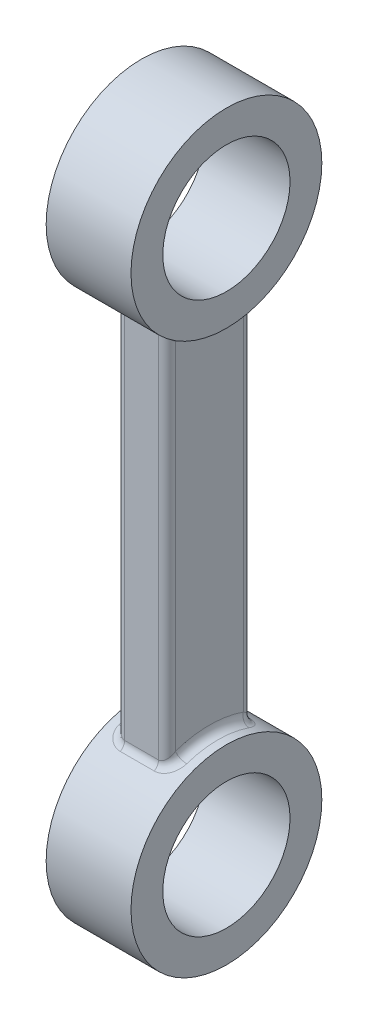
ISO-10303-21;
HEADER;
FILE_DESCRIPTION(('STEP AP214'),'2;1');
FILE_NAME('part.step','',(''),(''),'','','');
FILE_SCHEMA(('AUTOMOTIVE_DESIGN { 1 0 10303 214 1 1 1 1 }'));
ENDSEC;
DATA;
#1=APPLICATION_CONTEXT('core data for automotive mechanical design processes');
#2=APPLICATION_PROTOCOL_DEFINITION('international standard','automotive_design',2000,#1);
#3=PRODUCT_CONTEXT('',#1,'mechanical');
#4=PRODUCT('Part','Part','',(#3));
#5=PRODUCT_RELATED_PRODUCT_CATEGORY('part','',(#4));
#6=PRODUCT_DEFINITION_FORMATION('','',#4);
#7=PRODUCT_DEFINITION_CONTEXT('part definition',#1,'design');
#8=PRODUCT_DEFINITION('design','',#6,#7);
#9=PRODUCT_DEFINITION_SHAPE('','',#8);
#10=(LENGTH_UNIT() NAMED_UNIT(*) SI_UNIT(.MILLI.,.METRE.));
#11=(NAMED_UNIT(*) PLANE_ANGLE_UNIT() SI_UNIT($,.RADIAN.));
#12=(NAMED_UNIT(*) SI_UNIT($,.STERADIAN.) SOLID_ANGLE_UNIT());
#13=UNCERTAINTY_MEASURE_WITH_UNIT(LENGTH_MEASURE(1.E-05),#10,'distance_accuracy_value','');
#14=(GEOMETRIC_REPRESENTATION_CONTEXT(3) GLOBAL_UNCERTAINTY_ASSIGNED_CONTEXT((#13)) GLOBAL_UNIT_ASSIGNED_CONTEXT((#10,
#11,#12)) REPRESENTATION_CONTEXT('',''));
#15=CARTESIAN_POINT('',(0.,0.,0.));
#16=DIRECTION('',(0.,0.,1.));
#17=DIRECTION('',(1.,0.,0.));
#18=AXIS2_PLACEMENT_3D('',#15,#16,#17);
#19=CARTESIAN_POINT('',(10.,130.,0.));
#20=DIRECTION('',(-1.,0.,0.));
#21=DIRECTION('',(0.,0.,1.));
#22=AXIS2_PLACEMENT_3D('',#19,#20,#21);
#23=CYLINDRICAL_SURFACE('',#22,22.5);
#24=CARTESIAN_POINT('',(-10.,130.,0.));
#25=DIRECTION('',(1.,0.,0.));
#26=DIRECTION('',(0.,0.,-1.));
#27=AXIS2_PLACEMENT_3D('',#24,#25,#26);
#28=CIRCLE('',#27,22.5);
#29=CARTESIAN_POINT('',(-10.,130.,-22.5));
#30=VERTEX_POINT('',#29);
#31=EDGE_CURVE('E287',#30,#30,#28,.T.);
#32=ORIENTED_EDGE('',*,*,#31,.T.);
#33=EDGE_LOOP('',(#32));
#34=FACE_BOUND('',#33,.T.);
#35=CARTESIAN_POINT('',(10.,130.,0.));
#36=DIRECTION('',(1.,0.,0.));
#37=DIRECTION('',(0.,0.,-1.));
#38=AXIS2_PLACEMENT_3D('',#35,#36,#37);
#39=CIRCLE('',#38,22.5);
#40=CARTESIAN_POINT('',(10.,130.,-22.5));
#41=VERTEX_POINT('',#40);
#42=EDGE_CURVE('E283',#41,#41,#39,.T.);
#43=ORIENTED_EDGE('',*,*,#42,.F.);
#44=EDGE_LOOP('',(#43));
#45=FACE_BOUND('',#44,.T.);
#46=CARTESIAN_POINT('',(-7.75741700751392,108.339047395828,6.08712840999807));
#47=CARTESIAN_POINT('',(-5.68657375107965,108.535959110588,6.78783571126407));
#48=CARTESIAN_POINT('',(-5.87870850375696,106.413629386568,7.31410324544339));
#49=CARTESIAN_POINT('',(-7.79797244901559,108.36770976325,6.18913992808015));
#50=CARTESIAN_POINT('',(-5.71824628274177,108.550385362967,6.82651757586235));
#51=CARTESIAN_POINT('',(-5.8989862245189,106.444839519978,7.36964284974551));
#52=CARTESIAN_POINT('',(-7.83345868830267,108.397526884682,6.29245624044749));
#53=CARTESIAN_POINT('',(-5.74900577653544,108.565241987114,6.86716779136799));
#54=CARTESIAN_POINT('',(-5.91672934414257,106.477307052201,7.42589284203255));
#55=CARTESIAN_POINT('',(-7.89424220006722,108.459339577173,6.50090252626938));
#56=CARTESIAN_POINT('',(-5.80791303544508,108.595929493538,6.95246833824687));
#57=CARTESIAN_POINT('',(-5.94712109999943,106.544614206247,7.53938026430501));
#58=CARTESIAN_POINT('',(-7.9195435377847,108.491334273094,6.60603175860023));
#59=CARTESIAN_POINT('',(-5.8360546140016,108.611739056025,6.99704939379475));
#60=CARTESIAN_POINT('',(-5.95977176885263,106.579452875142,7.59661729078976));
#61=CARTESIAN_POINT('',(-7.98000616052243,108.590210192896,6.92238577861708));
#62=CARTESIAN_POINT('',(-5.91527034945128,108.660581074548,7.13621962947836));
#63=CARTESIAN_POINT('',(-5.99000308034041,106.687117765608,7.76885447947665));
#64=CARTESIAN_POINT('',(-7.99998883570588,108.66017037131,7.13524701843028));
#65=CARTESIAN_POINT('',(-5.96201618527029,108.695378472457,7.23717982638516));
#66=CARTESIAN_POINT('',(-5.99999441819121,106.763296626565,7.88474559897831));
#67=CARTESIAN_POINT('',(-8.00001169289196,108.809893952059,7.56865354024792));
#68=CARTESIAN_POINT('',(-6.03902347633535,108.772261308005,7.45970195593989));
#69=CARTESIAN_POINT('',(-6.0000058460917,106.926328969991,8.12071137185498));
#70=CARTESIAN_POINT('',(-7.97811591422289,108.88996467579,7.78908545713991));
#71=CARTESIAN_POINT('',(-6.06870841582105,108.814429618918,7.58149010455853));
#72=CARTESIAN_POINT('',(-5.98905795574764,107.013517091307,8.24072430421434));
#73=CARTESIAN_POINT('',(-7.8923853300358,109.054530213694,8.22136394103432));
#74=CARTESIAN_POINT('',(-6.10204975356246,108.90504417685,7.83769075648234));
#75=CARTESIAN_POINT('',(-5.94619266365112,107.192710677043,8.47607592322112));
#76=CARTESIAN_POINT('',(-7.82852575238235,109.139027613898,8.43320535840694));
#77=CARTESIAN_POINT('',(-6.10620718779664,108.953290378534,7.9716415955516));
#78=CARTESIAN_POINT('',(-5.91426287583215,107.284718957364,8.5914118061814));
#79=CARTESIAN_POINT('',(-7.66126211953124,109.309165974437,8.84242441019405));
#80=CARTESIAN_POINT('',(-6.08407941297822,109.054761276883,8.24502947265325));
#81=CARTESIAN_POINT('',(-5.8306310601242,107.469980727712,8.81420884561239));
#82=CARTESIAN_POINT('',(-7.55790671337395,109.394805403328,9.03981948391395));
#83=CARTESIAN_POINT('',(-6.05848098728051,109.107848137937,8.38427247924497));
#84=CARTESIAN_POINT('',(-5.778953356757,107.563232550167,8.92167949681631));
#85=CARTESIAN_POINT('',(-7.31410512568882,109.563734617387,9.41549310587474));
#86=CARTESIAN_POINT('',(-5.97465917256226,109.216488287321,8.66032035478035));
#87=CARTESIAN_POINT('',(-5.65705256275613,107.747177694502,9.12621291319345));
#88=CARTESIAN_POINT('',(-7.1736477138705,109.647023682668,9.59376584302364));
#89=CARTESIAN_POINT('',(-5.91706533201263,109.272027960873,8.79726603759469));
#90=CARTESIAN_POINT('',(-5.58682385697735,107.837870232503,9.22327251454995));
#91=CARTESIAN_POINT('',(-6.85688932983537,109.807772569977,9.92766997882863));
#92=CARTESIAN_POINT('',(-5.76847141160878,109.382270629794,9.06123478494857));
#93=CARTESIAN_POINT('',(-5.42844466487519,108.012907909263,9.40506476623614));
#94=CARTESIAN_POINT('',(-6.68026740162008,109.885171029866,10.0830755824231));
#95=CARTESIAN_POINT('',(-5.67764815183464,109.437093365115,9.18862211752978));
#96=CARTESIAN_POINT('',(-5.34013370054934,108.097186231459,9.4896744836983));
#97=CARTESIAN_POINT('',(-6.2957058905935,110.028255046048,10.3636011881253));
#98=CARTESIAN_POINT('',(-5.46497421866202,109.540424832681,9.42290782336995));
#99=CARTESIAN_POINT('',(-5.14785294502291,108.25298882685,9.64240509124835));
#100=CARTESIAN_POINT('',(-6.08779113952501,110.093949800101,10.4887450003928));
#101=CARTESIAN_POINT('',(-5.34334979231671,109.589185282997,9.53048129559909));
#102=CARTESIAN_POINT('',(-5.04389556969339,108.324523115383,9.71053894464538));
#103=CARTESIAN_POINT('',(-5.66224467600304,110.204003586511,10.6949175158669));
#104=CARTESIAN_POINT('',(-5.08394554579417,109.671779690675,9.70952707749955));
#105=CARTESIAN_POINT('',(-4.83112233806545,108.444359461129,9.82278842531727));
#106=CARTESIAN_POINT('',(-5.44651606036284,110.249594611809,10.7785538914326));
#107=CARTESIAN_POINT('',(-4.94802033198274,109.706682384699,9.78362568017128));
#108=CARTESIAN_POINT('',(-4.72325803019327,108.494003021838,9.86832378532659));
#109=CARTESIAN_POINT('',(-5.11128957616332,110.303997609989,10.8774476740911));
#110=CARTESIAN_POINT('',(-4.73221485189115,109.748561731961,9.87168518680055));
#111=CARTESIAN_POINT('',(-4.55564478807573,108.553241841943,9.92216595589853));
#112=CARTESIAN_POINT('',(-4.99759048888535,110.319802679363,10.9059877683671));
#113=CARTESIAN_POINT('',(-4.65840677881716,109.760779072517,9.89719942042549));
#114=CARTESIAN_POINT('',(-4.49879524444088,108.570451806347,9.93770445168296));
#115=CARTESIAN_POINT('',(-4.76725149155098,110.346386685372,10.9538233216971));
#116=CARTESIAN_POINT('',(-4.50791328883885,109.781362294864,9.94002916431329));
#117=CARTESIAN_POINT('',(-4.38362574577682,108.599398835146,9.96374825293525));
#118=CARTESIAN_POINT('',(-4.65061338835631,110.357168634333,10.9731243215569));
#119=CARTESIAN_POINT('',(-4.43115678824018,109.789752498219,9.95739591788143));
#120=CARTESIAN_POINT('',(-4.32530669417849,108.611139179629,9.97425657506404));
#121=CARTESIAN_POINT('',(-4.4301869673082,110.372403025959,11.0003474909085));
#122=CARTESIAN_POINT('',(-4.28556827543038,109.801611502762,9.98189745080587));
#123=CARTESIAN_POINT('',(-4.21509348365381,108.627727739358,9.98907807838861));
#124=CARTESIAN_POINT('',(-4.3266103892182,110.377477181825,11.0093886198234));
#125=CARTESIAN_POINT('',(-4.21689461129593,109.805572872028,9.99005747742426));
#126=CARTESIAN_POINT('',(-4.16330519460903,108.63325293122,9.99400047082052));
#127=CARTESIAN_POINT('',(-4.11886417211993,110.38345062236,11.0200283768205));
#128=CARTESIAN_POINT('',(-4.07901340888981,109.81023365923,9.9996548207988));
#129=CARTESIAN_POINT('',(-4.05943208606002,108.639757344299,9.99979322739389));
#130=CARTESIAN_POINT('',(-4.01469458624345,110.384350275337,11.0216276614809));
#131=CARTESIAN_POINT('',(-4.00974511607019,109.810937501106,10.0011012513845));
#132=CARTESIAN_POINT('',(-4.00734729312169,108.640736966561,10.0006639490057));
#133=CARTESIAN_POINT('',(-3.80619424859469,110.381944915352,11.0173470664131));
#134=CARTESIAN_POINT('',(-3.87124528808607,109.809058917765,9.99723639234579));
#135=CARTESIAN_POINT('',(-3.90309712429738,108.638117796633,9.99833340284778));
#136=CARTESIAN_POINT('',(-3.70186443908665,110.378623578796,11.0114381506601));
#137=CARTESIAN_POINT('',(-3.80195280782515,109.806462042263,9.99189538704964));
#138=CARTESIAN_POINT('',(-3.85093221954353,108.634501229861,9.99511632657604));
#139=CARTESIAN_POINT('',(-3.49425473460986,110.367838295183,10.9921921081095));
#140=CARTESIAN_POINT('',(-3.66448226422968,109.798060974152,9.9745633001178));
#141=CARTESIAN_POINT('',(-3.74712736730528,108.622757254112,9.9846379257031));
#142=CARTESIAN_POINT('',(-3.39097505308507,110.360373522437,10.9788535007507));
#143=CARTESIAN_POINT('',(-3.59624493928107,109.79224874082,9.96255558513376));
#144=CARTESIAN_POINT('',(-3.69548752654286,108.614628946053,9.97737579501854));
#145=CARTESIAN_POINT('',(-3.28864427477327,110.350882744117,10.9618516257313));
#146=CARTESIAN_POINT('',(-3.52906017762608,109.784878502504,9.94728911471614));
#147=CARTESIAN_POINT('',(-3.64432213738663,108.604294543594,9.96811921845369));
#148=(BOUNDED_SURFACE() B_SPLINE_SURFACE(3,2,((#46,#47,#48),(#49,#50,#51),(#52,#53,#54),(#55,
#56,#57),(#58,#59,#60),(#61,#62,#63),(#64,#65,#66),(#67,#68,#69),(#70,#71,#72),(#73,#74,#75),
(#76,#77,#78),(#79,#80,#81),(#82,#83,#84),(#85,#86,#87),(#88,#89,#90),(#91,#92,#93),(#94,#95,
#96),(#97,#98,#99),(#100,#101,#102),(#103,#104,#105),(#106,#107,#108),(#109,#110,#111),(#112,
#113,#114),(#115,#116,#117),(#118,#119,#120),(#121,#122,#123),(#124,#125,#126),(#127,#128,#129),
(#130,#131,#132),(#133,#134,#135),(#136,#137,#138),(#139,#140,#141),(#142,#143,#144),(#145,#146,
#147)),.UNSPECIFIED.,.F.,.F.,.F.) B_SPLINE_SURFACE_WITH_KNOTS((4,2,2,2,2,2,2,2,2,2,2,2,2,2,2,2,
4),(3,3),(0.,0.366651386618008,0.733156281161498,1.4637926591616,2.22902260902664,
2.99470469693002,3.75944667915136,4.52442040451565,5.296502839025,6.0679758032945,
6.78149773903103,7.13836620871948,7.49502039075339,7.80719156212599,8.11933519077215,
8.43268963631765,8.74610654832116),(0.,1.),
.UNSPECIFIED.) GEOMETRIC_REPRESENTATION_ITEM() RATIONAL_B_SPLINE_SURFACE(((1.,0.673505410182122,
1.),(1.,0.675715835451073,1.),(1.,0.678086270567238,1.),(1.,0.683132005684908,1.),(1.,
0.685807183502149,1.),(1.,0.694251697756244,1.),(1.,0.700454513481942,1.),(1.,0.714074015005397,
1.),(1.,0.721534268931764,1.),(1.,0.737065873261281,1.),(1.,0.745137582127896,1.),(1.,
0.76145158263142,1.),(1.,0.769693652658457,1.),(1.,0.785921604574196,1.),(1.,0.793907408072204,
1.),(1.,0.809245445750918,1.),(1.,0.816591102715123,1.),(1.,0.830091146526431,1.),(1.,
0.836246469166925,1.),(1.,0.846505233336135,1.),(1.,0.850728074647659,1.),(1.,0.855751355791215,
1.),(1.,0.857207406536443,1.),(1.,0.859653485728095,1.),(1.,0.860643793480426,1.),(1.,
0.862042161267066,1.),(1.,0.862507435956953,1.),(1.,0.863055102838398,1.),(1.,0.863137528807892,
1.),(1.,0.86291706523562,1.),(1.,0.862612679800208,1.),(1.,0.861623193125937,1.),(1.,
0.86093801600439,1.),(1.,0.860066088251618,1.))) REPRESENTATION_ITEM('') SURFACE());
#149=CARTESIAN_POINT('',(-3.28864427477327,110.350882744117,10.9618516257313));
#150=CARTESIAN_POINT('',(-3.39097505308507,110.360373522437,10.9788535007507));
#151=CARTESIAN_POINT('',(-3.49425473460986,110.367838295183,10.9921921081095));
#152=CARTESIAN_POINT('',(-3.70186443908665,110.378623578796,11.0114381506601));
#153=CARTESIAN_POINT('',(-3.80619424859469,110.381944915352,11.0173470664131));
#154=CARTESIAN_POINT('',(-4.01469458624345,110.384350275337,11.0216276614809));
#155=CARTESIAN_POINT('',(-4.11886417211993,110.38345062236,11.0200283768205));
#156=CARTESIAN_POINT('',(-4.3266103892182,110.377477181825,11.0093886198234));
#157=CARTESIAN_POINT('',(-4.43018696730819,110.372403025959,11.0003474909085));
#158=CARTESIAN_POINT('',(-4.65061338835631,110.357168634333,10.9731243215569));
#159=CARTESIAN_POINT('',(-4.76725149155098,110.346386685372,10.9538233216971));
#160=CARTESIAN_POINT('',(-4.99759048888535,110.319802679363,10.9059877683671));
#161=CARTESIAN_POINT('',(-5.11128957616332,110.303997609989,10.8774476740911));
#162=CARTESIAN_POINT('',(-5.44651606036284,110.249594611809,10.7785538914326));
#163=CARTESIAN_POINT('',(-5.66224467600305,110.204003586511,10.6949175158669));
#164=CARTESIAN_POINT('',(-6.08779113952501,110.093949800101,10.4887450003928));
#165=CARTESIAN_POINT('',(-6.2957058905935,110.028255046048,10.3636011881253));
#166=CARTESIAN_POINT('',(-6.68026740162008,109.885171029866,10.0830755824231));
#167=CARTESIAN_POINT('',(-6.85688932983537,109.807772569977,9.92766997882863));
#168=CARTESIAN_POINT('',(-7.1736477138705,109.647023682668,9.59376584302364));
#169=CARTESIAN_POINT('',(-7.31410512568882,109.563734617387,9.41549310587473));
#170=CARTESIAN_POINT('',(-7.55790671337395,109.394805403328,9.03981948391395));
#171=CARTESIAN_POINT('',(-7.66126211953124,109.309165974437,8.84242441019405));
#172=CARTESIAN_POINT('',(-7.82852575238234,109.139027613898,8.43320535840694));
#173=CARTESIAN_POINT('',(-7.8923853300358,109.054530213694,8.22136394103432));
#174=CARTESIAN_POINT('',(-7.97811591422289,108.88996467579,7.78908545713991));
#175=CARTESIAN_POINT('',(-8.00001169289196,108.809893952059,7.56865354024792));
#176=CARTESIAN_POINT('',(-7.99998883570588,108.66017037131,7.13524701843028));
#177=CARTESIAN_POINT('',(-7.98000616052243,108.590210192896,6.92238577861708));
#178=CARTESIAN_POINT('',(-7.9195435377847,108.491334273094,6.60603175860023));
#179=CARTESIAN_POINT('',(-7.89424220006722,108.459339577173,6.50090252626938));
#180=CARTESIAN_POINT('',(-7.83345868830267,108.397526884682,6.29245624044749));
#181=CARTESIAN_POINT('',(-7.79797244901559,108.36770976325,6.18913992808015));
#182=CARTESIAN_POINT('',(-7.75741700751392,108.339047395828,6.08712840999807));
#183=B_SPLINE_CURVE_WITH_KNOTS('',3,(#149,#150,#151,#152,#153,#154,#155,#156,#157,#158,#159,
#160,#161,#162,#163,#164,#165,#166,#167,#168,#169,#170,#171,#172,#173,#174,#175,#176,#177,#178,
#179,#180,#181,#182),.UNSPECIFIED.,.F.,.F.,(4,2,2,2,2,2,2,2,2,2,2,2,2,2,2,2,4),(0.,
0.313416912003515,0.626771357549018,0.938914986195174,1.25108615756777,1.60774033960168,
1.96460880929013,2.67813074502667,3.44960370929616,4.22168614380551,4.9866598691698,
5.75140185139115,6.51708393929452,7.28231388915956,8.01295026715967,8.37945516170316,
8.74610654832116),.UNSPECIFIED.);
#184=CARTESIAN_POINT('',(-4.,110.383664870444,11.0204081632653));
#185=VERTEX_POINT('',#184);
#186=CARTESIAN_POINT('',(-8.,108.733300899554,7.3469387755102));
#187=VERTEX_POINT('',#186);
#188=EDGE_CURVE('E485',#185,#187,#183,.T.);
#189=ORIENTED_EDGE('',*,*,#188,.F.);
#190=DIRECTION('',(-1.,0.,0.));
#191=VECTOR('',#190,1.);
#192=CARTESIAN_POINT('',(10.,110.383664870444,11.0204081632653));
#193=LINE('',#192,#191);
#194=CARTESIAN_POINT('',(4.,110.383664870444,11.0204081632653));
#195=VERTEX_POINT('',#194);
#196=EDGE_CURVE('E487',#185,#195,#193,.F.);
#197=ORIENTED_EDGE('',*,*,#196,.T.);
#198=CARTESIAN_POINT('',(2.82405501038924,110.293346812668,10.8580762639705));
#199=CARTESIAN_POINT('',(3.22642981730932,109.740409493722,9.85453348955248));
#200=CARTESIAN_POINT('',(3.41202750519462,108.541644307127,9.91161929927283));
#201=CARTESIAN_POINT('',(2.91837895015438,110.308037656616,10.8847325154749));
#202=CARTESIAN_POINT('',(3.2870959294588,109.751696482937,9.87822223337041));
#203=CARTESIAN_POINT('',(3.45918947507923,108.557641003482,9.92613214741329));
#204=CARTESIAN_POINT('',(3.01407526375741,110.321058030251,10.9082419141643));
#205=CARTESIAN_POINT('',(3.34926293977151,109.761757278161,9.89923053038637));
#206=CARTESIAN_POINT('',(3.50703763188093,108.571818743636,9.93893170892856));
#207=CARTESIAN_POINT('',(3.20758344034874,110.343566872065,10.9487538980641));
#208=CARTESIAN_POINT('',(3.47566052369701,109.779181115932,9.93549469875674));
#209=CARTESIAN_POINT('',(3.60379172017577,108.596328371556,9.96098823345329));
#210=CARTESIAN_POINT('',(3.30539561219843,110.353054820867,10.9657555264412));
#211=CARTESIAN_POINT('',(3.53993465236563,109.78655690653,9.95077741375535));
#212=CARTESIAN_POINT('',(3.65269780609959,108.60665969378,9.97024467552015));
#213=CARTESIAN_POINT('',(3.50231723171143,110.368290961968,10.9930086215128));
#214=CARTESIAN_POINT('',(3.66978697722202,109.798407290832,9.97528588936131));
#215=CARTESIAN_POINT('',(3.75115861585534,108.623250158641,9.9850824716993));
#216=CARTESIAN_POINT('',(3.60142429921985,110.37404523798,11.0032710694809));
#217=CARTESIAN_POINT('',(3.73541196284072,109.802895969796,9.98454096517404));
#218=CARTESIAN_POINT('',(3.80071214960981,108.629515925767,9.9906698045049));
#219=CARTESIAN_POINT('',(3.800335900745,110.38173485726,11.0169742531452));
#220=CARTESIAN_POINT('',(3.86731999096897,109.808894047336,9.99689813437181));
#221=CARTESIAN_POINT('',(3.90016795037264,108.637889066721,9.99813042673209));
#222=CARTESIAN_POINT('',(3.90014038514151,110.383670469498,11.0204154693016));
#223=CARTESIAN_POINT('',(3.93365599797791,109.810408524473,10.0000107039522));
#224=CARTESIAN_POINT('',(3.95007019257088,108.639996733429,10.0000039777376));
#225=CARTESIAN_POINT('',(4.20579733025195,110.383653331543,11.0203931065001));
#226=CARTESIAN_POINT('',(4.13672635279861,109.810388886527,9.99997794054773));
#227=CARTESIAN_POINT('',(4.10289866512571,108.639978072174,9.99999180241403));
#228=CARTESIAN_POINT('',(4.41182880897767,110.375397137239,11.0057315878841));
#229=CARTESIAN_POINT('',(4.27384236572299,109.803911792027,9.9866818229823));
#230=CARTESIAN_POINT('',(4.20591440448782,108.630987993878,9.9920094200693));
#231=CARTESIAN_POINT('',(4.81733474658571,110.343050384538,10.9478475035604));
#232=CARTESIAN_POINT('',(4.54110282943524,109.778764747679,9.93464941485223));
#233=CARTESIAN_POINT('',(4.40866737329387,108.595765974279,9.9604947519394));
#234=CARTESIAN_POINT('',(5.01681037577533,110.31896266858,10.9046300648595));
#235=CARTESIAN_POINT('',(4.67167918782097,109.760011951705,9.89574101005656));
#236=CARTESIAN_POINT('',(4.50840518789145,108.569537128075,9.93696525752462));
#237=CARTESIAN_POINT('',(5.40326930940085,110.256955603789,10.7919544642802));
#238=CARTESIAN_POINT('',(4.92018659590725,109.712362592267,9.79558851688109));
#239=CARTESIAN_POINT('',(4.70163465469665,108.50201832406,9.87561965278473));
#240=CARTESIAN_POINT('',(5.59029138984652,110.219081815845,10.7225827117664));
#241=CARTESIAN_POINT('',(5.0384584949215,109.683357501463,9.73411283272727));
#242=CARTESIAN_POINT('',(4.7951456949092,108.460777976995,9.83785058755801));
#243=CARTESIAN_POINT('',(5.94846166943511,110.132006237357,10.5603630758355));
#244=CARTESIAN_POINT('',(5.25895920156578,109.617740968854,9.59267015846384));
#245=CARTESIAN_POINT('',(4.97423083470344,108.365962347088,9.74953100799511));
#246=CARTESIAN_POINT('',(6.1196006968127,110.082797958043,10.4675017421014));
#247=CARTESIAN_POINT('',(5.36130941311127,109.580966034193,9.51232919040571));
#248=CARTESIAN_POINT('',(5.05980034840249,108.312379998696,9.69897317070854));
#249=CARTESIAN_POINT('',(6.4529526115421,109.972487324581,10.2549453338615));
#250=CARTESIAN_POINT('',(5.55315434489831,109.500088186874,9.33203126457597));
#251=CARTESIAN_POINT('',(5.22647630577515,108.19226397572,9.58324801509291));
#252=CARTESIAN_POINT('',(6.61396277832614,109.910838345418,10.1339478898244));
#253=CARTESIAN_POINT('',(5.64134924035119,109.45553994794,9.23082597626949));
#254=CARTESIAN_POINT('',(5.30698138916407,108.125135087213,9.51737162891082));
#255=CARTESIAN_POINT('',(6.91215178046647,109.781000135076,9.87235399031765));
#256=CARTESIAN_POINT('',(5.79503374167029,109.363991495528,9.01775810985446));
#257=CARTESIAN_POINT('',(5.45607589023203,107.983755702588,9.37494828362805));
#258=CARTESIAN_POINT('',(7.04932371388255,109.712809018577,9.73175187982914));
#259=CARTESIAN_POINT('',(5.86029697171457,109.316875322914,8.90554793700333));
#260=CARTESIAN_POINT('',(5.52466185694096,107.909503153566,9.29839824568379));
#261=CARTESIAN_POINT('',(7.312322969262,109.564607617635,9.41691783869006));
#262=CARTESIAN_POINT('',(5.9739310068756,109.217237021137,8.66208345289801));
#263=CARTESIAN_POINT('',(5.65616148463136,107.748128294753,9.12698860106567));
#264=CARTESIAN_POINT('',(7.43500270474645,109.484142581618,9.24067713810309));
#265=CARTESIAN_POINT('',(6.01889654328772,109.164767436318,8.53011099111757));
#266=CARTESIAN_POINT('',(5.71750135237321,107.660510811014,9.03103533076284));
#267=CARTESIAN_POINT('',(7.64603727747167,109.322059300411,8.87205309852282));
#268=CARTESIAN_POINT('',(6.08078460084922,109.062755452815,8.26620662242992));
#269=CARTESIAN_POINT('',(5.8230186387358,107.484020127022,8.83034002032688));
#270=CARTESIAN_POINT('',(7.73437557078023,109.240440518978,8.67966203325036));
#271=CARTESIAN_POINT('',(6.09712302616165,109.013260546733,8.13423835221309));
#272=CARTESIAN_POINT('',(5.86718778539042,107.395146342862,8.72559377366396));
#273=CARTESIAN_POINT('',(7.87879666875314,109.074207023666,8.27119498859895));
#274=CARTESIAN_POINT('',(6.10434540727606,108.916045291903,7.86870559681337));
#275=CARTESIAN_POINT('',(5.93939833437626,107.214136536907,8.50320616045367));
#276=CARTESIAN_POINT('',(7.93260667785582,108.989709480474,8.05439029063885));
#277=CARTESIAN_POINT('',(6.09299543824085,108.868831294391,7.73596531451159));
#278=CARTESIAN_POINT('',(5.96630333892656,107.122128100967,8.38516804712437));
#279=CARTESIAN_POINT('',(7.99678618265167,108.825946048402,7.61344560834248));
#280=CARTESIAN_POINT('',(6.04612560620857,108.780449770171,7.48377017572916));
#281=CARTESIAN_POINT('',(5.99839309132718,106.943807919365,8.14509816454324));
#282=CARTESIAN_POINT('',(8.00718148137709,108.746677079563,7.38931006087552));
#283=CARTESIAN_POINT('',(6.01014448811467,108.739498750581,7.36484961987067));
#284=CARTESIAN_POINT('',(6.00359074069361,106.857492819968,8.02306881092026));
#285=CARTESIAN_POINT('',(7.98917077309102,108.634414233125,7.05516442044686));
#286=CARTESIAN_POINT('',(5.94337771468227,108.682919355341,7.20108991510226));
#287=CARTESIAN_POINT('',(5.99458538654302,106.735251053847,7.84114507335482));
#288=CARTESIAN_POINT('',(7.97783602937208,108.598421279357,6.9451929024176));
#289=CARTESIAN_POINT('',(5.91908681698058,108.66492556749,7.14910760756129));
#290=CARTESIAN_POINT('',(5.98891801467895,106.696058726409,7.78127169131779));
#291=CARTESIAN_POINT('',(7.94427439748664,108.528516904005,6.72596544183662));
#292=CARTESIAN_POINT('',(5.86682746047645,108.630143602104,7.04935413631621));
#293=CARTESIAN_POINT('',(5.97213719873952,106.619940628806,7.66191451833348));
#294=CARTESIAN_POINT('',(7.92204848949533,108.494605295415,6.61670943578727));
#295=CARTESIAN_POINT('',(5.83884928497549,108.613380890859,7.00166259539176));
#296=CARTESIAN_POINT('',(5.96102424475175,106.583014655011,7.60243069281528));
#297=CARTESIAN_POINT('',(7.86659258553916,108.42897895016,6.39952680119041));
#298=CARTESIAN_POINT('',(5.77983006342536,108.580861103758,6.91036354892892));
#299=CARTESIAN_POINT('',(5.93329629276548,106.511554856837,7.48418681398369));
#300=CARTESIAN_POINT('',(7.83332935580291,108.397271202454,6.29160522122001));
#301=CARTESIAN_POINT('',(5.7487849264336,108.565131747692,6.86684789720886));
#302=CARTESIAN_POINT('',(5.9166646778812,106.477028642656,7.4254295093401));
#303=CARTESIAN_POINT('',(7.75591256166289,108.336295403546,6.07834794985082));
#304=CARTESIAN_POINT('',(5.68424276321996,108.534574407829,6.78383772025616));
#305=CARTESIAN_POINT('',(5.87795628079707,106.410632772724,7.30932277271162));
#306=CARTESIAN_POINT('',(7.71175440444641,108.307028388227,5.97301336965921));
#307=CARTESIAN_POINT('',(5.65075989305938,108.519768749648,6.74441575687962));
#308=CARTESIAN_POINT('',(5.85587720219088,106.378764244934,7.25197394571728));
#309=CARTESIAN_POINT('',(7.66221094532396,108.279059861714,5.86947693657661));
#310=CARTESIAN_POINT('',(5.61646675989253,108.505378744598,6.7070062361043));
#311=CARTESIAN_POINT('',(5.83110547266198,106.3483096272,7.19560410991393));
#312=(BOUNDED_SURFACE() B_SPLINE_SURFACE(3,2,((#198,#199,#200),(#201,#202,#203),(#204,#205,
#206),(#207,#208,#209),(#210,#211,#212),(#213,#214,#215),(#216,#217,#218),(#219,#220,#221),
(#222,#223,#224),(#225,#226,#227),(#228,#229,#230),(#231,#232,#233),(#234,#235,#236),(#237,#238,
#239),(#240,#241,#242),(#243,#244,#245),(#246,#247,#248),(#249,#250,#251),(#252,#253,#254),
(#255,#256,#257),(#258,#259,#260),(#261,#262,#263),(#264,#265,#266),(#267,#268,#269),(#270,#271,
#272),(#273,#274,#275),(#276,#277,#278),(#279,#280,#281),(#282,#283,#284),(#285,#286,#287),
(#288,#289,#290),(#291,#292,#293),(#294,#295,#296),(#297,#298,#299),(#300,#301,#302),(#303,#304,
#305),(#306,#307,#308),(#309,#310,#311)),.UNSPECIFIED.,.F.,.F.,
.F.) B_SPLINE_SURFACE_WITH_KNOTS((4,2,2,2,2,2,2,2,2,2,2,2,2,2,2,2,2,2,4),(3,3),(0.,
0.29985895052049,0.599761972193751,0.899175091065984,1.19856711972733,1.81557410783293,
2.43247034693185,3.0473460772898,3.66257469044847,4.31577253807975,4.96915919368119,
5.69812394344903,6.42743943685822,7.20084451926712,7.9737898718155,8.35290542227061,
8.73198685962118,9.11222024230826,9.49261418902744),(0.,1.),
.UNSPECIFIED.) GEOMETRIC_REPRESENTATION_ITEM() RATIONAL_B_SPLINE_SURFACE(((1.,0.854767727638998,
1.),(1.,0.856123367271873,1.),(1.,0.857322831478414,1.),(1.,0.859394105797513,1.),(1.,
0.860265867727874,1.),(1.,0.861664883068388,1.),(1.,0.862192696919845,1.),(1.,0.862897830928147,
1.),(1.,0.863075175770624,1.),(1.,0.863073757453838,1.),(1.,0.86231762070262,1.),(1.,
0.85934699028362,1.),(1.,0.857132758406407,1.),(1.,0.851408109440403,1.),(1.,0.847901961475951,
1.),(1.,0.839798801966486,1.),(1.,0.835201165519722,1.),(1.,0.82483779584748,1.),(1.,
0.819017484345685,1.),(1.,0.806694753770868,1.),(1.,0.800192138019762,1.),(1.,0.786008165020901,
1.),(1.,0.778277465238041,1.),(1.,0.762698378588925,1.),(1.,0.754849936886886,1.),(1.,
0.738948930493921,1.),(1.,0.730912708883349,1.),(1.,0.715570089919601,1.),(1.,0.708263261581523,
1.),(1.,0.698200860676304,1.),(1.,0.695023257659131,1.),(1.,0.688963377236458,1.),(1.,
0.686081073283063,1.),(1.,0.68063111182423,1.),(1.,0.678064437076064,1.),(1.,0.673268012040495,
1.),(1.,0.671038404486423,1.),(1.,0.668984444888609,1.))) REPRESENTATION_ITEM('') SURFACE());
#313=CARTESIAN_POINT('',(7.66221094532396,108.279059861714,5.86947693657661));
#314=CARTESIAN_POINT('',(7.71175440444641,108.307028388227,5.97301336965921));
#315=CARTESIAN_POINT('',(7.75591256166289,108.336295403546,6.07834794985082));
#316=CARTESIAN_POINT('',(7.83332935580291,108.397271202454,6.29160522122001));
#317=CARTESIAN_POINT('',(7.86659258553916,108.42897895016,6.39952680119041));
#318=CARTESIAN_POINT('',(7.92204848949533,108.494605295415,6.61670943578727));
#319=CARTESIAN_POINT('',(7.94427439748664,108.528516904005,6.72596544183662));
#320=CARTESIAN_POINT('',(7.97783602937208,108.598421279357,6.9451929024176));
#321=CARTESIAN_POINT('',(7.98917077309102,108.634414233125,7.05516442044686));
#322=CARTESIAN_POINT('',(8.00718148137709,108.746677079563,7.38931006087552));
#323=CARTESIAN_POINT('',(7.99678618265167,108.825946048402,7.61344560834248));
#324=CARTESIAN_POINT('',(7.93260667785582,108.989709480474,8.05439029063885));
#325=CARTESIAN_POINT('',(7.87879666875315,109.074207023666,8.27119498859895));
#326=CARTESIAN_POINT('',(7.73437557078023,109.240440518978,8.67966203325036));
#327=CARTESIAN_POINT('',(7.64603727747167,109.322059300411,8.87205309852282));
#328=CARTESIAN_POINT('',(7.43500270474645,109.484142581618,9.24067713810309));
#329=CARTESIAN_POINT('',(7.312322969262,109.564607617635,9.41691783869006));
#330=CARTESIAN_POINT('',(7.04932371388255,109.712809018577,9.73175187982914));
#331=CARTESIAN_POINT('',(6.91215178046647,109.781000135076,9.87235399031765));
#332=CARTESIAN_POINT('',(6.61396277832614,109.910838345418,10.1339478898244));
#333=CARTESIAN_POINT('',(6.4529526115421,109.972487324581,10.2549453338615));
#334=CARTESIAN_POINT('',(6.1196006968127,110.082797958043,10.4675017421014));
#335=CARTESIAN_POINT('',(5.94846166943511,110.132006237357,10.5603630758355));
#336=CARTESIAN_POINT('',(5.59029138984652,110.219081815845,10.7225827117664));
#337=CARTESIAN_POINT('',(5.40326930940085,110.256955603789,10.7919544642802));
#338=CARTESIAN_POINT('',(5.01681037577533,110.31896266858,10.9046300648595));
#339=CARTESIAN_POINT('',(4.81733474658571,110.343050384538,10.9478475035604));
#340=CARTESIAN_POINT('',(4.41182880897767,110.375397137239,11.0057315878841));
#341=CARTESIAN_POINT('',(4.20579733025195,110.383653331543,11.0203931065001));
#342=CARTESIAN_POINT('',(3.90014038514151,110.383670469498,11.0204154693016));
#343=CARTESIAN_POINT('',(3.800335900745,110.38173485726,11.0169742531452));
#344=CARTESIAN_POINT('',(3.60142429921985,110.37404523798,11.0032710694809));
#345=CARTESIAN_POINT('',(3.50231723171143,110.368290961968,10.9930086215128));
#346=CARTESIAN_POINT('',(3.30539561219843,110.353054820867,10.9657555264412));
#347=CARTESIAN_POINT('',(3.20758344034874,110.343566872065,10.9487538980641));
#348=CARTESIAN_POINT('',(3.01407526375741,110.321058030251,10.9082419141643));
#349=CARTESIAN_POINT('',(2.91837895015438,110.308037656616,10.8847325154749));
#350=CARTESIAN_POINT('',(2.82405501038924,110.293346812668,10.8580762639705));
#351=B_SPLINE_CURVE_WITH_KNOTS('',3,(#313,#314,#315,#316,#317,#318,#319,#320,#321,#322,#323,
#324,#325,#326,#327,#328,#329,#330,#331,#332,#333,#334,#335,#336,#337,#338,#339,#340,#341,#342,
#343,#344,#345,#346,#347,#348,#349,#350),.UNSPECIFIED.,.F.,.F.,(4,2,2,2,2,2,2,2,2,2,2,2,2,2,2,2,
2,2,4),(0.,0.380393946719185,0.760627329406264,1.13970876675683,1.51882431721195,
2.29176966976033,3.06517475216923,3.79449024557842,4.52345499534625,5.17684165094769,
5.83003949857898,6.44526811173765,7.06014384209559,7.67704008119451,8.29404706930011,
8.59343909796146,8.89285221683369,9.19275523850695,9.49261418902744),.UNSPECIFIED.);
#352=CARTESIAN_POINT('',(8.,108.733300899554,7.3469387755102));
#353=VERTEX_POINT('',#352);
#354=EDGE_CURVE('E501',#353,#195,#351,.T.);
#355=ORIENTED_EDGE('',*,*,#354,.F.);
#356=CARTESIAN_POINT('',(8.,130.,0.));
#357=DIRECTION('',(1.,0.,0.));
#358=DIRECTION('',(0.,0.,-1.));
#359=AXIS2_PLACEMENT_3D('',#356,#357,#358);
#360=CIRCLE('',#359,22.5);
#361=CARTESIAN_POINT('',(8.,108.733300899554,-7.3469387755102));
#362=VERTEX_POINT('',#361);
#363=EDGE_CURVE('E599',#353,#362,#360,.T.);
#364=ORIENTED_EDGE('',*,*,#363,.T.);
#365=CARTESIAN_POINT('',(7.75741700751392,108.339047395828,-6.08712840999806));
#366=CARTESIAN_POINT('',(5.68657375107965,108.535959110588,-6.78783571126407));
#367=CARTESIAN_POINT('',(5.87870850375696,106.413629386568,-7.31410324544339));
#368=CARTESIAN_POINT('',(7.79797244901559,108.36770976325,-6.18913992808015));
#369=CARTESIAN_POINT('',(5.71824628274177,108.550385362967,-6.82651757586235));
#370=CARTESIAN_POINT('',(5.8989862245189,106.444839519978,-7.36964284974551));
#371=CARTESIAN_POINT('',(7.83345868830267,108.397526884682,-6.29245624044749));
#372=CARTESIAN_POINT('',(5.74900577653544,108.565241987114,-6.86716779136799));
#373=CARTESIAN_POINT('',(5.91672934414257,106.477307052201,-7.42589284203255));
#374=CARTESIAN_POINT('',(7.89424220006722,108.459339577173,-6.50090252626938));
#375=CARTESIAN_POINT('',(5.80791303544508,108.595929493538,-6.95246833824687));
#376=CARTESIAN_POINT('',(5.94712109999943,106.544614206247,-7.53938026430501));
#377=CARTESIAN_POINT('',(7.9195435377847,108.491334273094,-6.60603175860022));
#378=CARTESIAN_POINT('',(5.8360546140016,108.611739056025,-6.99704939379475));
#379=CARTESIAN_POINT('',(5.95977176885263,106.579452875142,-7.59661729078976));
#380=CARTESIAN_POINT('',(7.98000616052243,108.590210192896,-6.92238577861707));
#381=CARTESIAN_POINT('',(5.91527034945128,108.660581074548,-7.13621962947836));
#382=CARTESIAN_POINT('',(5.99000308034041,106.687117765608,-7.76885447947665));
#383=CARTESIAN_POINT('',(7.99998883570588,108.66017037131,-7.13524701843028));
#384=CARTESIAN_POINT('',(5.96201618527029,108.695378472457,-7.23717982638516));
#385=CARTESIAN_POINT('',(5.99999441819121,106.763296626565,-7.88474559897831));
#386=CARTESIAN_POINT('',(8.00001169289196,108.809893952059,-7.56865354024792));
#387=CARTESIAN_POINT('',(6.03902347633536,108.772261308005,-7.45970195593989));
#388=CARTESIAN_POINT('',(6.0000058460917,106.926328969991,-8.12071137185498));
#389=CARTESIAN_POINT('',(7.97811591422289,108.88996467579,-7.78908545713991));
#390=CARTESIAN_POINT('',(6.06870841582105,108.814429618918,-7.58149010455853));
#391=CARTESIAN_POINT('',(5.98905795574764,107.013517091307,-8.24072430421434));
#392=CARTESIAN_POINT('',(7.8923853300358,109.054530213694,-8.22136394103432));
#393=CARTESIAN_POINT('',(6.10204975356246,108.90504417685,-7.83769075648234));
#394=CARTESIAN_POINT('',(5.94619266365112,107.192710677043,-8.47607592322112));
#395=CARTESIAN_POINT('',(7.82852575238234,109.139027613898,-8.43320535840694));
#396=CARTESIAN_POINT('',(6.10620718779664,108.953290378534,-7.9716415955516));
#397=CARTESIAN_POINT('',(5.91426287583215,107.284718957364,-8.5914118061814));
#398=CARTESIAN_POINT('',(7.66126211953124,109.309165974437,-8.84242441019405));
#399=CARTESIAN_POINT('',(6.08407941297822,109.054761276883,-8.24502947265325));
#400=CARTESIAN_POINT('',(5.8306310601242,107.469980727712,-8.81420884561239));
#401=CARTESIAN_POINT('',(7.55790671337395,109.394805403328,-9.03981948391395));
#402=CARTESIAN_POINT('',(6.05848098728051,109.107848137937,-8.38427247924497));
#403=CARTESIAN_POINT('',(5.77895335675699,107.563232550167,-8.92167949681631));
#404=CARTESIAN_POINT('',(7.31410512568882,109.563734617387,-9.41549310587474));
#405=CARTESIAN_POINT('',(5.97465917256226,109.216488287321,-8.66032035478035));
#406=CARTESIAN_POINT('',(5.65705256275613,107.747177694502,-9.12621291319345));
#407=CARTESIAN_POINT('',(7.1736477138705,109.647023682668,-9.59376584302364));
#408=CARTESIAN_POINT('',(5.91706533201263,109.272027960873,-8.79726603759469));
#409=CARTESIAN_POINT('',(5.58682385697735,107.837870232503,-9.22327251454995));
#410=CARTESIAN_POINT('',(6.85688932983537,109.807772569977,-9.92766997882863));
#411=CARTESIAN_POINT('',(5.76847141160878,109.382270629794,-9.06123478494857));
#412=CARTESIAN_POINT('',(5.42844466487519,108.012907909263,-9.40506476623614));
#413=CARTESIAN_POINT('',(6.68026740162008,109.885171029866,-10.0830755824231));
#414=CARTESIAN_POINT('',(5.67764815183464,109.437093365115,-9.18862211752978));
#415=CARTESIAN_POINT('',(5.34013370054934,108.097186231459,-9.4896744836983));
#416=CARTESIAN_POINT('',(6.2957058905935,110.028255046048,-10.3636011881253));
#417=CARTESIAN_POINT('',(5.46497421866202,109.540424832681,-9.42290782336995));
#418=CARTESIAN_POINT('',(5.14785294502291,108.25298882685,-9.64240509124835));
#419=CARTESIAN_POINT('',(6.08779113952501,110.093949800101,-10.4887450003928));
#420=CARTESIAN_POINT('',(5.34334979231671,109.589185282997,-9.53048129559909));
#421=CARTESIAN_POINT('',(5.04389556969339,108.324523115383,-9.71053894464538));
#422=CARTESIAN_POINT('',(5.66224467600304,110.204003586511,-10.6949175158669));
#423=CARTESIAN_POINT('',(5.08394554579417,109.671779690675,-9.70952707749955));
#424=CARTESIAN_POINT('',(4.83112233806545,108.444359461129,-9.82278842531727));
#425=CARTESIAN_POINT('',(5.44651606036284,110.249594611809,-10.7785538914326));
#426=CARTESIAN_POINT('',(4.94802033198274,109.706682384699,-9.78362568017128));
#427=CARTESIAN_POINT('',(4.72325803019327,108.494003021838,-9.86832378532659));
#428=CARTESIAN_POINT('',(5.11128957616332,110.303997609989,-10.8774476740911));
#429=CARTESIAN_POINT('',(4.73221485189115,109.748561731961,-9.87168518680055));
#430=CARTESIAN_POINT('',(4.55564478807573,108.553241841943,-9.92216595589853));
#431=CARTESIAN_POINT('',(4.99759048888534,110.319802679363,-10.9059877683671));
#432=CARTESIAN_POINT('',(4.65840677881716,109.760779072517,-9.89719942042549));
#433=CARTESIAN_POINT('',(4.49879524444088,108.570451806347,-9.93770445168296));
#434=CARTESIAN_POINT('',(4.76725149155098,110.346386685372,-10.9538233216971));
#435=CARTESIAN_POINT('',(4.50791328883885,109.781362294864,-9.94002916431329));
#436=CARTESIAN_POINT('',(4.38362574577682,108.599398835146,-9.96374825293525));
#437=CARTESIAN_POINT('',(4.65061338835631,110.357168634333,-10.9731243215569));
#438=CARTESIAN_POINT('',(4.43115678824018,109.789752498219,-9.95739591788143));
#439=CARTESIAN_POINT('',(4.32530669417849,108.611139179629,-9.97425657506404));
#440=CARTESIAN_POINT('',(4.4301869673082,110.372403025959,-11.0003474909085));
#441=CARTESIAN_POINT('',(4.28556827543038,109.801611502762,-9.98189745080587));
#442=CARTESIAN_POINT('',(4.21509348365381,108.627727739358,-9.98907807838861));
#443=CARTESIAN_POINT('',(4.3266103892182,110.377477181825,-11.0093886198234));
#444=CARTESIAN_POINT('',(4.21689461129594,109.805572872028,-9.99005747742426));
#445=CARTESIAN_POINT('',(4.16330519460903,108.63325293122,-9.99400047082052));
#446=CARTESIAN_POINT('',(4.11886417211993,110.38345062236,-11.0200283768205));
#447=CARTESIAN_POINT('',(4.07901340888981,109.81023365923,-9.9996548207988));
#448=CARTESIAN_POINT('',(4.05943208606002,108.639757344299,-9.99979322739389));
#449=CARTESIAN_POINT('',(4.01469458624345,110.384350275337,-11.0216276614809));
#450=CARTESIAN_POINT('',(4.00974511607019,109.810937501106,-10.0011012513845));
#451=CARTESIAN_POINT('',(4.00734729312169,108.640736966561,-10.0006639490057));
#452=CARTESIAN_POINT('',(3.80619424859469,110.381944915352,-11.0173470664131));
#453=CARTESIAN_POINT('',(3.87124528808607,109.809058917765,-9.99723639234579));
#454=CARTESIAN_POINT('',(3.90309712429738,108.638117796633,-9.99833340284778));
#455=CARTESIAN_POINT('',(3.70186443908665,110.378623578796,-11.0114381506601));
#456=CARTESIAN_POINT('',(3.80195280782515,109.806462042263,-9.99189538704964));
#457=CARTESIAN_POINT('',(3.85093221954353,108.634501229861,-9.99511632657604));
#458=CARTESIAN_POINT('',(3.49425473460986,110.367838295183,-10.9921921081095));
#459=CARTESIAN_POINT('',(3.66448226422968,109.798060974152,-9.9745633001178));
#460=CARTESIAN_POINT('',(3.74712736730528,108.622757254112,-9.9846379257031));
#461=CARTESIAN_POINT('',(3.39097505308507,110.360373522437,-10.9788535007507));
#462=CARTESIAN_POINT('',(3.59624493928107,109.79224874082,-9.96255558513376));
#463=CARTESIAN_POINT('',(3.69548752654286,108.614628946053,-9.97737579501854));
#464=CARTESIAN_POINT('',(3.28864427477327,110.350882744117,-10.9618516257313));
#465=CARTESIAN_POINT('',(3.52906017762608,109.784878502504,-9.94728911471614));
#466=CARTESIAN_POINT('',(3.64432213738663,108.604294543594,-9.96811921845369));
#467=(BOUNDED_SURFACE() B_SPLINE_SURFACE(3,2,((#365,#366,#367),(#368,#369,#370),(#371,#372,
#373),(#374,#375,#376),(#377,#378,#379),(#380,#381,#382),(#383,#384,#385),(#386,#387,#388),
(#389,#390,#391),(#392,#393,#394),(#395,#396,#397),(#398,#399,#400),(#401,#402,#403),(#404,#405,
#406),(#407,#408,#409),(#410,#411,#412),(#413,#414,#415),(#416,#417,#418),(#419,#420,#421),
(#422,#423,#424),(#425,#426,#427),(#428,#429,#430),(#431,#432,#433),(#434,#435,#436),(#437,#438,
#439),(#440,#441,#442),(#443,#444,#445),(#446,#447,#448),(#449,#450,#451),(#452,#453,#454),
(#455,#456,#457),(#458,#459,#460),(#461,#462,#463),(#464,#465,#466)),.UNSPECIFIED.,.F.,.F.,
.F.) B_SPLINE_SURFACE_WITH_KNOTS((4,2,2,2,2,2,2,2,2,2,2,2,2,2,2,2,4),(3,3),(0.,
0.366651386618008,0.733156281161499,1.46379265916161,2.22902260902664,2.99470469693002,
3.75944667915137,4.52442040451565,5.296502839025,6.0679758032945,6.78149773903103,
7.13836620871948,7.49502039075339,7.80719156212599,8.11933519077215,8.43268963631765,
8.74610654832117),(0.,1.),
.UNSPECIFIED.) GEOMETRIC_REPRESENTATION_ITEM() RATIONAL_B_SPLINE_SURFACE(((1.,0.673505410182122,
1.),(1.,0.675715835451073,1.),(1.,0.678086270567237,1.),(1.,0.683132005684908,1.),(1.,
0.685807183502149,1.),(1.,0.694251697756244,1.),(1.,0.700454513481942,1.),(1.,0.714074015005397,
1.),(1.,0.721534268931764,1.),(1.,0.737065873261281,1.),(1.,0.745137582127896,1.),(1.,
0.76145158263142,1.),(1.,0.769693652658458,1.),(1.,0.785921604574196,1.),(1.,0.793907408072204,
1.),(1.,0.809245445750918,1.),(1.,0.816591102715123,1.),(1.,0.830091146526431,1.),(1.,
0.836246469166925,1.),(1.,0.846505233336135,1.),(1.,0.850728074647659,1.),(1.,0.855751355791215,
1.),(1.,0.857207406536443,1.),(1.,0.859653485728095,1.),(1.,0.860643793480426,1.),(1.,
0.862042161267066,1.),(1.,0.862507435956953,1.),(1.,0.863055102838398,1.),(1.,0.863137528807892,
1.),(1.,0.86291706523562,1.),(1.,0.862612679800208,1.),(1.,0.861623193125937,1.),(1.,
0.86093801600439,1.),(1.,0.860066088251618,1.))) REPRESENTATION_ITEM('') SURFACE());
#468=CARTESIAN_POINT('',(3.28864427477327,110.350882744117,-10.9618516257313));
#469=CARTESIAN_POINT('',(3.39097505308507,110.360373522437,-10.9788535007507));
#470=CARTESIAN_POINT('',(3.49425473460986,110.367838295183,-10.9921921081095));
#471=CARTESIAN_POINT('',(3.70186443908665,110.378623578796,-11.0114381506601));
#472=CARTESIAN_POINT('',(3.80619424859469,110.381944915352,-11.0173470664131));
#473=CARTESIAN_POINT('',(4.01469458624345,110.384350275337,-11.0216276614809));
#474=CARTESIAN_POINT('',(4.11886417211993,110.38345062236,-11.0200283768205));
#475=CARTESIAN_POINT('',(4.3266103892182,110.377477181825,-11.0093886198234));
#476=CARTESIAN_POINT('',(4.43018696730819,110.372403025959,-11.0003474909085));
#477=CARTESIAN_POINT('',(4.65061338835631,110.357168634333,-10.9731243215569));
#478=CARTESIAN_POINT('',(4.76725149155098,110.346386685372,-10.9538233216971));
#479=CARTESIAN_POINT('',(4.99759048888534,110.319802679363,-10.9059877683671));
#480=CARTESIAN_POINT('',(5.11128957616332,110.303997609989,-10.8774476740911));
#481=CARTESIAN_POINT('',(5.44651606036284,110.249594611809,-10.7785538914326));
#482=CARTESIAN_POINT('',(5.66224467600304,110.204003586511,-10.6949175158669));
#483=CARTESIAN_POINT('',(6.08779113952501,110.093949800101,-10.4887450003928));
#484=CARTESIAN_POINT('',(6.2957058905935,110.028255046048,-10.3636011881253));
#485=CARTESIAN_POINT('',(6.68026740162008,109.885171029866,-10.0830755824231));
#486=CARTESIAN_POINT('',(6.85688932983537,109.807772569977,-9.92766997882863));
#487=CARTESIAN_POINT('',(7.1736477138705,109.647023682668,-9.59376584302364));
#488=CARTESIAN_POINT('',(7.31410512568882,109.563734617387,-9.41549310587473));
#489=CARTESIAN_POINT('',(7.55790671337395,109.394805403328,-9.03981948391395));
#490=CARTESIAN_POINT('',(7.66126211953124,109.309165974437,-8.84242441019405));
#491=CARTESIAN_POINT('',(7.82852575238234,109.139027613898,-8.43320535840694));
#492=CARTESIAN_POINT('',(7.8923853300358,109.054530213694,-8.22136394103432));
#493=CARTESIAN_POINT('',(7.97811591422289,108.88996467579,-7.78908545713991));
#494=CARTESIAN_POINT('',(8.00001169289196,108.809893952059,-7.56865354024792));
#495=CARTESIAN_POINT('',(7.99998883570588,108.66017037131,-7.13524701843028));
#496=CARTESIAN_POINT('',(7.98000616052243,108.590210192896,-6.92238577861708));
#497=CARTESIAN_POINT('',(7.9195435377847,108.491334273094,-6.60603175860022));
#498=CARTESIAN_POINT('',(7.89424220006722,108.459339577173,-6.50090252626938));
#499=CARTESIAN_POINT('',(7.83345868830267,108.397526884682,-6.29245624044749));
#500=CARTESIAN_POINT('',(7.79797244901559,108.36770976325,-6.18913992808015));
#501=CARTESIAN_POINT('',(7.75741700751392,108.339047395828,-6.08712840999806));
#502=B_SPLINE_CURVE_WITH_KNOTS('',3,(#468,#469,#470,#471,#472,#473,#474,#475,#476,#477,#478,
#479,#480,#481,#482,#483,#484,#485,#486,#487,#488,#489,#490,#491,#492,#493,#494,#495,#496,#497,
#498,#499,#500,#501),.UNSPECIFIED.,.F.,.F.,(4,2,2,2,2,2,2,2,2,2,2,2,2,2,2,2,4),(0.,
0.313416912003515,0.626771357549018,0.938914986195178,1.25108615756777,1.60774033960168,
1.96460880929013,2.67813074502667,3.44960370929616,4.22168614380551,4.9866598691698,
5.75140185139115,6.51708393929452,7.28231388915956,8.01295026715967,8.37945516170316,
8.74610654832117),.UNSPECIFIED.);
#503=CARTESIAN_POINT('',(4.,110.383664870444,-11.0204081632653));
#504=VERTEX_POINT('',#503);
#505=EDGE_CURVE('E604',#504,#362,#502,.T.);
#506=ORIENTED_EDGE('',*,*,#505,.F.);
#507=DIRECTION('',(-1.,0.,0.));
#508=VECTOR('',#507,1.);
#509=CARTESIAN_POINT('',(10.,110.383664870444,-11.0204081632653));
#510=LINE('',#509,#508);
#511=CARTESIAN_POINT('',(-4.,110.383664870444,-11.0204081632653));
#512=VERTEX_POINT('',#511);
#513=EDGE_CURVE('E516',#504,#512,#510,.T.);
#514=ORIENTED_EDGE('',*,*,#513,.T.);
#515=CARTESIAN_POINT('',(-2.82405501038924,110.293346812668,-10.8580762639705));
#516=CARTESIAN_POINT('',(-3.22642981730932,109.740409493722,-9.85453348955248));
#517=CARTESIAN_POINT('',(-3.41202750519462,108.541644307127,-9.91161929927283));
#518=CARTESIAN_POINT('',(-2.91837895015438,110.308037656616,-10.8847325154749));
#519=CARTESIAN_POINT('',(-3.28709592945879,109.751696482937,-9.87822223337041));
#520=CARTESIAN_POINT('',(-3.45918947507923,108.557641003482,-9.92613214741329));
#521=CARTESIAN_POINT('',(-3.01407526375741,110.321058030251,-10.9082419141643));
#522=CARTESIAN_POINT('',(-3.34926293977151,109.761757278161,-9.89923053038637));
#523=CARTESIAN_POINT('',(-3.50703763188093,108.571818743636,-9.93893170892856));
#524=CARTESIAN_POINT('',(-3.20758344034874,110.343566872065,-10.9487538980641));
#525=CARTESIAN_POINT('',(-3.47566052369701,109.779181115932,-9.93549469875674));
#526=CARTESIAN_POINT('',(-3.60379172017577,108.596328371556,-9.96098823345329));
#527=CARTESIAN_POINT('',(-3.30539561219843,110.353054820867,-10.9657555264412));
#528=CARTESIAN_POINT('',(-3.53993465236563,109.78655690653,-9.95077741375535));
#529=CARTESIAN_POINT('',(-3.65269780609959,108.60665969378,-9.97024467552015));
#530=CARTESIAN_POINT('',(-3.50231723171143,110.368290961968,-10.9930086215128));
#531=CARTESIAN_POINT('',(-3.66978697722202,109.798407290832,-9.97528588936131));
#532=CARTESIAN_POINT('',(-3.75115861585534,108.623250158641,-9.9850824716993));
#533=CARTESIAN_POINT('',(-3.60142429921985,110.37404523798,-11.0032710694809));
#534=CARTESIAN_POINT('',(-3.73541196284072,109.802895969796,-9.98454096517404));
#535=CARTESIAN_POINT('',(-3.80071214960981,108.629515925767,-9.9906698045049));
#536=CARTESIAN_POINT('',(-3.800335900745,110.38173485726,-11.0169742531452));
#537=CARTESIAN_POINT('',(-3.86731999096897,109.808894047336,-9.99689813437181));
#538=CARTESIAN_POINT('',(-3.90016795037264,108.637889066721,-9.99813042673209));
#539=CARTESIAN_POINT('',(-3.90014038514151,110.383670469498,-11.0204154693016));
#540=CARTESIAN_POINT('',(-3.93365599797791,109.810408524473,-10.0000107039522));
#541=CARTESIAN_POINT('',(-3.95007019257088,108.639996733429,-10.0000039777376));
#542=CARTESIAN_POINT('',(-4.20579733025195,110.383653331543,-11.0203931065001));
#543=CARTESIAN_POINT('',(-4.13672635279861,109.810388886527,-9.99997794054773));
#544=CARTESIAN_POINT('',(-4.10289866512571,108.639978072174,-9.99999180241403));
#545=CARTESIAN_POINT('',(-4.41182880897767,110.375397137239,-11.0057315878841));
#546=CARTESIAN_POINT('',(-4.27384236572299,109.803911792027,-9.98668182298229));
#547=CARTESIAN_POINT('',(-4.20591440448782,108.630987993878,-9.9920094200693));
#548=CARTESIAN_POINT('',(-4.81733474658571,110.343050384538,-10.9478475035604));
#549=CARTESIAN_POINT('',(-4.54110282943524,109.778764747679,-9.93464941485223));
#550=CARTESIAN_POINT('',(-4.40866737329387,108.595765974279,-9.9604947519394));
#551=CARTESIAN_POINT('',(-5.01681037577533,110.31896266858,-10.9046300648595));
#552=CARTESIAN_POINT('',(-4.67167918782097,109.760011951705,-9.89574101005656));
#553=CARTESIAN_POINT('',(-4.50840518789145,108.569537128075,-9.93696525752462));
#554=CARTESIAN_POINT('',(-5.40326930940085,110.256955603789,-10.7919544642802));
#555=CARTESIAN_POINT('',(-4.92018659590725,109.712362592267,-9.79558851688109));
#556=CARTESIAN_POINT('',(-4.70163465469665,108.50201832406,-9.87561965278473));
#557=CARTESIAN_POINT('',(-5.59029138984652,110.219081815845,-10.7225827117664));
#558=CARTESIAN_POINT('',(-5.0384584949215,109.683357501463,-9.73411283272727));
#559=CARTESIAN_POINT('',(-4.7951456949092,108.460777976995,-9.83785058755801));
#560=CARTESIAN_POINT('',(-5.94846166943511,110.132006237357,-10.5603630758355));
#561=CARTESIAN_POINT('',(-5.25895920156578,109.617740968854,-9.59267015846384));
#562=CARTESIAN_POINT('',(-4.97423083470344,108.365962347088,-9.74953100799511));
#563=CARTESIAN_POINT('',(-6.1196006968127,110.082797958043,-10.4675017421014));
#564=CARTESIAN_POINT('',(-5.36130941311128,109.580966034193,-9.51232919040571));
#565=CARTESIAN_POINT('',(-5.05980034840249,108.312379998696,-9.69897317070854));
#566=CARTESIAN_POINT('',(-6.4529526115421,109.972487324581,-10.2549453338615));
#567=CARTESIAN_POINT('',(-5.55315434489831,109.500088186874,-9.33203126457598));
#568=CARTESIAN_POINT('',(-5.22647630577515,108.19226397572,-9.58324801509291));
#569=CARTESIAN_POINT('',(-6.61396277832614,109.910838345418,-10.1339478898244));
#570=CARTESIAN_POINT('',(-5.64134924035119,109.45553994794,-9.23082597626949));
#571=CARTESIAN_POINT('',(-5.30698138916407,108.125135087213,-9.51737162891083));
#572=CARTESIAN_POINT('',(-6.91215178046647,109.781000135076,-9.87235399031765));
#573=CARTESIAN_POINT('',(-5.79503374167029,109.363991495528,-9.01775810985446));
#574=CARTESIAN_POINT('',(-5.45607589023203,107.983755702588,-9.37494828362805));
#575=CARTESIAN_POINT('',(-7.04932371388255,109.712809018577,-9.73175187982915));
#576=CARTESIAN_POINT('',(-5.86029697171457,109.316875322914,-8.90554793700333));
#577=CARTESIAN_POINT('',(-5.52466185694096,107.909503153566,-9.29839824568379));
#578=CARTESIAN_POINT('',(-7.312322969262,109.564607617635,-9.41691783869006));
#579=CARTESIAN_POINT('',(-5.9739310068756,109.217237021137,-8.66208345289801));
#580=CARTESIAN_POINT('',(-5.65616148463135,107.748128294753,-9.12698860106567));
#581=CARTESIAN_POINT('',(-7.43500270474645,109.484142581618,-9.2406771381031));
#582=CARTESIAN_POINT('',(-6.01889654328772,109.164767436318,-8.53011099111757));
#583=CARTESIAN_POINT('',(-5.71750135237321,107.660510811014,-9.03103533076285));
#584=CARTESIAN_POINT('',(-7.64603727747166,109.322059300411,-8.87205309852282));
#585=CARTESIAN_POINT('',(-6.08078460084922,109.062755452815,-8.26620662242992));
#586=CARTESIAN_POINT('',(-5.8230186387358,107.484020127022,-8.83034002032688));
#587=CARTESIAN_POINT('',(-7.73437557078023,109.240440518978,-8.67966203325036));
#588=CARTESIAN_POINT('',(-6.09712302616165,109.013260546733,-8.1342383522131));
#589=CARTESIAN_POINT('',(-5.86718778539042,107.395146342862,-8.72559377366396));
#590=CARTESIAN_POINT('',(-7.87879666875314,109.074207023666,-8.27119498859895));
#591=CARTESIAN_POINT('',(-6.10434540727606,108.916045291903,-7.86870559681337));
#592=CARTESIAN_POINT('',(-5.93939833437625,107.214136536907,-8.50320616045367));
#593=CARTESIAN_POINT('',(-7.93260667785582,108.989709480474,-8.05439029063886));
#594=CARTESIAN_POINT('',(-6.09299543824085,108.868831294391,-7.73596531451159));
#595=CARTESIAN_POINT('',(-5.96630333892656,107.122128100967,-8.38516804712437));
#596=CARTESIAN_POINT('',(-7.99678618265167,108.825946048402,-7.61344560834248));
#597=CARTESIAN_POINT('',(-6.04612560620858,108.780449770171,-7.48377017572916));
#598=CARTESIAN_POINT('',(-5.99839309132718,106.943807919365,-8.14509816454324));
#599=CARTESIAN_POINT('',(-8.00718148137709,108.746677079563,-7.38931006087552));
#600=CARTESIAN_POINT('',(-6.01014448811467,108.739498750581,-7.36484961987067));
#601=CARTESIAN_POINT('',(-6.00359074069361,106.857492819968,-8.02306881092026));
#602=CARTESIAN_POINT('',(-7.98917077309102,108.634414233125,-7.05516442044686));
#603=CARTESIAN_POINT('',(-5.94337771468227,108.682919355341,-7.20108991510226));
#604=CARTESIAN_POINT('',(-5.99458538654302,106.735251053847,-7.84114507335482));
#605=CARTESIAN_POINT('',(-7.97783602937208,108.598421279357,-6.94519290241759));
#606=CARTESIAN_POINT('',(-5.91908681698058,108.66492556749,-7.14910760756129));
#607=CARTESIAN_POINT('',(-5.98891801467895,106.696058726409,-7.78127169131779));
#608=CARTESIAN_POINT('',(-7.94427439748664,108.528516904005,-6.72596544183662));
#609=CARTESIAN_POINT('',(-5.86682746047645,108.630143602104,-7.04935413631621));
#610=CARTESIAN_POINT('',(-5.97213719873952,106.619940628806,-7.66191451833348));
#611=CARTESIAN_POINT('',(-7.92204848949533,108.494605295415,-6.61670943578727));
#612=CARTESIAN_POINT('',(-5.83884928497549,108.613380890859,-7.00166259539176));
#613=CARTESIAN_POINT('',(-5.96102424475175,106.583014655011,-7.60243069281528));
#614=CARTESIAN_POINT('',(-7.86659258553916,108.42897895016,-6.39952680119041));
#615=CARTESIAN_POINT('',(-5.77983006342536,108.580861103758,-6.91036354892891));
#616=CARTESIAN_POINT('',(-5.93329629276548,106.511554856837,-7.48418681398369));
#617=CARTESIAN_POINT('',(-7.83332935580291,108.397271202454,-6.29160522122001));
#618=CARTESIAN_POINT('',(-5.7487849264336,108.565131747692,-6.86684789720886));
#619=CARTESIAN_POINT('',(-5.9166646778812,106.477028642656,-7.4254295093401));
#620=CARTESIAN_POINT('',(-7.75591256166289,108.336295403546,-6.07834794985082));
#621=CARTESIAN_POINT('',(-5.68424276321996,108.534574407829,-6.78383772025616));
#622=CARTESIAN_POINT('',(-5.87795628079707,106.410632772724,-7.30932277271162));
#623=CARTESIAN_POINT('',(-7.71175440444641,108.307028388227,-5.97301336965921));
#624=CARTESIAN_POINT('',(-5.65075989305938,108.519768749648,-6.74441575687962));
#625=CARTESIAN_POINT('',(-5.85587720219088,106.378764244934,-7.25197394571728));
#626=CARTESIAN_POINT('',(-7.66221094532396,108.279059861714,-5.86947693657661));
#627=CARTESIAN_POINT('',(-5.61646675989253,108.505378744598,-6.7070062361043));
#628=CARTESIAN_POINT('',(-5.83110547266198,106.3483096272,-7.19560410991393));
#629=(BOUNDED_SURFACE() B_SPLINE_SURFACE(3,2,((#515,#516,#517),(#518,#519,#520),(#521,#522,
#523),(#524,#525,#526),(#527,#528,#529),(#530,#531,#532),(#533,#534,#535),(#536,#537,#538),
(#539,#540,#541),(#542,#543,#544),(#545,#546,#547),(#548,#549,#550),(#551,#552,#553),(#554,#555,
#556),(#557,#558,#559),(#560,#561,#562),(#563,#564,#565),(#566,#567,#568),(#569,#570,#571),
(#572,#573,#574),(#575,#576,#577),(#578,#579,#580),(#581,#582,#583),(#584,#585,#586),(#587,#588,
#589),(#590,#591,#592),(#593,#594,#595),(#596,#597,#598),(#599,#600,#601),(#602,#603,#604),
(#605,#606,#607),(#608,#609,#610),(#611,#612,#613),(#614,#615,#616),(#617,#618,#619),(#620,#621,
#622),(#623,#624,#625),(#626,#627,#628)),.UNSPECIFIED.,.F.,.F.,
.F.) B_SPLINE_SURFACE_WITH_KNOTS((4,2,2,2,2,2,2,2,2,2,2,2,2,2,2,2,2,2,4),(3,3),(0.,
0.299858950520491,0.599761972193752,0.899175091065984,1.19856711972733,1.81557410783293,
2.43247034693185,3.0473460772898,3.66257469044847,4.31577253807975,4.96915919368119,
5.69812394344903,6.42743943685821,7.20084451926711,7.9737898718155,8.35290542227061,
8.73198685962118,9.11222024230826,9.49261418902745),(0.,1.),
.UNSPECIFIED.) GEOMETRIC_REPRESENTATION_ITEM() RATIONAL_B_SPLINE_SURFACE(((1.,0.854767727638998,
1.),(1.,0.856123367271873,1.),(1.,0.857322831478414,1.),(1.,0.859394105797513,1.),(1.,
0.860265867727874,1.),(1.,0.861664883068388,1.),(1.,0.862192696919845,1.),(1.,0.862897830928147,
1.),(1.,0.863075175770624,1.),(1.,0.863073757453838,1.),(1.,0.86231762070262,1.),(1.,
0.85934699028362,1.),(1.,0.857132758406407,1.),(1.,0.851408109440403,1.),(1.,0.847901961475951,
1.),(1.,0.839798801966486,1.),(1.,0.835201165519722,1.),(1.,0.82483779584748,1.),(1.,
0.819017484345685,1.),(1.,0.806694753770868,1.),(1.,0.800192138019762,1.),(1.,0.786008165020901,
1.),(1.,0.778277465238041,1.),(1.,0.762698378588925,1.),(1.,0.754849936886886,1.),(1.,
0.738948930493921,1.),(1.,0.730912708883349,1.),(1.,0.715570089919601,1.),(1.,0.708263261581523,
1.),(1.,0.698200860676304,1.),(1.,0.695023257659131,1.),(1.,0.688963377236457,1.),(1.,
0.686081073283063,1.),(1.,0.68063111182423,1.),(1.,0.678064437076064,1.),(1.,0.673268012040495,
1.),(1.,0.671038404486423,1.),(1.,0.668984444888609,1.))) REPRESENTATION_ITEM('') SURFACE());
#630=CARTESIAN_POINT('',(-7.66221094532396,108.279059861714,-5.86947693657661));
#631=CARTESIAN_POINT('',(-7.71175440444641,108.307028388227,-5.97301336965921));
#632=CARTESIAN_POINT('',(-7.75591256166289,108.336295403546,-6.07834794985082));
#633=CARTESIAN_POINT('',(-7.83332935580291,108.397271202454,-6.29160522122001));
#634=CARTESIAN_POINT('',(-7.86659258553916,108.42897895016,-6.39952680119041));
#635=CARTESIAN_POINT('',(-7.92204848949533,108.494605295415,-6.61670943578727));
#636=CARTESIAN_POINT('',(-7.94427439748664,108.528516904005,-6.72596544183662));
#637=CARTESIAN_POINT('',(-7.97783602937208,108.598421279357,-6.94519290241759));
#638=CARTESIAN_POINT('',(-7.98917077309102,108.634414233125,-7.05516442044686));
#639=CARTESIAN_POINT('',(-8.00718148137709,108.746677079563,-7.38931006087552));
#640=CARTESIAN_POINT('',(-7.99678618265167,108.825946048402,-7.61344560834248));
#641=CARTESIAN_POINT('',(-7.93260667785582,108.989709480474,-8.05439029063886));
#642=CARTESIAN_POINT('',(-7.87879666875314,109.074207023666,-8.27119498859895));
#643=CARTESIAN_POINT('',(-7.73437557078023,109.240440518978,-8.67966203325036));
#644=CARTESIAN_POINT('',(-7.64603727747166,109.322059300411,-8.87205309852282));
#645=CARTESIAN_POINT('',(-7.43500270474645,109.484142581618,-9.2406771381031));
#646=CARTESIAN_POINT('',(-7.312322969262,109.564607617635,-9.41691783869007));
#647=CARTESIAN_POINT('',(-7.04932371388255,109.712809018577,-9.73175187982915));
#648=CARTESIAN_POINT('',(-6.91215178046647,109.781000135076,-9.87235399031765));
#649=CARTESIAN_POINT('',(-6.61396277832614,109.910838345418,-10.1339478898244));
#650=CARTESIAN_POINT('',(-6.4529526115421,109.972487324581,-10.2549453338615));
#651=CARTESIAN_POINT('',(-6.1196006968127,110.082797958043,-10.4675017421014));
#652=CARTESIAN_POINT('',(-5.94846166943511,110.132006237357,-10.5603630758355));
#653=CARTESIAN_POINT('',(-5.59029138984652,110.219081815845,-10.7225827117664));
#654=CARTESIAN_POINT('',(-5.40326930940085,110.256955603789,-10.7919544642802));
#655=CARTESIAN_POINT('',(-5.01681037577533,110.31896266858,-10.9046300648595));
#656=CARTESIAN_POINT('',(-4.81733474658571,110.343050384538,-10.9478475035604));
#657=CARTESIAN_POINT('',(-4.41182880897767,110.375397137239,-11.0057315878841));
#658=CARTESIAN_POINT('',(-4.20579733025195,110.383653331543,-11.0203931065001));
#659=CARTESIAN_POINT('',(-3.90014038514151,110.383670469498,-11.0204154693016));
#660=CARTESIAN_POINT('',(-3.800335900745,110.38173485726,-11.0169742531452));
#661=CARTESIAN_POINT('',(-3.60142429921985,110.37404523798,-11.0032710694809));
#662=CARTESIAN_POINT('',(-3.50231723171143,110.368290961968,-10.9930086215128));
#663=CARTESIAN_POINT('',(-3.30539561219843,110.353054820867,-10.9657555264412));
#664=CARTESIAN_POINT('',(-3.20758344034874,110.343566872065,-10.9487538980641));
#665=CARTESIAN_POINT('',(-3.01407526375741,110.321058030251,-10.9082419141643));
#666=CARTESIAN_POINT('',(-2.91837895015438,110.308037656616,-10.8847325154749));
#667=CARTESIAN_POINT('',(-2.82405501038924,110.293346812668,-10.8580762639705));
#668=B_SPLINE_CURVE_WITH_KNOTS('',3,(#630,#631,#632,#633,#634,#635,#636,#637,#638,#639,#640,
#641,#642,#643,#644,#645,#646,#647,#648,#649,#650,#651,#652,#653,#654,#655,#656,#657,#658,#659,
#660,#661,#662,#663,#664,#665,#666,#667),.UNSPECIFIED.,.F.,.F.,(4,2,2,2,2,2,2,2,2,2,2,2,2,2,2,2,
2,2,4),(0.,0.380393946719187,0.760627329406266,1.13970876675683,1.51882431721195,
2.29176966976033,3.06517475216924,3.79449024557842,4.52345499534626,5.1768416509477,
5.83003949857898,6.44526811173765,7.0601438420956,7.67704008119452,8.29404706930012,
8.59343909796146,8.8928522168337,9.19275523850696,9.49261418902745),.UNSPECIFIED.);
#669=CARTESIAN_POINT('',(-8.,108.733300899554,-7.3469387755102));
#670=VERTEX_POINT('',#669);
#671=EDGE_CURVE('E510',#670,#512,#668,.T.);
#672=ORIENTED_EDGE('',*,*,#671,.F.);
#673=CARTESIAN_POINT('',(-8.,130.,0.));
#674=DIRECTION('',(1.,0.,0.));
#675=DIRECTION('',(0.,0.,-1.));
#676=AXIS2_PLACEMENT_3D('',#673,#674,#675);
#677=CIRCLE('',#676,22.5);
#678=EDGE_CURVE('E489',#670,#187,#677,.F.);
#679=ORIENTED_EDGE('',*,*,#678,.T.);
#680=EDGE_LOOP('',(#189,#197,#355,#364,#506,#514,#672,#679));
#681=FACE_BOUND('',#680,.T.);
#682=ADVANCED_FACE('F47',(#34,#45,#681),#23,.T.);
#683=CARTESIAN_POINT('',(10.,0.,0.));
#684=DIRECTION('',(-1.,0.,0.));
#685=DIRECTION('',(0.,0.,1.));
#686=AXIS2_PLACEMENT_3D('',#683,#684,#685);
#687=CYLINDRICAL_SURFACE('',#686,22.5);
#688=CARTESIAN_POINT('',(-10.,0.,0.));
#689=DIRECTION('',(1.,0.,0.));
#690=DIRECTION('',(0.,0.,-1.));
#691=AXIS2_PLACEMENT_3D('',#688,#689,#690);
#692=CIRCLE('',#691,22.5);
#693=CARTESIAN_POINT('',(-10.,0.,-22.5));
#694=VERTEX_POINT('',#693);
#695=EDGE_CURVE('E272',#694,#694,#692,.T.);
#696=ORIENTED_EDGE('',*,*,#695,.T.);
#697=EDGE_LOOP('',(#696));
#698=FACE_BOUND('',#697,.T.);
#699=CARTESIAN_POINT('',(10.,0.,0.));
#700=DIRECTION('',(1.,0.,0.));
#701=DIRECTION('',(0.,0.,-1.));
#702=AXIS2_PLACEMENT_3D('',#699,#700,#701);
#703=CIRCLE('',#702,22.5);
#704=CARTESIAN_POINT('',(10.,0.,-22.5));
#705=VERTEX_POINT('',#704);
#706=EDGE_CURVE('E175',#705,#705,#703,.T.);
#707=ORIENTED_EDGE('',*,*,#706,.F.);
#708=EDGE_LOOP('',(#707));
#709=FACE_BOUND('',#708,.T.);
#710=CARTESIAN_POINT('',(7.75741700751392,21.6609526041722,6.08712840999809));
#711=CARTESIAN_POINT('',(5.68657375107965,21.4640408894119,6.78783571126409));
#712=CARTESIAN_POINT('',(5.87870850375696,23.5863706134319,7.31410324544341));
#713=CARTESIAN_POINT('',(7.79797244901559,21.6322902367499,6.18913992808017));
#714=CARTESIAN_POINT('',(5.71824628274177,21.4496146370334,6.82651757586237));
#715=CARTESIAN_POINT('',(5.8989862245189,23.5551604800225,7.36964284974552));
#716=CARTESIAN_POINT('',(7.83345868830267,21.6024731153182,6.29245624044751));
#717=CARTESIAN_POINT('',(5.74900577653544,21.4347580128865,6.86716779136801));
#718=CARTESIAN_POINT('',(5.91672934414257,23.5226929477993,7.42589284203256));
#719=CARTESIAN_POINT('',(7.89424220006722,21.5406604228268,6.5009025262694));
#720=CARTESIAN_POINT('',(5.80791303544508,21.404070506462,6.95246833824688));
#721=CARTESIAN_POINT('',(5.94712109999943,23.4553857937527,7.53938026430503));
#722=CARTESIAN_POINT('',(7.91954353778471,21.5086657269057,6.60603175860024));
#723=CARTESIAN_POINT('',(5.8360546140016,21.3882609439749,6.99704939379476));
#724=CARTESIAN_POINT('',(5.95977176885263,23.4205471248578,7.59661729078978));
#725=CARTESIAN_POINT('',(7.98000616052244,21.4097898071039,6.92238577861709));
#726=CARTESIAN_POINT('',(5.91527034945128,21.3394189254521,7.13621962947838));
#727=CARTESIAN_POINT('',(5.99000308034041,23.3128822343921,7.76885447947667));
#728=CARTESIAN_POINT('',(7.99998883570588,21.3398296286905,7.13524701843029));
#729=CARTESIAN_POINT('',(5.96201618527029,21.3046215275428,7.23717982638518));
#730=CARTESIAN_POINT('',(5.99999441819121,23.236703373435,7.88474559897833));
#731=CARTESIAN_POINT('',(8.00001169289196,21.1901060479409,7.56865354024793));
#732=CARTESIAN_POINT('',(6.03902347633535,21.2277386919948,7.4597019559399));
#733=CARTESIAN_POINT('',(6.0000058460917,23.0736710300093,8.12071137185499));
#734=CARTESIAN_POINT('',(7.97811591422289,21.1100353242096,7.78908545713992));
#735=CARTESIAN_POINT('',(6.06870841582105,21.1855703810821,7.58149010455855));
#736=CARTESIAN_POINT('',(5.98905795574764,22.9864829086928,8.24072430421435));
#737=CARTESIAN_POINT('',(7.8923853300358,20.9454697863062,8.22136394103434));
#738=CARTESIAN_POINT('',(6.10204975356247,21.09495582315,7.83769075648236));
#739=CARTESIAN_POINT('',(5.94619266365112,22.807289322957,8.47607592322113));
#740=CARTESIAN_POINT('',(7.82852575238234,20.8609723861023,8.43320535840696));
#741=CARTESIAN_POINT('',(6.10620718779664,21.0467096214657,7.97164159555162));
#742=CARTESIAN_POINT('',(5.91426287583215,22.7152810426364,8.59141180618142));
#743=CARTESIAN_POINT('',(7.66126211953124,20.690834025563,8.84242441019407));
#744=CARTESIAN_POINT('',(6.08407941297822,20.9452387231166,8.24502947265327));
#745=CARTESIAN_POINT('',(5.8306310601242,22.5300192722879,8.81420884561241));
#746=CARTESIAN_POINT('',(7.55790671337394,20.6051945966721,9.03981948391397));
#747=CARTESIAN_POINT('',(6.05848098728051,20.8921518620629,8.38427247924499));
#748=CARTESIAN_POINT('',(5.77895335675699,22.4367674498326,8.92167949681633));
#749=CARTESIAN_POINT('',(7.31410512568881,20.4362653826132,9.41549310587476));
#750=CARTESIAN_POINT('',(5.97465917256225,20.783511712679,8.66032035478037));
#751=CARTESIAN_POINT('',(5.65705256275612,22.2528223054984,9.12621291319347));
#752=CARTESIAN_POINT('',(7.17364771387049,20.3529763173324,9.59376584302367));
#753=CARTESIAN_POINT('',(5.91706533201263,20.7279720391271,8.79726603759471));
#754=CARTESIAN_POINT('',(5.58682385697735,22.1621297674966,9.22327251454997));
#755=CARTESIAN_POINT('',(6.85688932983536,20.1922274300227,9.92766997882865));
#756=CARTESIAN_POINT('',(5.76847141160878,20.6177293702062,9.0612347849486));
#757=CARTESIAN_POINT('',(5.42844466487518,21.9870920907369,9.40506476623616));
#758=CARTESIAN_POINT('',(6.68026740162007,20.114828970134,10.0830755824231));
#759=CARTESIAN_POINT('',(5.67764815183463,20.5629066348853,9.1886221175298));
#760=CARTESIAN_POINT('',(5.34013370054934,21.9028137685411,9.48967448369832));
#761=CARTESIAN_POINT('',(6.29570589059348,19.9717449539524,10.3636011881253));
#762=CARTESIAN_POINT('',(5.46497421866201,20.4595751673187,9.42290782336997));
#763=CARTESIAN_POINT('',(5.1478529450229,21.74701117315,9.64240509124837));
#764=CARTESIAN_POINT('',(6.08779113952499,19.9060501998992,10.4887450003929));
#765=CARTESIAN_POINT('',(5.3433497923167,20.4108147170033,9.53048129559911));
#766=CARTESIAN_POINT('',(5.04389556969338,21.6754768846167,9.71053894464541));
#767=CARTESIAN_POINT('',(5.66224467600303,19.7959964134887,10.6949175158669));
#768=CARTESIAN_POINT('',(5.08394554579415,20.3282203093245,9.70952707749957));
#769=CARTESIAN_POINT('',(4.83112233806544,21.5556405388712,9.82278842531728));
#770=CARTESIAN_POINT('',(5.44651606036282,19.7504053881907,10.7785538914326));
#771=CARTESIAN_POINT('',(4.94802033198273,20.2933176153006,9.78362568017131));
#772=CARTESIAN_POINT('',(4.72325803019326,21.5059969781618,9.8683237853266));
#773=CARTESIAN_POINT('',(5.1112895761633,19.6960023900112,10.8774476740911));
#774=CARTESIAN_POINT('',(4.73221485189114,20.2514382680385,9.87168518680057));
#775=CARTESIAN_POINT('',(4.55564478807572,21.4467581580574,9.92216595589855));
#776=CARTESIAN_POINT('',(4.99759048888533,19.6801973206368,10.9059877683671));
#777=CARTESIAN_POINT('',(4.65840677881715,20.2392209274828,9.89719942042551));
#778=CARTESIAN_POINT('',(4.49879524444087,21.4295481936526,9.93770445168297));
#779=CARTESIAN_POINT('',(4.76725149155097,19.6536133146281,10.9538233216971));
#780=CARTESIAN_POINT('',(4.50791328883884,20.2186377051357,9.9400291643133));
#781=CARTESIAN_POINT('',(4.38362574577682,21.4006011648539,9.96374825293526));
#782=CARTESIAN_POINT('',(4.6506133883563,19.6428313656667,10.9731243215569));
#783=CARTESIAN_POINT('',(4.43115678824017,20.2102475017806,9.95739591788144));
#784=CARTESIAN_POINT('',(4.32530669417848,21.3888608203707,9.97425657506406));
#785=CARTESIAN_POINT('',(4.43018696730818,19.627596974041,11.0003474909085));
#786=CARTESIAN_POINT('',(4.28556827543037,20.1983884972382,9.98189745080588));
#787=CARTESIAN_POINT('',(4.2150934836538,21.3722722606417,9.98907807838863));
#788=CARTESIAN_POINT('',(4.32661038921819,19.622522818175,11.0093886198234));
#789=CARTESIAN_POINT('',(4.21689461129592,20.1944271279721,9.99005747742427));
#790=CARTESIAN_POINT('',(4.16330519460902,21.3667470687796,9.99400047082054));
#791=CARTESIAN_POINT('',(4.11886417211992,19.61654937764,11.0200283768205));
#792=CARTESIAN_POINT('',(4.0790134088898,20.1897663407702,9.99965482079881));
#793=CARTESIAN_POINT('',(4.05943208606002,21.3602426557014,9.99979322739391));
#794=CARTESIAN_POINT('',(4.01469458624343,19.6156497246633,11.0216276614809));
#795=CARTESIAN_POINT('',(4.00974511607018,20.1890624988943,10.0011012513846));
#796=CARTESIAN_POINT('',(4.00734729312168,21.3592630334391,10.0006639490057));
#797=CARTESIAN_POINT('',(3.80619424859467,19.6180550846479,11.0173470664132));
#798=CARTESIAN_POINT('',(3.87124528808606,20.1909410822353,9.9972363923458));
#799=CARTESIAN_POINT('',(3.90309712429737,21.3618822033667,9.9983334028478));
#800=CARTESIAN_POINT('',(3.70186443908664,19.6213764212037,11.0114381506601));
#801=CARTESIAN_POINT('',(3.80195280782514,20.1935379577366,9.99189538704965));
#802=CARTESIAN_POINT('',(3.85093221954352,21.3654987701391,9.99511632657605));
#803=CARTESIAN_POINT('',(3.49425473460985,19.6321617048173,10.9921921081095));
#804=CARTESIAN_POINT('',(3.66448226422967,20.2019390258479,9.97456330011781));
#805=CARTESIAN_POINT('',(3.74712736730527,21.3772427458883,9.98463792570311));
#806=CARTESIAN_POINT('',(3.39097505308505,19.6396264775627,10.9788535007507));
#807=CARTESIAN_POINT('',(3.59624493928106,20.2077512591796,9.96255558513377));
#808=CARTESIAN_POINT('',(3.69548752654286,21.3853710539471,9.97737579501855));
#809=CARTESIAN_POINT('',(3.28864427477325,19.6491172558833,10.9618516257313));
#810=CARTESIAN_POINT('',(3.52906017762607,20.2151214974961,9.94728911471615));
#811=CARTESIAN_POINT('',(3.64432213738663,21.3957054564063,9.9681192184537));
#812=(BOUNDED_SURFACE() B_SPLINE_SURFACE(3,2,((#710,#711,#712),(#713,#714,#715),(#716,#717,
#718),(#719,#720,#721),(#722,#723,#724),(#725,#726,#727),(#728,#729,#730),(#731,#732,#733),
(#734,#735,#736),(#737,#738,#739),(#740,#741,#742),(#743,#744,#745),(#746,#747,#748),(#749,#750,
#751),(#752,#753,#754),(#755,#756,#757),(#758,#759,#760),(#761,#762,#763),(#764,#765,#766),
(#767,#768,#769),(#770,#771,#772),(#773,#774,#775),(#776,#777,#778),(#779,#780,#781),(#782,#783,
#784),(#785,#786,#787),(#788,#789,#790),(#791,#792,#793),(#794,#795,#796),(#797,#798,#799),
(#800,#801,#802),(#803,#804,#805),(#806,#807,#808),(#809,#810,#811)),.UNSPECIFIED.,.F.,.F.,
.F.) B_SPLINE_SURFACE_WITH_KNOTS((4,2,2,2,2,2,2,2,2,2,2,2,2,2,2,2,4),(3,3),(0.,
0.366651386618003,0.733156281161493,1.4637926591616,2.22902260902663,2.99470469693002,
3.75944667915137,4.52442040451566,5.29650283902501,6.06797580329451,6.78149773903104,
7.13836620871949,7.49502039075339,7.80719156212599,8.11933519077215,8.43268963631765,
8.74610654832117),(0.,1.),
.UNSPECIFIED.) GEOMETRIC_REPRESENTATION_ITEM() RATIONAL_B_SPLINE_SURFACE(((1.,0.673505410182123,
1.),(1.,0.675715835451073,1.),(1.,0.678086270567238,1.),(1.,0.683132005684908,1.),(1.,
0.685807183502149,1.),(1.,0.694251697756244,1.),(1.,0.700454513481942,1.),(1.,0.714074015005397,
1.),(1.,0.721534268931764,1.),(1.,0.737065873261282,1.),(1.,0.745137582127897,1.),(1.,
0.76145158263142,1.),(1.,0.769693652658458,1.),(1.,0.785921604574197,1.),(1.,0.793907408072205,
1.),(1.,0.809245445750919,1.),(1.,0.816591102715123,1.),(1.,0.830091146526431,1.),(1.,
0.836246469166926,1.),(1.,0.846505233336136,1.),(1.,0.85072807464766,1.),(1.,0.855751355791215,
1.),(1.,0.857207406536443,1.),(1.,0.859653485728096,1.),(1.,0.860643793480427,1.),(1.,
0.862042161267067,1.),(1.,0.862507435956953,1.),(1.,0.863055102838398,1.),(1.,0.863137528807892,
1.),(1.,0.862917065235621,1.),(1.,0.862612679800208,1.),(1.,0.861623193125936,1.),(1.,
0.86093801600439,1.),(1.,0.860066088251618,1.))) REPRESENTATION_ITEM('') SURFACE());
#813=CARTESIAN_POINT('',(3.28864427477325,19.6491172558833,10.9618516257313));
#814=CARTESIAN_POINT('',(3.39097505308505,19.6396264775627,10.9788535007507));
#815=CARTESIAN_POINT('',(3.49425473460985,19.6321617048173,10.9921921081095));
#816=CARTESIAN_POINT('',(3.70186443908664,19.6213764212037,11.0114381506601));
#817=CARTESIAN_POINT('',(3.80619424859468,19.6180550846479,11.0173470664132));
#818=CARTESIAN_POINT('',(4.01469458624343,19.6156497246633,11.0216276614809));
#819=CARTESIAN_POINT('',(4.11886417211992,19.61654937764,11.0200283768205));
#820=CARTESIAN_POINT('',(4.32661038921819,19.622522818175,11.0093886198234));
#821=CARTESIAN_POINT('',(4.43018696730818,19.627596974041,11.0003474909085));
#822=CARTESIAN_POINT('',(4.6506133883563,19.6428313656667,10.9731243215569));
#823=CARTESIAN_POINT('',(4.76725149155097,19.6536133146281,10.9538233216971));
#824=CARTESIAN_POINT('',(4.99759048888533,19.6801973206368,10.9059877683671));
#825=CARTESIAN_POINT('',(5.1112895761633,19.6960023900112,10.8774476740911));
#826=CARTESIAN_POINT('',(5.44651606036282,19.7504053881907,10.7785538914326));
#827=CARTESIAN_POINT('',(5.66224467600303,19.7959964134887,10.6949175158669));
#828=CARTESIAN_POINT('',(6.08779113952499,19.9060501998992,10.4887450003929));
#829=CARTESIAN_POINT('',(6.29570589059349,19.9717449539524,10.3636011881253));
#830=CARTESIAN_POINT('',(6.68026740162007,20.114828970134,10.0830755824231));
#831=CARTESIAN_POINT('',(6.85688932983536,20.1922274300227,9.92766997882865));
#832=CARTESIAN_POINT('',(7.17364771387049,20.3529763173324,9.59376584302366));
#833=CARTESIAN_POINT('',(7.31410512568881,20.4362653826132,9.41549310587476));
#834=CARTESIAN_POINT('',(7.55790671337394,20.6051945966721,9.03981948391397));
#835=CARTESIAN_POINT('',(7.66126211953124,20.690834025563,8.84242441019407));
#836=CARTESIAN_POINT('',(7.82852575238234,20.8609723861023,8.43320535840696));
#837=CARTESIAN_POINT('',(7.89238533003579,20.9454697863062,8.22136394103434));
#838=CARTESIAN_POINT('',(7.97811591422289,21.1100353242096,7.78908545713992));
#839=CARTESIAN_POINT('',(8.00001169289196,21.1901060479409,7.56865354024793));
#840=CARTESIAN_POINT('',(7.99998883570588,21.3398296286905,7.13524701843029));
#841=CARTESIAN_POINT('',(7.98000616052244,21.4097898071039,6.92238577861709));
#842=CARTESIAN_POINT('',(7.9195435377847,21.5086657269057,6.60603175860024));
#843=CARTESIAN_POINT('',(7.89424220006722,21.5406604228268,6.50090252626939));
#844=CARTESIAN_POINT('',(7.83345868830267,21.6024731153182,6.29245624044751));
#845=CARTESIAN_POINT('',(7.79797244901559,21.6322902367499,6.18913992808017));
#846=CARTESIAN_POINT('',(7.75741700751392,21.6609526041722,6.08712840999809));
#847=B_SPLINE_CURVE_WITH_KNOTS('',3,(#813,#814,#815,#816,#817,#818,#819,#820,#821,#822,#823,
#824,#825,#826,#827,#828,#829,#830,#831,#832,#833,#834,#835,#836,#837,#838,#839,#840,#841,#842,
#843,#844,#845,#846),.UNSPECIFIED.,.F.,.F.,(4,2,2,2,2,2,2,2,2,2,2,2,2,2,2,2,4),(0.,
0.313416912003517,0.62677135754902,0.938914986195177,1.25108615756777,1.60774033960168,
1.96460880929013,2.67813074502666,3.44960370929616,4.22168614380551,4.9866598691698,
5.75140185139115,6.51708393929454,7.28231388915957,8.01295026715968,8.37945516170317,
8.74610654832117),.UNSPECIFIED.);
#848=CARTESIAN_POINT('',(4.,19.6163351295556,11.0204081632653));
#849=VERTEX_POINT('',#848);
#850=CARTESIAN_POINT('',(8.,21.2666991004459,7.34693877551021));
#851=VERTEX_POINT('',#850);
#852=EDGE_CURVE('E671',#849,#851,#847,.T.);
#853=ORIENTED_EDGE('',*,*,#852,.F.);
#854=DIRECTION('',(-1.,0.,0.));
#855=VECTOR('',#854,1.);
#856=CARTESIAN_POINT('',(10.,19.6163351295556,11.0204081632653));
#857=LINE('',#856,#855);
#858=CARTESIAN_POINT('',(-4.,19.6163351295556,11.0204081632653));
#859=VERTEX_POINT('',#858);
#860=EDGE_CURVE('E200',#849,#859,#857,.T.);
#861=ORIENTED_EDGE('',*,*,#860,.T.);
#862=CARTESIAN_POINT('',(-2.82405501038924,19.7066531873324,10.8580762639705));
#863=CARTESIAN_POINT('',(-3.22642981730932,20.2595905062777,9.85453348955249));
#864=CARTESIAN_POINT('',(-3.41202750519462,21.4583556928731,9.91161929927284));
#865=CARTESIAN_POINT('',(-2.91837895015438,19.6919623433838,10.8847325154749));
#866=CARTESIAN_POINT('',(-3.28709592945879,20.2483035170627,9.87822223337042));
#867=CARTESIAN_POINT('',(-3.45918947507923,21.4423589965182,9.9261321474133));
#868=CARTESIAN_POINT('',(-3.01407526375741,19.6789419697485,10.9082419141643));
#869=CARTESIAN_POINT('',(-3.34926293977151,20.2382427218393,9.89923053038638));
#870=CARTESIAN_POINT('',(-3.50703763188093,21.4281812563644,9.93893170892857));
#871=CARTESIAN_POINT('',(-3.20758344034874,19.656433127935,10.9487538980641));
#872=CARTESIAN_POINT('',(-3.47566052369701,20.2208188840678,9.93549469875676));
#873=CARTESIAN_POINT('',(-3.60379172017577,21.4036716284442,9.96098823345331));
#874=CARTESIAN_POINT('',(-3.30539561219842,19.6469451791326,10.9657555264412));
#875=CARTESIAN_POINT('',(-3.53993465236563,20.2134430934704,9.95077741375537));
#876=CARTESIAN_POINT('',(-3.65269780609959,21.3933403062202,9.97024467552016));
#877=CARTESIAN_POINT('',(-3.50231723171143,19.631709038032,10.9930086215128));
#878=CARTESIAN_POINT('',(-3.66978697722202,20.2015927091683,9.97528588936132));
#879=CARTESIAN_POINT('',(-3.75115861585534,21.3767498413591,9.98508247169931));
#880=CARTESIAN_POINT('',(-3.60142429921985,19.6259547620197,11.003271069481));
#881=CARTESIAN_POINT('',(-3.73541196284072,20.1971040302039,9.98454096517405));
#882=CARTESIAN_POINT('',(-3.80071214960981,21.3704840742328,9.99066980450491));
#883=CARTESIAN_POINT('',(-3.800335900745,19.6182651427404,11.0169742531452));
#884=CARTESIAN_POINT('',(-3.86731999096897,20.1911059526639,9.99689813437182));
#885=CARTESIAN_POINT('',(-3.90016795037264,21.3621109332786,9.9981304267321));
#886=CARTESIAN_POINT('',(-3.90014038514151,19.6163295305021,11.0204154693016));
#887=CARTESIAN_POINT('',(-3.93365599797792,20.1895914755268,10.0000107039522));
#888=CARTESIAN_POINT('',(-3.95007019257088,21.3600032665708,10.0000039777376));
#889=CARTESIAN_POINT('',(-4.20579733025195,19.6163466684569,11.0203931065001));
#890=CARTESIAN_POINT('',(-4.13672635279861,20.1896111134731,9.99997794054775));
#891=CARTESIAN_POINT('',(-4.10289866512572,21.3600219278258,9.99999180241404));
#892=CARTESIAN_POINT('',(-4.41182880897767,19.6246028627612,11.0057315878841));
#893=CARTESIAN_POINT('',(-4.27384236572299,20.1960882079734,9.98668182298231));
#894=CARTESIAN_POINT('',(-4.20591440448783,21.3690120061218,9.99200942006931));
#895=CARTESIAN_POINT('',(-4.81733474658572,19.6569496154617,10.9478475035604));
#896=CARTESIAN_POINT('',(-4.54110282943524,20.2212352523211,9.93464941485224));
#897=CARTESIAN_POINT('',(-4.40866737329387,21.4042340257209,9.96049475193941));
#898=CARTESIAN_POINT('',(-5.01681037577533,19.6810373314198,10.9046300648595));
#899=CARTESIAN_POINT('',(-4.67167918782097,20.2399880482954,9.89574101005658));
#900=CARTESIAN_POINT('',(-4.50840518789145,21.4304628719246,9.93696525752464));
#901=CARTESIAN_POINT('',(-5.40326930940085,19.743044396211,10.7919544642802));
#902=CARTESIAN_POINT('',(-4.92018659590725,20.2876374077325,9.7955885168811));
#903=CARTESIAN_POINT('',(-4.70163465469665,21.4979816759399,9.87561965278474));
#904=CARTESIAN_POINT('',(-5.59029138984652,19.7809181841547,10.7225827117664));
#905=CARTESIAN_POINT('',(-5.0384584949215,20.3166424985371,9.73411283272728));
#906=CARTESIAN_POINT('',(-4.7951456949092,21.5392220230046,9.83785058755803));
#907=CARTESIAN_POINT('',(-5.94846166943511,19.867993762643,10.5603630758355));
#908=CARTESIAN_POINT('',(-5.25895920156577,20.3822590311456,9.59267015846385));
#909=CARTESIAN_POINT('',(-4.97423083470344,21.6340376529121,9.74953100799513));
#910=CARTESIAN_POINT('',(-6.1196006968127,19.9172020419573,10.4675017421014));
#911=CARTESIAN_POINT('',(-5.36130941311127,20.4190339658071,9.51232919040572));
#912=CARTESIAN_POINT('',(-5.05980034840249,21.687620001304,9.69897317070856));
#913=CARTESIAN_POINT('',(-6.45295261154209,20.0275126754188,10.2549453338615));
#914=CARTESIAN_POINT('',(-5.55315434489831,20.4999118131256,9.33203126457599));
#915=CARTESIAN_POINT('',(-5.22647630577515,21.8077360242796,9.58324801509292));
#916=CARTESIAN_POINT('',(-6.61396277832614,20.0891616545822,10.1339478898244));
#917=CARTESIAN_POINT('',(-5.64134924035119,20.5444600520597,9.23082597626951));
#918=CARTESIAN_POINT('',(-5.30698138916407,21.8748649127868,9.51737162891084));
#919=CARTESIAN_POINT('',(-6.91215178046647,20.2189998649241,9.87235399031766));
#920=CARTESIAN_POINT('',(-5.7950337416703,20.6360085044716,9.01775810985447));
#921=CARTESIAN_POINT('',(-5.45607589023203,22.016244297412,9.37494828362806));
#922=CARTESIAN_POINT('',(-7.04932371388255,20.2871909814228,9.73175187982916));
#923=CARTESIAN_POINT('',(-5.86029697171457,20.6831246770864,8.90554793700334));
#924=CARTESIAN_POINT('',(-5.52466185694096,22.0904968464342,9.2983982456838));
#925=CARTESIAN_POINT('',(-7.312322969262,20.4353923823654,9.41691783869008));
#926=CARTESIAN_POINT('',(-5.9739310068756,20.7827629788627,8.66208345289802));
#927=CARTESIAN_POINT('',(-5.65616148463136,22.2518717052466,9.12698860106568));
#928=CARTESIAN_POINT('',(-7.43500270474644,20.5158574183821,9.24067713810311));
#929=CARTESIAN_POINT('',(-6.01889654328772,20.8352325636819,8.53011099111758));
#930=CARTESIAN_POINT('',(-5.71750135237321,22.3394891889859,9.03103533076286));
#931=CARTESIAN_POINT('',(-7.64603727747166,20.6779406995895,8.87205309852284));
#932=CARTESIAN_POINT('',(-6.08078460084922,20.9372445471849,8.26620662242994));
#933=CARTESIAN_POINT('',(-5.8230186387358,22.5159798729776,8.8303400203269));
#934=CARTESIAN_POINT('',(-7.73437557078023,20.7595594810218,8.67966203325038));
#935=CARTESIAN_POINT('',(-6.09712302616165,20.9867394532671,8.13423835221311));
#936=CARTESIAN_POINT('',(-5.86718778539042,22.6048536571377,8.72559377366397));
#937=CARTESIAN_POINT('',(-7.87879666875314,20.9257929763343,8.27119498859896));
#938=CARTESIAN_POINT('',(-6.10434540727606,21.0839547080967,7.86870559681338));
#939=CARTESIAN_POINT('',(-5.93939833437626,22.7858634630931,8.50320616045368));
#940=CARTESIAN_POINT('',(-7.93260667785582,21.0102905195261,8.05439029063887));
#941=CARTESIAN_POINT('',(-6.09299543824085,21.1311687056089,7.7359653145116));
#942=CARTESIAN_POINT('',(-5.96630333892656,22.877871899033,8.38516804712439));
#943=CARTESIAN_POINT('',(-7.99678618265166,21.1740539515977,7.6134456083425));
#944=CARTESIAN_POINT('',(-6.04612560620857,21.2195502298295,7.48377017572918));
#945=CARTESIAN_POINT('',(-5.99839309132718,23.0561920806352,8.14509816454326));
#946=CARTESIAN_POINT('',(-8.00718148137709,21.2533229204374,7.38931006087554));
#947=CARTESIAN_POINT('',(-6.01014448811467,21.2605012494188,7.36484961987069));
#948=CARTESIAN_POINT('',(-6.00359074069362,23.1425071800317,8.02306881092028));
#949=CARTESIAN_POINT('',(-7.98917077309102,21.3655857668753,7.05516442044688));
#950=CARTESIAN_POINT('',(-5.94337771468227,21.3170806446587,7.20108991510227));
#951=CARTESIAN_POINT('',(-5.99458538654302,23.2647489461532,7.84114507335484));
#952=CARTESIAN_POINT('',(-7.97783602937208,21.4015787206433,6.94519290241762));
#953=CARTESIAN_POINT('',(-5.91908681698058,21.3350744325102,7.1491076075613));
#954=CARTESIAN_POINT('',(-5.98891801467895,23.3039412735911,7.78127169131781));
#955=CARTESIAN_POINT('',(-7.94427439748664,21.4714830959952,6.72596544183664));
#956=CARTESIAN_POINT('',(-5.86682746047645,21.3698563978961,7.04935413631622));
#957=CARTESIAN_POINT('',(-5.97213719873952,23.3800593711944,7.6619145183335));
#958=CARTESIAN_POINT('',(-7.92204848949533,21.5053947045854,6.61670943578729));
#959=CARTESIAN_POINT('',(-5.83884928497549,21.3866191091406,7.00166259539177));
#960=CARTESIAN_POINT('',(-5.96102424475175,23.4169853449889,7.60243069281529));
#961=CARTESIAN_POINT('',(-7.86659258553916,21.5710210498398,6.39952680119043));
#962=CARTESIAN_POINT('',(-5.77983006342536,21.4191388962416,6.91036354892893));
#963=CARTESIAN_POINT('',(-5.93329629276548,23.488445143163,7.48418681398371));
#964=CARTESIAN_POINT('',(-7.83332935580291,21.6027287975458,6.29160522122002));
#965=CARTESIAN_POINT('',(-5.7487849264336,21.4348682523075,6.86684789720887));
#966=CARTESIAN_POINT('',(-5.9166646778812,23.5229713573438,7.42542950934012));
#967=CARTESIAN_POINT('',(-7.7559125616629,21.663704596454,6.07834794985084));
#968=CARTESIAN_POINT('',(-5.68424276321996,21.4654255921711,6.78383772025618));
#969=CARTESIAN_POINT('',(-5.87795628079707,23.5893672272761,7.30932277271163));
#970=CARTESIAN_POINT('',(-7.71175440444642,21.692971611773,5.97301336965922));
#971=CARTESIAN_POINT('',(-5.65075989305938,21.4802312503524,6.74441575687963));
#972=CARTESIAN_POINT('',(-5.85587720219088,23.6212357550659,7.2519739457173));
#973=CARTESIAN_POINT('',(-7.66221094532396,21.7209401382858,5.86947693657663));
#974=CARTESIAN_POINT('',(-5.61646675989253,21.4946212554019,6.70700623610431));
#975=CARTESIAN_POINT('',(-5.83110547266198,23.6516903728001,7.19560410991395));
#976=(BOUNDED_SURFACE() B_SPLINE_SURFACE(3,2,((#862,#863,#864),(#865,#866,#867),(#868,#869,
#870),(#871,#872,#873),(#874,#875,#876),(#877,#878,#879),(#880,#881,#882),(#883,#884,#885),
(#886,#887,#888),(#889,#890,#891),(#892,#893,#894),(#895,#896,#897),(#898,#899,#900),(#901,#902,
#903),(#904,#905,#906),(#907,#908,#909),(#910,#911,#912),(#913,#914,#915),(#916,#917,#918),
(#919,#920,#921),(#922,#923,#924),(#925,#926,#927),(#928,#929,#930),(#931,#932,#933),(#934,#935,
#936),(#937,#938,#939),(#940,#941,#942),(#943,#944,#945),(#946,#947,#948),(#949,#950,#951),
(#952,#953,#954),(#955,#956,#957),(#958,#959,#960),(#961,#962,#963),(#964,#965,#966),(#967,#968,
#969),(#970,#971,#972),(#973,#974,#975)),.UNSPECIFIED.,.F.,.F.,
.F.) B_SPLINE_SURFACE_WITH_KNOTS((4,2,2,2,2,2,2,2,2,2,2,2,2,2,2,2,2,2,4),(3,3),(0.,
0.299858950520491,0.599761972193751,0.899175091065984,1.19856711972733,1.81557410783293,
2.43247034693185,3.0473460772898,3.66257469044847,4.31577253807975,4.96915919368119,
5.69812394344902,6.42743943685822,7.20084451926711,7.97378987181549,8.3529054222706,
8.73198685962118,9.11222024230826,9.49261418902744),(0.,1.),
.UNSPECIFIED.) GEOMETRIC_REPRESENTATION_ITEM() RATIONAL_B_SPLINE_SURFACE(((1.,0.854767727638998,
1.),(1.,0.856123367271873,1.),(1.,0.857322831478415,1.),(1.,0.859394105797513,1.),(1.,
0.860265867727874,1.),(1.,0.861664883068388,1.),(1.,0.862192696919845,1.),(1.,0.862897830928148,
1.),(1.,0.863075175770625,1.),(1.,0.863073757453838,1.),(1.,0.86231762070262,1.),(1.,
0.85934699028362,1.),(1.,0.857132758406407,1.),(1.,0.851408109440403,1.),(1.,0.847901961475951,
1.),(1.,0.839798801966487,1.),(1.,0.835201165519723,1.),(1.,0.82483779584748,1.),(1.,
0.819017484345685,1.),(1.,0.806694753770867,1.),(1.,0.800192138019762,1.),(1.,0.786008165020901,
1.),(1.,0.778277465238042,1.),(1.,0.762698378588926,1.),(1.,0.754849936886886,1.),(1.,
0.738948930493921,1.),(1.,0.730912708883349,1.),(1.,0.715570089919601,1.),(1.,0.708263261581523,
1.),(1.,0.698200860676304,1.),(1.,0.695023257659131,1.),(1.,0.688963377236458,1.),(1.,
0.686081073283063,1.),(1.,0.68063111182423,1.),(1.,0.678064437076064,1.),(1.,0.673268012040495,
1.),(1.,0.671038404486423,1.),(1.,0.668984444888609,1.))) REPRESENTATION_ITEM('') SURFACE());
#977=CARTESIAN_POINT('',(-7.66221094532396,21.7209401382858,5.86947693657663));
#978=CARTESIAN_POINT('',(-7.71175440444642,21.692971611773,5.97301336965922));
#979=CARTESIAN_POINT('',(-7.75591256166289,21.663704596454,6.07834794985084));
#980=CARTESIAN_POINT('',(-7.83332935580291,21.6027287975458,6.29160522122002));
#981=CARTESIAN_POINT('',(-7.86659258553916,21.5710210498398,6.39952680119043));
#982=CARTESIAN_POINT('',(-7.92204848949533,21.5053947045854,6.61670943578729));
#983=CARTESIAN_POINT('',(-7.94427439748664,21.4714830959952,6.72596544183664));
#984=CARTESIAN_POINT('',(-7.97783602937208,21.4015787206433,6.94519290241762));
#985=CARTESIAN_POINT('',(-7.98917077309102,21.3655857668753,7.05516442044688));
#986=CARTESIAN_POINT('',(-8.00718148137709,21.2533229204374,7.38931006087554));
#987=CARTESIAN_POINT('',(-7.99678618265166,21.1740539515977,7.6134456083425));
#988=CARTESIAN_POINT('',(-7.93260667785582,21.0102905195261,8.05439029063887));
#989=CARTESIAN_POINT('',(-7.87879666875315,20.9257929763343,8.27119498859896));
#990=CARTESIAN_POINT('',(-7.73437557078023,20.7595594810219,8.67966203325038));
#991=CARTESIAN_POINT('',(-7.64603727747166,20.6779406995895,8.87205309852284));
#992=CARTESIAN_POINT('',(-7.43500270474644,20.5158574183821,9.24067713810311));
#993=CARTESIAN_POINT('',(-7.312322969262,20.4353923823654,9.41691783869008));
#994=CARTESIAN_POINT('',(-7.04932371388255,20.2871909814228,9.73175187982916));
#995=CARTESIAN_POINT('',(-6.91215178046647,20.218999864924,9.87235399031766));
#996=CARTESIAN_POINT('',(-6.61396277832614,20.0891616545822,10.1339478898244));
#997=CARTESIAN_POINT('',(-6.45295261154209,20.0275126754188,10.2549453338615));
#998=CARTESIAN_POINT('',(-6.1196006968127,19.9172020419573,10.4675017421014));
#999=CARTESIAN_POINT('',(-5.94846166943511,19.867993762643,10.5603630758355));
#1000=CARTESIAN_POINT('',(-5.59029138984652,19.7809181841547,10.7225827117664));
#1001=CARTESIAN_POINT('',(-5.40326930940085,19.743044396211,10.7919544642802));
#1002=CARTESIAN_POINT('',(-5.01681037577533,19.6810373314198,10.9046300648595));
#1003=CARTESIAN_POINT('',(-4.81733474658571,19.6569496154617,10.9478475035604));
#1004=CARTESIAN_POINT('',(-4.41182880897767,19.6246028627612,11.0057315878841));
#1005=CARTESIAN_POINT('',(-4.20579733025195,19.6163466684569,11.0203931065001));
#1006=CARTESIAN_POINT('',(-3.90014038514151,19.6163295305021,11.0204154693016));
#1007=CARTESIAN_POINT('',(-3.800335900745,19.6182651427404,11.0169742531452));
#1008=CARTESIAN_POINT('',(-3.60142429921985,19.6259547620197,11.003271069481));
#1009=CARTESIAN_POINT('',(-3.50231723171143,19.631709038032,10.9930086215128));
#1010=CARTESIAN_POINT('',(-3.30539561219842,19.6469451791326,10.9657555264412));
#1011=CARTESIAN_POINT('',(-3.20758344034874,19.656433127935,10.9487538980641));
#1012=CARTESIAN_POINT('',(-3.01407526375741,19.6789419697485,10.9082419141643));
#1013=CARTESIAN_POINT('',(-2.91837895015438,19.6919623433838,10.8847325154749));
#1014=CARTESIAN_POINT('',(-2.82405501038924,19.7066531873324,10.8580762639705));
#1015=B_SPLINE_CURVE_WITH_KNOTS('',3,(#977,#978,#979,#980,#981,#982,#983,#984,#985,#986,#987,
#988,#989,#990,#991,#992,#993,#994,#995,#996,#997,#998,#999,#1000,#1001,#1002,#1003,#1004,#1005,
#1006,#1007,#1008,#1009,#1010,#1011,#1012,#1013,#1014),.UNSPECIFIED.,.F.,.F.,(4,2,2,2,2,2,2,2,2,
2,2,2,2,2,2,2,2,2,4),(0.,0.380393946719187,0.760627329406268,1.13970876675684,1.51882431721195,
2.29176966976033,3.06517475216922,3.79449024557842,4.52345499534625,5.17684165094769,
5.83003949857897,6.44526811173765,7.06014384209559,7.67704008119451,8.29404706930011,
8.59343909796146,8.89285221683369,9.19275523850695,9.49261418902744),.UNSPECIFIED.);
#1016=CARTESIAN_POINT('',(-8.,21.2666991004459,7.34693877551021));
#1017=VERTEX_POINT('',#1016);
#1018=EDGE_CURVE('E194',#1017,#859,#1015,.T.);
#1019=ORIENTED_EDGE('',*,*,#1018,.F.);
#1020=CARTESIAN_POINT('',(-8.,0.,0.));
#1021=DIRECTION('',(1.,0.,0.));
#1022=DIRECTION('',(0.,0.,-1.));
#1023=AXIS2_PLACEMENT_3D('',#1020,#1021,#1022);
#1024=CIRCLE('',#1023,22.5);
#1025=CARTESIAN_POINT('',(-8.,21.2666991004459,-7.34693877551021));
#1026=VERTEX_POINT('',#1025);
#1027=EDGE_CURVE('E195',#1017,#1026,#1024,.F.);
#1028=ORIENTED_EDGE('',*,*,#1027,.T.);
#1029=CARTESIAN_POINT('',(-7.75741700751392,21.6609526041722,-6.08712840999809));
#1030=CARTESIAN_POINT('',(-5.68657375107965,21.4640408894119,-6.78783571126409));
#1031=CARTESIAN_POINT('',(-5.87870850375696,23.5863706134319,-7.31410324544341));
#1032=CARTESIAN_POINT('',(-7.79797244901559,21.6322902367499,-6.18913992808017));
#1033=CARTESIAN_POINT('',(-5.71824628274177,21.4496146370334,-6.82651757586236));
#1034=CARTESIAN_POINT('',(-5.8989862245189,23.5551604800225,-7.36964284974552));
#1035=CARTESIAN_POINT('',(-7.83345868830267,21.6024731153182,-6.29245624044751));
#1036=CARTESIAN_POINT('',(-5.74900577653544,21.4347580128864,-6.867167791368));
#1037=CARTESIAN_POINT('',(-5.91672934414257,23.5226929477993,-7.42589284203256));
#1038=CARTESIAN_POINT('',(-7.89424220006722,21.5406604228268,-6.5009025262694));
#1039=CARTESIAN_POINT('',(-5.80791303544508,21.404070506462,-6.95246833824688));
#1040=CARTESIAN_POINT('',(-5.94712109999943,23.4553857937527,-7.53938026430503));
#1041=CARTESIAN_POINT('',(-7.91954353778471,21.5086657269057,-6.60603175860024));
#1042=CARTESIAN_POINT('',(-5.8360546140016,21.3882609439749,-6.99704939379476));
#1043=CARTESIAN_POINT('',(-5.95977176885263,23.4205471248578,-7.59661729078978));
#1044=CARTESIAN_POINT('',(-7.98000616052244,21.4097898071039,-6.92238577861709));
#1045=CARTESIAN_POINT('',(-5.91527034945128,21.3394189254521,-7.13621962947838));
#1046=CARTESIAN_POINT('',(-5.99000308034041,23.3128822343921,-7.76885447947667));
#1047=CARTESIAN_POINT('',(-7.99998883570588,21.3398296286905,-7.13524701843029));
#1048=CARTESIAN_POINT('',(-5.96201618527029,21.3046215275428,-7.23717982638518));
#1049=CARTESIAN_POINT('',(-5.99999441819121,23.236703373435,-7.88474559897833));
#1050=CARTESIAN_POINT('',(-8.00001169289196,21.1901060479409,-7.56865354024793));
#1051=CARTESIAN_POINT('',(-6.03902347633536,21.2277386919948,-7.4597019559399));
#1052=CARTESIAN_POINT('',(-6.0000058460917,23.0736710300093,-8.12071137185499));
#1053=CARTESIAN_POINT('',(-7.97811591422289,21.1100353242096,-7.78908545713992));
#1054=CARTESIAN_POINT('',(-6.06870841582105,21.1855703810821,-7.58149010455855));
#1055=CARTESIAN_POINT('',(-5.98905795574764,22.9864829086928,-8.24072430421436));
#1056=CARTESIAN_POINT('',(-7.8923853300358,20.9454697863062,-8.22136394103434));
#1057=CARTESIAN_POINT('',(-6.10204975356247,21.09495582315,-7.83769075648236));
#1058=CARTESIAN_POINT('',(-5.94619266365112,22.807289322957,-8.47607592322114));
#1059=CARTESIAN_POINT('',(-7.82852575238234,20.8609723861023,-8.43320535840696));
#1060=CARTESIAN_POINT('',(-6.10620718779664,21.0467096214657,-7.97164159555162));
#1061=CARTESIAN_POINT('',(-5.91426287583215,22.7152810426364,-8.59141180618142));
#1062=CARTESIAN_POINT('',(-7.66126211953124,20.690834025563,-8.84242441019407));
#1063=CARTESIAN_POINT('',(-6.08407941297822,20.9452387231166,-8.24502947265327));
#1064=CARTESIAN_POINT('',(-5.8306310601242,22.5300192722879,-8.81420884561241));
#1065=CARTESIAN_POINT('',(-7.55790671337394,20.6051945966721,-9.03981948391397));
#1066=CARTESIAN_POINT('',(-6.05848098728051,20.8921518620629,-8.38427247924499));
#1067=CARTESIAN_POINT('',(-5.77895335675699,22.4367674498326,-8.92167949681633));
#1068=CARTESIAN_POINT('',(-7.31410512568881,20.4362653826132,-9.41549310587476));
#1069=CARTESIAN_POINT('',(-5.97465917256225,20.783511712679,-8.66032035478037));
#1070=CARTESIAN_POINT('',(-5.65705256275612,22.2528223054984,-9.12621291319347));
#1071=CARTESIAN_POINT('',(-7.17364771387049,20.3529763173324,-9.59376584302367));
#1072=CARTESIAN_POINT('',(-5.91706533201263,20.7279720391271,-8.79726603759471));
#1073=CARTESIAN_POINT('',(-5.58682385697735,22.1621297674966,-9.22327251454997));
#1074=CARTESIAN_POINT('',(-6.85688932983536,20.1922274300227,-9.92766997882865));
#1075=CARTESIAN_POINT('',(-5.76847141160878,20.6177293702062,-9.0612347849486));
#1076=CARTESIAN_POINT('',(-5.42844466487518,21.9870920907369,-9.40506476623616));
#1077=CARTESIAN_POINT('',(-6.68026740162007,20.114828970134,-10.0830755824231));
#1078=CARTESIAN_POINT('',(-5.67764815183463,20.5629066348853,-9.1886221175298));
#1079=CARTESIAN_POINT('',(-5.34013370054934,21.9028137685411,-9.48967448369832));
#1080=CARTESIAN_POINT('',(-6.29570589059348,19.9717449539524,-10.3636011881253));
#1081=CARTESIAN_POINT('',(-5.46497421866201,20.4595751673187,-9.42290782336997));
#1082=CARTESIAN_POINT('',(-5.1478529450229,21.74701117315,-9.64240509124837));
#1083=CARTESIAN_POINT('',(-6.08779113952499,19.9060501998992,-10.4887450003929));
#1084=CARTESIAN_POINT('',(-5.3433497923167,20.4108147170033,-9.53048129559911));
#1085=CARTESIAN_POINT('',(-5.04389556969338,21.6754768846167,-9.71053894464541));
#1086=CARTESIAN_POINT('',(-5.66224467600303,19.7959964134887,-10.6949175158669));
#1087=CARTESIAN_POINT('',(-5.08394554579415,20.3282203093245,-9.70952707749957));
#1088=CARTESIAN_POINT('',(-4.83112233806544,21.5556405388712,-9.82278842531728));
#1089=CARTESIAN_POINT('',(-5.44651606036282,19.7504053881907,-10.7785538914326));
#1090=CARTESIAN_POINT('',(-4.94802033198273,20.2933176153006,-9.78362568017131));
#1091=CARTESIAN_POINT('',(-4.72325803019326,21.5059969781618,-9.8683237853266));
#1092=CARTESIAN_POINT('',(-5.1112895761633,19.6960023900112,-10.8774476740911));
#1093=CARTESIAN_POINT('',(-4.73221485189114,20.2514382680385,-9.87168518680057));
#1094=CARTESIAN_POINT('',(-4.55564478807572,21.4467581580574,-9.92216595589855));
#1095=CARTESIAN_POINT('',(-4.99759048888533,19.6801973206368,-10.9059877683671));
#1096=CARTESIAN_POINT('',(-4.65840677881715,20.2392209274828,-9.89719942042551));
#1097=CARTESIAN_POINT('',(-4.49879524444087,21.4295481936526,-9.93770445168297));
#1098=CARTESIAN_POINT('',(-4.76725149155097,19.6536133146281,-10.9538233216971));
#1099=CARTESIAN_POINT('',(-4.50791328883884,20.2186377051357,-9.9400291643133));
#1100=CARTESIAN_POINT('',(-4.38362574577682,21.4006011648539,-9.96374825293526));
#1101=CARTESIAN_POINT('',(-4.6506133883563,19.6428313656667,-10.9731243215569));
#1102=CARTESIAN_POINT('',(-4.43115678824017,20.2102475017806,-9.95739591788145));
#1103=CARTESIAN_POINT('',(-4.32530669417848,21.3888608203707,-9.97425657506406));
#1104=CARTESIAN_POINT('',(-4.43018696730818,19.627596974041,-11.0003474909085));
#1105=CARTESIAN_POINT('',(-4.28556827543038,20.1983884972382,-9.98189745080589));
#1106=CARTESIAN_POINT('',(-4.2150934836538,21.3722722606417,-9.98907807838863));
#1107=CARTESIAN_POINT('',(-4.32661038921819,19.622522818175,-11.0093886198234));
#1108=CARTESIAN_POINT('',(-4.21689461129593,20.1944271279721,-9.99005747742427));
#1109=CARTESIAN_POINT('',(-4.16330519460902,21.3667470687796,-9.99400047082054));
#1110=CARTESIAN_POINT('',(-4.11886417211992,19.61654937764,-11.0200283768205));
#1111=CARTESIAN_POINT('',(-4.0790134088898,20.1897663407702,-9.99965482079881));
#1112=CARTESIAN_POINT('',(-4.05943208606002,21.3602426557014,-9.99979322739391));
#1113=CARTESIAN_POINT('',(-4.01469458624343,19.6156497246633,-11.0216276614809));
#1114=CARTESIAN_POINT('',(-4.00974511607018,20.1890624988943,-10.0011012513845));
#1115=CARTESIAN_POINT('',(-4.00734729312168,21.3592630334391,-10.0006639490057));
#1116=CARTESIAN_POINT('',(-3.80619424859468,19.6180550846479,-11.0173470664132));
#1117=CARTESIAN_POINT('',(-3.87124528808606,20.1909410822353,-9.9972363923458));
#1118=CARTESIAN_POINT('',(-3.90309712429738,21.3618822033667,-9.9983334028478));
#1119=CARTESIAN_POINT('',(-3.70186443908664,19.6213764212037,-11.0114381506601));
#1120=CARTESIAN_POINT('',(-3.80195280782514,20.1935379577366,-9.99189538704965));
#1121=CARTESIAN_POINT('',(-3.85093221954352,21.3654987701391,-9.99511632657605));
#1122=CARTESIAN_POINT('',(-3.49425473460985,19.6321617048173,-10.9921921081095));
#1123=CARTESIAN_POINT('',(-3.66448226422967,20.2019390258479,-9.97456330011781));
#1124=CARTESIAN_POINT('',(-3.74712736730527,21.3772427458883,-9.98463792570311));
#1125=CARTESIAN_POINT('',(-3.39097505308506,19.6396264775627,-10.9788535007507));
#1126=CARTESIAN_POINT('',(-3.59624493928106,20.2077512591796,-9.96255558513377));
#1127=CARTESIAN_POINT('',(-3.69548752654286,21.3853710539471,-9.97737579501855));
#1128=CARTESIAN_POINT('',(-3.28864427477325,19.6491172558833,-10.9618516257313));
#1129=CARTESIAN_POINT('',(-3.52906017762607,20.2151214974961,-9.94728911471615));
#1130=CARTESIAN_POINT('',(-3.64432213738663,21.3957054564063,-9.96811921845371));
#1131=(BOUNDED_SURFACE() B_SPLINE_SURFACE(3,2,((#1029,#1030,#1031),(#1032,#1033,#1034),(#1035,
#1036,#1037),(#1038,#1039,#1040),(#1041,#1042,#1043),(#1044,#1045,#1046),(#1047,#1048,#1049),
(#1050,#1051,#1052),(#1053,#1054,#1055),(#1056,#1057,#1058),(#1059,#1060,#1061),(#1062,#1063,
#1064),(#1065,#1066,#1067),(#1068,#1069,#1070),(#1071,#1072,#1073),(#1074,#1075,#1076),(#1077,
#1078,#1079),(#1080,#1081,#1082),(#1083,#1084,#1085),(#1086,#1087,#1088),(#1089,#1090,#1091),
(#1092,#1093,#1094),(#1095,#1096,#1097),(#1098,#1099,#1100),(#1101,#1102,#1103),(#1104,#1105,
#1106),(#1107,#1108,#1109),(#1110,#1111,#1112),(#1113,#1114,#1115),(#1116,#1117,#1118),(#1119,
#1120,#1121),(#1122,#1123,#1124),(#1125,#1126,#1127),(#1128,#1129,#1130)),.UNSPECIFIED.,.F.,.F.,
.F.) B_SPLINE_SURFACE_WITH_KNOTS((4,2,2,2,2,2,2,2,2,2,2,2,2,2,2,2,4),(3,3),(0.,
0.366651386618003,0.733156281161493,1.4637926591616,2.22902260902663,2.99470469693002,
3.75944667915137,4.52442040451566,5.29650283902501,6.06797580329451,6.78149773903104,
7.13836620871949,7.49502039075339,7.80719156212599,8.11933519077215,8.43268963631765,
8.74610654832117),(0.,1.),
.UNSPECIFIED.) GEOMETRIC_REPRESENTATION_ITEM() RATIONAL_B_SPLINE_SURFACE(((1.,0.673505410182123,
1.),(1.,0.675715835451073,1.),(1.,0.678086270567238,1.),(1.,0.683132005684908,1.),(1.,
0.685807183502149,1.),(1.,0.694251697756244,1.),(1.,0.700454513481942,1.),(1.,0.714074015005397,
1.),(1.,0.721534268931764,1.),(1.,0.737065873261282,1.),(1.,0.745137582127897,1.),(1.,
0.76145158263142,1.),(1.,0.769693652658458,1.),(1.,0.785921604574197,1.),(1.,0.793907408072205,
1.),(1.,0.809245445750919,1.),(1.,0.816591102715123,1.),(1.,0.830091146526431,1.),(1.,
0.836246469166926,1.),(1.,0.846505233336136,1.),(1.,0.85072807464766,1.),(1.,0.855751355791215,
1.),(1.,0.857207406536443,1.),(1.,0.859653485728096,1.),(1.,0.860643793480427,1.),(1.,
0.862042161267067,1.),(1.,0.862507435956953,1.),(1.,0.863055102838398,1.),(1.,0.863137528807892,
1.),(1.,0.862917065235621,1.),(1.,0.862612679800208,1.),(1.,0.861623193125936,1.),(1.,
0.86093801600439,1.),(1.,0.860066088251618,1.))) REPRESENTATION_ITEM('') SURFACE());
#1132=CARTESIAN_POINT('',(-3.28864427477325,19.6491172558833,-10.9618516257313));
#1133=CARTESIAN_POINT('',(-3.39097505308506,19.6396264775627,-10.9788535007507));
#1134=CARTESIAN_POINT('',(-3.49425473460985,19.6321617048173,-10.9921921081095));
#1135=CARTESIAN_POINT('',(-3.70186443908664,19.6213764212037,-11.0114381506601));
#1136=CARTESIAN_POINT('',(-3.80619424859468,19.6180550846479,-11.0173470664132));
#1137=CARTESIAN_POINT('',(-4.01469458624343,19.6156497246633,-11.0216276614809));
#1138=CARTESIAN_POINT('',(-4.11886417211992,19.61654937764,-11.0200283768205));
#1139=CARTESIAN_POINT('',(-4.32661038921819,19.622522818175,-11.0093886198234));
#1140=CARTESIAN_POINT('',(-4.43018696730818,19.627596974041,-11.0003474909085));
#1141=CARTESIAN_POINT('',(-4.6506133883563,19.6428313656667,-10.9731243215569));
#1142=CARTESIAN_POINT('',(-4.76725149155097,19.6536133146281,-10.9538233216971));
#1143=CARTESIAN_POINT('',(-4.99759048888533,19.6801973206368,-10.9059877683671));
#1144=CARTESIAN_POINT('',(-5.1112895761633,19.6960023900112,-10.8774476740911));
#1145=CARTESIAN_POINT('',(-5.44651606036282,19.7504053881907,-10.7785538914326));
#1146=CARTESIAN_POINT('',(-5.66224467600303,19.7959964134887,-10.6949175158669));
#1147=CARTESIAN_POINT('',(-6.08779113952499,19.9060501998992,-10.4887450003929));
#1148=CARTESIAN_POINT('',(-6.29570589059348,19.9717449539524,-10.3636011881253));
#1149=CARTESIAN_POINT('',(-6.68026740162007,20.114828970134,-10.0830755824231));
#1150=CARTESIAN_POINT('',(-6.85688932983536,20.1922274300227,-9.92766997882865));
#1151=CARTESIAN_POINT('',(-7.17364771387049,20.3529763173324,-9.59376584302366));
#1152=CARTESIAN_POINT('',(-7.31410512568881,20.4362653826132,-9.41549310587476));
#1153=CARTESIAN_POINT('',(-7.55790671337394,20.6051945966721,-9.03981948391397));
#1154=CARTESIAN_POINT('',(-7.66126211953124,20.690834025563,-8.84242441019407));
#1155=CARTESIAN_POINT('',(-7.82852575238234,20.8609723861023,-8.43320535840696));
#1156=CARTESIAN_POINT('',(-7.89238533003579,20.9454697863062,-8.22136394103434));
#1157=CARTESIAN_POINT('',(-7.97811591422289,21.1100353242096,-7.78908545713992));
#1158=CARTESIAN_POINT('',(-8.00001169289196,21.1901060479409,-7.56865354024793));
#1159=CARTESIAN_POINT('',(-7.99998883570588,21.3398296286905,-7.13524701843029));
#1160=CARTESIAN_POINT('',(-7.98000616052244,21.4097898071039,-6.92238577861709));
#1161=CARTESIAN_POINT('',(-7.9195435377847,21.5086657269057,-6.60603175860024));
#1162=CARTESIAN_POINT('',(-7.89424220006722,21.5406604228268,-6.50090252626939));
#1163=CARTESIAN_POINT('',(-7.83345868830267,21.6024731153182,-6.29245624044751));
#1164=CARTESIAN_POINT('',(-7.79797244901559,21.6322902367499,-6.18913992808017));
#1165=CARTESIAN_POINT('',(-7.75741700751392,21.6609526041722,-6.08712840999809));
#1166=B_SPLINE_CURVE_WITH_KNOTS('',3,(#1132,#1133,#1134,#1135,#1136,#1137,#1138,#1139,#1140,
#1141,#1142,#1143,#1144,#1145,#1146,#1147,#1148,#1149,#1150,#1151,#1152,#1153,#1154,#1155,#1156,
#1157,#1158,#1159,#1160,#1161,#1162,#1163,#1164,#1165),.UNSPECIFIED.,.F.,.F.,(4,2,2,2,2,2,2,2,2,
2,2,2,2,2,2,2,4),(0.,0.313416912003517,0.626771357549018,0.938914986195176,1.25108615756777,
1.60774033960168,1.96460880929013,2.67813074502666,3.44960370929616,4.22168614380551,
4.9866598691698,5.75140185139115,6.51708393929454,7.28231388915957,8.01295026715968,
8.37945516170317,8.74610654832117),.UNSPECIFIED.);
#1167=CARTESIAN_POINT('',(-4.,19.6163351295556,-11.0204081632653));
#1168=VERTEX_POINT('',#1167);
#1169=EDGE_CURVE('E202',#1168,#1026,#1166,.T.);
#1170=ORIENTED_EDGE('',*,*,#1169,.F.);
#1171=DIRECTION('',(-1.,0.,0.));
#1172=VECTOR('',#1171,1.);
#1173=CARTESIAN_POINT('',(10.,19.6163351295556,-11.0204081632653));
#1174=LINE('',#1173,#1172);
#1175=CARTESIAN_POINT('',(4.,19.6163351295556,-11.0204081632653));
#1176=VERTEX_POINT('',#1175);
#1177=EDGE_CURVE('E170',#1168,#1176,#1174,.F.);
#1178=ORIENTED_EDGE('',*,*,#1177,.T.);
#1179=CARTESIAN_POINT('',(2.82405501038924,19.7066531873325,-10.8580762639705));
#1180=CARTESIAN_POINT('',(3.22642981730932,20.2595905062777,-9.85453348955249));
#1181=CARTESIAN_POINT('',(3.41202750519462,21.4583556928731,-9.91161929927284));
#1182=CARTESIAN_POINT('',(2.91837895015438,19.6919623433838,-10.8847325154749));
#1183=CARTESIAN_POINT('',(3.28709592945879,20.2483035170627,-9.87822223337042));
#1184=CARTESIAN_POINT('',(3.45918947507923,21.4423589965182,-9.9261321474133));
#1185=CARTESIAN_POINT('',(3.01407526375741,19.6789419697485,-10.9082419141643));
#1186=CARTESIAN_POINT('',(3.34926293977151,20.2382427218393,-9.89923053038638));
#1187=CARTESIAN_POINT('',(3.50703763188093,21.4281812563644,-9.93893170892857));
#1188=CARTESIAN_POINT('',(3.20758344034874,19.656433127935,-10.9487538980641));
#1189=CARTESIAN_POINT('',(3.47566052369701,20.2208188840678,-9.93549469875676));
#1190=CARTESIAN_POINT('',(3.60379172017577,21.4036716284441,-9.96098823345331));
#1191=CARTESIAN_POINT('',(3.30539561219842,19.6469451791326,-10.9657555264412));
#1192=CARTESIAN_POINT('',(3.53993465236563,20.2134430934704,-9.95077741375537));
#1193=CARTESIAN_POINT('',(3.65269780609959,21.3933403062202,-9.97024467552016));
#1194=CARTESIAN_POINT('',(3.50231723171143,19.631709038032,-10.9930086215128));
#1195=CARTESIAN_POINT('',(3.66978697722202,20.2015927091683,-9.97528588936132));
#1196=CARTESIAN_POINT('',(3.75115861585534,21.3767498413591,-9.98508247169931));
#1197=CARTESIAN_POINT('',(3.60142429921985,19.6259547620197,-11.003271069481));
#1198=CARTESIAN_POINT('',(3.73541196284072,20.1971040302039,-9.98454096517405));
#1199=CARTESIAN_POINT('',(3.80071214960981,21.3704840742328,-9.99066980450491));
#1200=CARTESIAN_POINT('',(3.800335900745,19.6182651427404,-11.0169742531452));
#1201=CARTESIAN_POINT('',(3.86731999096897,20.1911059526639,-9.99689813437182));
#1202=CARTESIAN_POINT('',(3.90016795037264,21.3621109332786,-9.9981304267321));
#1203=CARTESIAN_POINT('',(3.90014038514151,19.6163295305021,-11.0204154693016));
#1204=CARTESIAN_POINT('',(3.93365599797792,20.1895914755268,-10.0000107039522));
#1205=CARTESIAN_POINT('',(3.95007019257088,21.3600032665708,-10.0000039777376));
#1206=CARTESIAN_POINT('',(4.20579733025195,19.6163466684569,-11.0203931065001));
#1207=CARTESIAN_POINT('',(4.13672635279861,20.1896111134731,-9.99997794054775));
#1208=CARTESIAN_POINT('',(4.10289866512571,21.3600219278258,-9.99999180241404));
#1209=CARTESIAN_POINT('',(4.41182880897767,19.6246028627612,-11.0057315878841));
#1210=CARTESIAN_POINT('',(4.27384236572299,20.1960882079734,-9.98668182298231));
#1211=CARTESIAN_POINT('',(4.20591440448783,21.3690120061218,-9.99200942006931));
#1212=CARTESIAN_POINT('',(4.81733474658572,19.6569496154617,-10.9478475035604));
#1213=CARTESIAN_POINT('',(4.54110282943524,20.2212352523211,-9.93464941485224));
#1214=CARTESIAN_POINT('',(4.40866737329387,21.4042340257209,-9.96049475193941));
#1215=CARTESIAN_POINT('',(5.01681037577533,19.6810373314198,-10.9046300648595));
#1216=CARTESIAN_POINT('',(4.67167918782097,20.2399880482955,-9.89574101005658));
#1217=CARTESIAN_POINT('',(4.50840518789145,21.4304628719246,-9.93696525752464));
#1218=CARTESIAN_POINT('',(5.40326930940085,19.743044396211,-10.7919544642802));
#1219=CARTESIAN_POINT('',(4.92018659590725,20.2876374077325,-9.7955885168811));
#1220=CARTESIAN_POINT('',(4.70163465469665,21.4979816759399,-9.87561965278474));
#1221=CARTESIAN_POINT('',(5.59029138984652,19.7809181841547,-10.7225827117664));
#1222=CARTESIAN_POINT('',(5.0384584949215,20.3166424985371,-9.73411283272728));
#1223=CARTESIAN_POINT('',(4.7951456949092,21.5392220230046,-9.83785058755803));
#1224=CARTESIAN_POINT('',(5.94846166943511,19.867993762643,-10.5603630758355));
#1225=CARTESIAN_POINT('',(5.25895920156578,20.3822590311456,-9.59267015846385));
#1226=CARTESIAN_POINT('',(4.97423083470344,21.6340376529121,-9.74953100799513));
#1227=CARTESIAN_POINT('',(6.1196006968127,19.9172020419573,-10.4675017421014));
#1228=CARTESIAN_POINT('',(5.36130941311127,20.4190339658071,-9.51232919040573));
#1229=CARTESIAN_POINT('',(5.05980034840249,21.687620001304,-9.69897317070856));
#1230=CARTESIAN_POINT('',(6.4529526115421,20.0275126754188,-10.2549453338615));
#1231=CARTESIAN_POINT('',(5.55315434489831,20.4999118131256,-9.33203126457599));
#1232=CARTESIAN_POINT('',(5.22647630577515,21.8077360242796,-9.58324801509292));
#1233=CARTESIAN_POINT('',(6.61396277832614,20.0891616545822,-10.1339478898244));
#1234=CARTESIAN_POINT('',(5.64134924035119,20.5444600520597,-9.23082597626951));
#1235=CARTESIAN_POINT('',(5.30698138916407,21.8748649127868,-9.51737162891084));
#1236=CARTESIAN_POINT('',(6.91215178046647,20.2189998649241,-9.87235399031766));
#1237=CARTESIAN_POINT('',(5.7950337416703,20.6360085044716,-9.01775810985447));
#1238=CARTESIAN_POINT('',(5.45607589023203,22.016244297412,-9.37494828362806));
#1239=CARTESIAN_POINT('',(7.04932371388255,20.2871909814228,-9.73175187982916));
#1240=CARTESIAN_POINT('',(5.86029697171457,20.6831246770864,-8.90554793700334));
#1241=CARTESIAN_POINT('',(5.52466185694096,22.0904968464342,-9.2983982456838));
#1242=CARTESIAN_POINT('',(7.312322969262,20.4353923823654,-9.41691783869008));
#1243=CARTESIAN_POINT('',(5.9739310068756,20.7827629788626,-8.66208345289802));
#1244=CARTESIAN_POINT('',(5.65616148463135,22.2518717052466,-9.12698860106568));
#1245=CARTESIAN_POINT('',(7.43500270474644,20.5158574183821,-9.24067713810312));
#1246=CARTESIAN_POINT('',(6.01889654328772,20.8352325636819,-8.53011099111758));
#1247=CARTESIAN_POINT('',(5.71750135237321,22.3394891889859,-9.03103533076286));
#1248=CARTESIAN_POINT('',(7.64603727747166,20.6779406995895,-8.87205309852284));
#1249=CARTESIAN_POINT('',(6.08078460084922,20.9372445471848,-8.26620662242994));
#1250=CARTESIAN_POINT('',(5.8230186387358,22.5159798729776,-8.8303400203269));
#1251=CARTESIAN_POINT('',(7.73437557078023,20.7595594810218,-8.67966203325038));
#1252=CARTESIAN_POINT('',(6.09712302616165,20.9867394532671,-8.13423835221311));
#1253=CARTESIAN_POINT('',(5.86718778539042,22.6048536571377,-8.72559377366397));
#1254=CARTESIAN_POINT('',(7.87879666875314,20.9257929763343,-8.27119498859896));
#1255=CARTESIAN_POINT('',(6.10434540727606,21.0839547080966,-7.86870559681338));
#1256=CARTESIAN_POINT('',(5.93939833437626,22.7858634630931,-8.50320616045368));
#1257=CARTESIAN_POINT('',(7.93260667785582,21.0102905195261,-8.05439029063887));
#1258=CARTESIAN_POINT('',(6.09299543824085,21.1311687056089,-7.7359653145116));
#1259=CARTESIAN_POINT('',(5.96630333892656,22.877871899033,-8.38516804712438));
#1260=CARTESIAN_POINT('',(7.99678618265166,21.1740539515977,-7.6134456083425));
#1261=CARTESIAN_POINT('',(6.04612560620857,21.2195502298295,-7.48377017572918));
#1262=CARTESIAN_POINT('',(5.99839309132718,23.0561920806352,-8.14509816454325));
#1263=CARTESIAN_POINT('',(8.00718148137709,21.2533229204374,-7.38931006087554));
#1264=CARTESIAN_POINT('',(6.01014448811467,21.2605012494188,-7.36484961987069));
#1265=CARTESIAN_POINT('',(6.00359074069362,23.1425071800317,-8.02306881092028));
#1266=CARTESIAN_POINT('',(7.98917077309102,21.3655857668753,-7.05516442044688));
#1267=CARTESIAN_POINT('',(5.94337771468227,21.3170806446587,-7.20108991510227));
#1268=CARTESIAN_POINT('',(5.99458538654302,23.2647489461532,-7.84114507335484));
#1269=CARTESIAN_POINT('',(7.97783602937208,21.4015787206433,-6.94519290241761));
#1270=CARTESIAN_POINT('',(5.91908681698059,21.3350744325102,-7.1491076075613));
#1271=CARTESIAN_POINT('',(5.98891801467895,23.3039412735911,-7.78127169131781));
#1272=CARTESIAN_POINT('',(7.94427439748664,21.4714830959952,-6.72596544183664));
#1273=CARTESIAN_POINT('',(5.86682746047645,21.3698563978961,-7.04935413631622));
#1274=CARTESIAN_POINT('',(5.97213719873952,23.3800593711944,-7.6619145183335));
#1275=CARTESIAN_POINT('',(7.92204848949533,21.5053947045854,-6.61670943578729));
#1276=CARTESIAN_POINT('',(5.83884928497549,21.3866191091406,-7.00166259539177));
#1277=CARTESIAN_POINT('',(5.96102424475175,23.4169853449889,-7.60243069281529));
#1278=CARTESIAN_POINT('',(7.86659258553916,21.5710210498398,-6.39952680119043));
#1279=CARTESIAN_POINT('',(5.77983006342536,21.4191388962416,-6.91036354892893));
#1280=CARTESIAN_POINT('',(5.93329629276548,23.488445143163,-7.48418681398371));
#1281=CARTESIAN_POINT('',(7.83332935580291,21.6027287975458,-6.29160522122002));
#1282=CARTESIAN_POINT('',(5.7487849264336,21.4348682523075,-6.86684789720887));
#1283=CARTESIAN_POINT('',(5.9166646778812,23.5229713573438,-7.42542950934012));
#1284=CARTESIAN_POINT('',(7.7559125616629,21.663704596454,-6.07834794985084));
#1285=CARTESIAN_POINT('',(5.68424276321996,21.4654255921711,-6.78383772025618));
#1286=CARTESIAN_POINT('',(5.87795628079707,23.5893672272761,-7.30932277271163));
#1287=CARTESIAN_POINT('',(7.71175440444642,21.692971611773,-5.97301336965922));
#1288=CARTESIAN_POINT('',(5.65075989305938,21.4802312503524,-6.74441575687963));
#1289=CARTESIAN_POINT('',(5.85587720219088,23.6212357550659,-7.2519739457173));
#1290=CARTESIAN_POINT('',(7.66221094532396,21.7209401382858,-5.86947693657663));
#1291=CARTESIAN_POINT('',(5.61646675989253,21.4946212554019,-6.70700623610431));
#1292=CARTESIAN_POINT('',(5.83110547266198,23.6516903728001,-7.19560410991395));
#1293=(BOUNDED_SURFACE() B_SPLINE_SURFACE(3,2,((#1179,#1180,#1181),(#1182,#1183,#1184),(#1185,
#1186,#1187),(#1188,#1189,#1190),(#1191,#1192,#1193),(#1194,#1195,#1196),(#1197,#1198,#1199),
(#1200,#1201,#1202),(#1203,#1204,#1205),(#1206,#1207,#1208),(#1209,#1210,#1211),(#1212,#1213,
#1214),(#1215,#1216,#1217),(#1218,#1219,#1220),(#1221,#1222,#1223),(#1224,#1225,#1226),(#1227,
#1228,#1229),(#1230,#1231,#1232),(#1233,#1234,#1235),(#1236,#1237,#1238),(#1239,#1240,#1241),
(#1242,#1243,#1244),(#1245,#1246,#1247),(#1248,#1249,#1250),(#1251,#1252,#1253),(#1254,#1255,
#1256),(#1257,#1258,#1259),(#1260,#1261,#1262),(#1263,#1264,#1265),(#1266,#1267,#1268),(#1269,
#1270,#1271),(#1272,#1273,#1274),(#1275,#1276,#1277),(#1278,#1279,#1280),(#1281,#1282,#1283),
(#1284,#1285,#1286),(#1287,#1288,#1289),(#1290,#1291,#1292)),.UNSPECIFIED.,.F.,.F.,
.F.) B_SPLINE_SURFACE_WITH_KNOTS((4,2,2,2,2,2,2,2,2,2,2,2,2,2,2,2,2,2,4),(3,3),(0.,
0.299858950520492,0.599761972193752,0.899175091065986,1.19856711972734,1.81557410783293,
2.43247034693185,3.0473460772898,3.66257469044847,4.31577253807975,4.9691591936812,
5.69812394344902,6.42743943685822,7.20084451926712,7.97378987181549,8.3529054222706,
8.73198685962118,9.11222024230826,9.49261418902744),(0.,1.),
.UNSPECIFIED.) GEOMETRIC_REPRESENTATION_ITEM() RATIONAL_B_SPLINE_SURFACE(((1.,0.854767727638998,
1.),(1.,0.856123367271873,1.),(1.,0.857322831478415,1.),(1.,0.859394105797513,1.),(1.,
0.860265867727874,1.),(1.,0.861664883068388,1.),(1.,0.862192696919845,1.),(1.,0.862897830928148,
1.),(1.,0.863075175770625,1.),(1.,0.863073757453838,1.),(1.,0.86231762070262,1.),(1.,
0.85934699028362,1.),(1.,0.857132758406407,1.),(1.,0.851408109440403,1.),(1.,0.847901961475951,
1.),(1.,0.839798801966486,1.),(1.,0.835201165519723,1.),(1.,0.82483779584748,1.),(1.,
0.819017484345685,1.),(1.,0.806694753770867,1.),(1.,0.800192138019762,1.),(1.,0.786008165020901,
1.),(1.,0.778277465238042,1.),(1.,0.762698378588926,1.),(1.,0.754849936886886,1.),(1.,
0.738948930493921,1.),(1.,0.730912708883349,1.),(1.,0.715570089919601,1.),(1.,0.708263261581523,
1.),(1.,0.698200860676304,1.),(1.,0.695023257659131,1.),(1.,0.688963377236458,1.),(1.,
0.686081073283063,1.),(1.,0.68063111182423,1.),(1.,0.678064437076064,1.),(1.,0.673268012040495,
1.),(1.,0.671038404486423,1.),(1.,0.668984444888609,1.))) REPRESENTATION_ITEM('') SURFACE());
#1294=CARTESIAN_POINT('',(7.66221094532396,21.7209401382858,-5.86947693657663));
#1295=CARTESIAN_POINT('',(7.71175440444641,21.692971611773,-5.97301336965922));
#1296=CARTESIAN_POINT('',(7.75591256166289,21.663704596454,-6.07834794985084));
#1297=CARTESIAN_POINT('',(7.83332935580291,21.6027287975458,-6.29160522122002));
#1298=CARTESIAN_POINT('',(7.86659258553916,21.5710210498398,-6.39952680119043));
#1299=CARTESIAN_POINT('',(7.92204848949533,21.5053947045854,-6.61670943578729));
#1300=CARTESIAN_POINT('',(7.94427439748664,21.4714830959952,-6.72596544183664));
#1301=CARTESIAN_POINT('',(7.97783602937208,21.4015787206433,-6.94519290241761));
#1302=CARTESIAN_POINT('',(7.98917077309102,21.3655857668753,-7.05516442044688));
#1303=CARTESIAN_POINT('',(8.00718148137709,21.2533229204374,-7.38931006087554));
#1304=CARTESIAN_POINT('',(7.99678618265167,21.1740539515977,-7.6134456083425));
#1305=CARTESIAN_POINT('',(7.93260667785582,21.0102905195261,-8.05439029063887));
#1306=CARTESIAN_POINT('',(7.87879666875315,20.9257929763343,-8.27119498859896));
#1307=CARTESIAN_POINT('',(7.73437557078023,20.7595594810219,-8.67966203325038));
#1308=CARTESIAN_POINT('',(7.64603727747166,20.6779406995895,-8.87205309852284));
#1309=CARTESIAN_POINT('',(7.43500270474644,20.5158574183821,-9.24067713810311));
#1310=CARTESIAN_POINT('',(7.312322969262,20.4353923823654,-9.41691783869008));
#1311=CARTESIAN_POINT('',(7.04932371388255,20.2871909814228,-9.73175187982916));
#1312=CARTESIAN_POINT('',(6.91215178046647,20.218999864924,-9.87235399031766));
#1313=CARTESIAN_POINT('',(6.61396277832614,20.0891616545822,-10.1339478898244));
#1314=CARTESIAN_POINT('',(6.45295261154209,20.0275126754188,-10.2549453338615));
#1315=CARTESIAN_POINT('',(6.1196006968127,19.9172020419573,-10.4675017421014));
#1316=CARTESIAN_POINT('',(5.94846166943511,19.867993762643,-10.5603630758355));
#1317=CARTESIAN_POINT('',(5.59029138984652,19.7809181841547,-10.7225827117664));
#1318=CARTESIAN_POINT('',(5.40326930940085,19.743044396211,-10.7919544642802));
#1319=CARTESIAN_POINT('',(5.01681037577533,19.6810373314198,-10.9046300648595));
#1320=CARTESIAN_POINT('',(4.81733474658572,19.6569496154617,-10.9478475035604));
#1321=CARTESIAN_POINT('',(4.41182880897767,19.6246028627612,-11.0057315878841));
#1322=CARTESIAN_POINT('',(4.20579733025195,19.6163466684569,-11.0203931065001));
#1323=CARTESIAN_POINT('',(3.90014038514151,19.6163295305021,-11.0204154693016));
#1324=CARTESIAN_POINT('',(3.800335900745,19.6182651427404,-11.0169742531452));
#1325=CARTESIAN_POINT('',(3.60142429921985,19.6259547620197,-11.003271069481));
#1326=CARTESIAN_POINT('',(3.50231723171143,19.631709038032,-10.9930086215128));
#1327=CARTESIAN_POINT('',(3.30539561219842,19.6469451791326,-10.9657555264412));
#1328=CARTESIAN_POINT('',(3.20758344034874,19.656433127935,-10.9487538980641));
#1329=CARTESIAN_POINT('',(3.01407526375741,19.6789419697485,-10.9082419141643));
#1330=CARTESIAN_POINT('',(2.91837895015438,19.6919623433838,-10.8847325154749));
#1331=CARTESIAN_POINT('',(2.82405501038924,19.7066531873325,-10.8580762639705));
#1332=B_SPLINE_CURVE_WITH_KNOTS('',3,(#1294,#1295,#1296,#1297,#1298,#1299,#1300,#1301,#1302,
#1303,#1304,#1305,#1306,#1307,#1308,#1309,#1310,#1311,#1312,#1313,#1314,#1315,#1316,#1317,#1318,
#1319,#1320,#1321,#1322,#1323,#1324,#1325,#1326,#1327,#1328,#1329,#1330,#1331),.UNSPECIFIED.,
.F.,.F.,(4,2,2,2,2,2,2,2,2,2,2,2,2,2,2,2,2,2,4),(0.,0.380393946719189,0.760627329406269,
1.13970876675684,1.51882431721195,2.29176966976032,3.06517475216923,3.79449024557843,
4.52345499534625,5.17684165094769,5.83003949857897,6.44526811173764,7.06014384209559,
7.67704008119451,8.29404706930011,8.59343909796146,8.89285221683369,9.19275523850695,
9.49261418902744),.UNSPECIFIED.);
#1333=CARTESIAN_POINT('',(8.,21.2666991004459,-7.34693877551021));
#1334=VERTEX_POINT('',#1333);
#1335=EDGE_CURVE('E163',#1334,#1176,#1332,.T.);
#1336=ORIENTED_EDGE('',*,*,#1335,.F.);
#1337=CARTESIAN_POINT('',(8.,0.,0.));
#1338=DIRECTION('',(1.,0.,0.));
#1339=DIRECTION('',(0.,0.,-1.));
#1340=AXIS2_PLACEMENT_3D('',#1337,#1338,#1339);
#1341=CIRCLE('',#1340,22.5);
#1342=EDGE_CURVE('E167',#1334,#851,#1341,.T.);
#1343=ORIENTED_EDGE('',*,*,#1342,.T.);
#1344=EDGE_LOOP('',(#853,#861,#1019,#1028,#1170,#1178,#1336,#1343));
#1345=FACE_BOUND('',#1344,.T.);
#1346=ADVANCED_FACE('F165',(#698,#709,#1345),#687,.T.);
#1347=CARTESIAN_POINT('',(10.,0.,0.));
#1348=DIRECTION('',(1.,0.,0.));
#1349=DIRECTION('',(0.,0.,-1.));
#1350=AXIS2_PLACEMENT_3D('',#1347,#1348,#1349);
#1351=PLANE('',#1350);
#1352=ORIENTED_EDGE('',*,*,#706,.T.);
#1353=EDGE_LOOP('',(#1352));
#1354=FACE_BOUND('',#1353,.T.);
#1355=CARTESIAN_POINT('',(10.,0.,0.));
#1356=DIRECTION('',(1.,0.,0.));
#1357=DIRECTION('',(0.,0.,-1.));
#1358=AXIS2_PLACEMENT_3D('',#1355,#1356,#1357);
#1359=CIRCLE('',#1358,15.);
#1360=CARTESIAN_POINT('',(10.,0.,-15.));
#1361=VERTEX_POINT('',#1360);
#1362=EDGE_CURVE('E276',#1361,#1361,#1359,.T.);
#1363=ORIENTED_EDGE('',*,*,#1362,.F.);
#1364=EDGE_LOOP('',(#1363));
#1365=FACE_BOUND('',#1364,.T.);
#1366=ADVANCED_FACE('F221',(#1354,#1365),#1351,.T.);
#1367=CARTESIAN_POINT('',(-10.,0.,0.));
#1368=DIRECTION('',(1.,0.,0.));
#1369=DIRECTION('',(0.,0.,-1.));
#1370=AXIS2_PLACEMENT_3D('',#1367,#1368,#1369);
#1371=PLANE('',#1370);
#1372=ORIENTED_EDGE('',*,*,#695,.F.);
#1373=EDGE_LOOP('',(#1372));
#1374=FACE_BOUND('',#1373,.T.);
#1375=CARTESIAN_POINT('',(-10.,0.,0.));
#1376=DIRECTION('',(1.,0.,0.));
#1377=DIRECTION('',(0.,0.,-1.));
#1378=AXIS2_PLACEMENT_3D('',#1375,#1376,#1377);
#1379=CIRCLE('',#1378,15.);
#1380=CARTESIAN_POINT('',(-10.,0.,-15.));
#1381=VERTEX_POINT('',#1380);
#1382=EDGE_CURVE('E279',#1381,#1381,#1379,.T.);
#1383=ORIENTED_EDGE('',*,*,#1382,.T.);
#1384=EDGE_LOOP('',(#1383));
#1385=FACE_BOUND('',#1384,.T.);
#1386=ADVANCED_FACE('F223',(#1374,#1385),#1371,.F.);
#1387=CARTESIAN_POINT('',(10.,0.,0.));
#1388=DIRECTION('',(-1.,0.,0.));
#1389=DIRECTION('',(0.,0.,1.));
#1390=AXIS2_PLACEMENT_3D('',#1387,#1388,#1389);
#1391=CYLINDRICAL_SURFACE('',#1390,15.);
#1392=ORIENTED_EDGE('',*,*,#1362,.T.);
#1393=EDGE_LOOP('',(#1392));
#1394=FACE_BOUND('',#1393,.T.);
#1395=ORIENTED_EDGE('',*,*,#1382,.F.);
#1396=EDGE_LOOP('',(#1395));
#1397=FACE_BOUND('',#1396,.T.);
#1398=ADVANCED_FACE('F866',(#1394,#1397),#1391,.F.);
#1399=CARTESIAN_POINT('',(6.,109.844355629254,10.));
#1400=DIRECTION('',(0.,0.,-1.));
#1401=DIRECTION('',(0.,1.,0.));
#1402=AXIS2_PLACEMENT_3D('',#1399,#1400,#1401);
#1403=PLANE('',#1402);
#1404=DIRECTION('',(1.,0.,0.));
#1405=VECTOR('',#1404,1.);
#1406=CARTESIAN_POINT('',(-6.,108.639990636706,10.));
#1407=LINE('',#1406,#1405);
#1408=CARTESIAN_POINT('',(4.,108.639990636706,10.));
#1409=VERTEX_POINT('',#1408);
#1410=CARTESIAN_POINT('',(-4.,108.639990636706,10.));
#1411=VERTEX_POINT('',#1410);
#1412=EDGE_CURVE('E518',#1409,#1411,#1407,.F.);
#1413=ORIENTED_EDGE('',*,*,#1412,.T.);
#1414=DIRECTION('',(0.,-1.,0.));
#1415=VECTOR('',#1414,1.);
#1416=CARTESIAN_POINT('',(-4.,109.844355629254,10.));
#1417=LINE('',#1416,#1415);
#1418=CARTESIAN_POINT('',(-4.,21.3600093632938,10.));
#1419=VERTEX_POINT('',#1418);
#1420=EDGE_CURVE('E506',#1411,#1419,#1417,.T.);
#1421=ORIENTED_EDGE('',*,*,#1420,.T.);
#1422=DIRECTION('',(1.,0.,0.));
#1423=VECTOR('',#1422,1.);
#1424=CARTESIAN_POINT('',(6.,21.3600093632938,10.));
#1425=LINE('',#1424,#1423);
#1426=CARTESIAN_POINT('',(4.,21.3600093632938,10.));
#1427=VERTEX_POINT('',#1426);
#1428=EDGE_CURVE('E511',#1419,#1427,#1425,.T.);
#1429=ORIENTED_EDGE('',*,*,#1428,.T.);
#1430=DIRECTION('',(0.,-1.,0.));
#1431=VECTOR('',#1430,1.);
#1432=CARTESIAN_POINT('',(4.,109.844355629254,10.));
#1433=LINE('',#1432,#1431);
#1434=EDGE_CURVE('E668',#1427,#1409,#1433,.F.);
#1435=ORIENTED_EDGE('',*,*,#1434,.T.);
#1436=EDGE_LOOP('',(#1413,#1421,#1429,#1435));
#1437=FACE_BOUND('',#1436,.T.);
#1438=ADVANCED_FACE('F682',(#1437),#1403,.F.);
#1439=CARTESIAN_POINT('',(6.,109.844355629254,-10.));
#1440=DIRECTION('',(0.,0.,1.));
#1441=DIRECTION('',(0.,-1.,0.));
#1442=AXIS2_PLACEMENT_3D('',#1439,#1440,#1441);
#1443=PLANE('',#1442);
#1444=DIRECTION('',(1.,0.,0.));
#1445=VECTOR('',#1444,1.);
#1446=CARTESIAN_POINT('',(-6.,21.3600093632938,-10.));
#1447=LINE('',#1446,#1445);
#1448=CARTESIAN_POINT('',(4.,21.3600093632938,-10.));
#1449=VERTEX_POINT('',#1448);
#1450=CARTESIAN_POINT('',(-4.,21.3600093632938,-10.));
#1451=VERTEX_POINT('',#1450);
#1452=EDGE_CURVE('E57',#1449,#1451,#1447,.F.);
#1453=ORIENTED_EDGE('',*,*,#1452,.T.);
#1454=DIRECTION('',(0.,1.,0.));
#1455=VECTOR('',#1454,1.);
#1456=CARTESIAN_POINT('',(-4.,109.844355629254,-10.));
#1457=LINE('',#1456,#1455);
#1458=CARTESIAN_POINT('',(-4.,108.639990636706,-10.));
#1459=VERTEX_POINT('',#1458);
#1460=EDGE_CURVE('E11',#1451,#1459,#1457,.T.);
#1461=ORIENTED_EDGE('',*,*,#1460,.T.);
#1462=DIRECTION('',(1.,0.,0.));
#1463=VECTOR('',#1462,1.);
#1464=CARTESIAN_POINT('',(6.,108.639990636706,-10.));
#1465=LINE('',#1464,#1463);
#1466=CARTESIAN_POINT('',(4.,108.639990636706,-10.));
#1467=VERTEX_POINT('',#1466);
#1468=EDGE_CURVE('E658',#1459,#1467,#1465,.T.);
#1469=ORIENTED_EDGE('',*,*,#1468,.T.);
#1470=DIRECTION('',(0.,1.,0.));
#1471=VECTOR('',#1470,1.);
#1472=CARTESIAN_POINT('',(4.,20.1556443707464,-10.));
#1473=LINE('',#1472,#1471);
#1474=EDGE_CURVE('E655',#1467,#1449,#1473,.F.);
#1475=ORIENTED_EDGE('',*,*,#1474,.T.);
#1476=EDGE_LOOP('',(#1453,#1461,#1469,#1475));
#1477=FACE_BOUND('',#1476,.T.);
#1478=ADVANCED_FACE('F662',(#1477),#1443,.F.);
#1479=CARTESIAN_POINT('',(6.,130.,0.));
#1480=DIRECTION('',(1.,0.,0.));
#1481=DIRECTION('',(0.,0.,-1.));
#1482=AXIS2_PLACEMENT_3D('',#1479,#1480,#1481);
#1483=PLANE('',#1482);
#1484=CARTESIAN_POINT('',(6.,0.,0.));
#1485=DIRECTION('',(1.,0.,0.));
#1486=DIRECTION('',(0.,0.,-1.));
#1487=AXIS2_PLACEMENT_3D('',#1484,#1485,#1486);
#1488=CIRCLE('',#1487,24.5);
#1489=CARTESIAN_POINT('',(6.,23.1570723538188,8.00000000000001));
#1490=VERTEX_POINT('',#1489);
#1491=CARTESIAN_POINT('',(6.,23.1570723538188,-8.00000000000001));
#1492=VERTEX_POINT('',#1491);
#1493=EDGE_CURVE('E635',#1490,#1492,#1488,.F.);
#1494=ORIENTED_EDGE('',*,*,#1493,.T.);
#1495=DIRECTION('',(0.,1.,0.));
#1496=VECTOR('',#1495,1.);
#1497=CARTESIAN_POINT('',(6.,109.844355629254,-8.));
#1498=LINE('',#1497,#1496);
#1499=CARTESIAN_POINT('',(6.,106.842927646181,-8.));
#1500=VERTEX_POINT('',#1499);
#1501=EDGE_CURVE('E639',#1492,#1500,#1498,.T.);
#1502=ORIENTED_EDGE('',*,*,#1501,.T.);
#1503=CARTESIAN_POINT('',(6.,130.,0.));
#1504=DIRECTION('',(1.,0.,0.));
#1505=DIRECTION('',(0.,0.,-1.));
#1506=AXIS2_PLACEMENT_3D('',#1503,#1504,#1505);
#1507=CIRCLE('',#1506,24.5);
#1508=CARTESIAN_POINT('',(6.,106.842927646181,8.));
#1509=VERTEX_POINT('',#1508);
#1510=EDGE_CURVE('E600',#1500,#1509,#1507,.F.);
#1511=ORIENTED_EDGE('',*,*,#1510,.T.);
#1512=DIRECTION('',(0.,-1.,0.));
#1513=VECTOR('',#1512,1.);
#1514=CARTESIAN_POINT('',(6.,20.1556443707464,8.00000000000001));
#1515=LINE('',#1514,#1513);
#1516=EDGE_CURVE('E492',#1509,#1490,#1515,.T.);
#1517=ORIENTED_EDGE('',*,*,#1516,.T.);
#1518=EDGE_LOOP('',(#1494,#1502,#1511,#1517));
#1519=FACE_BOUND('',#1518,.T.);
#1520=ADVANCED_FACE('F664',(#1519),#1483,.T.);
#1521=CARTESIAN_POINT('',(-6.,130.,0.));
#1522=DIRECTION('',(1.,0.,0.));
#1523=DIRECTION('',(0.,0.,-1.));
#1524=AXIS2_PLACEMENT_3D('',#1521,#1522,#1523);
#1525=PLANE('',#1524);
#1526=CARTESIAN_POINT('',(-6.,130.,0.));
#1527=DIRECTION('',(1.,0.,0.));
#1528=DIRECTION('',(0.,0.,-1.));
#1529=AXIS2_PLACEMENT_3D('',#1526,#1527,#1528);
#1530=CIRCLE('',#1529,24.5);
#1531=CARTESIAN_POINT('',(-6.,106.842927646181,8.));
#1532=VERTEX_POINT('',#1531);
#1533=CARTESIAN_POINT('',(-6.,106.842927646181,-8.));
#1534=VERTEX_POINT('',#1533);
#1535=EDGE_CURVE('E645',#1532,#1534,#1530,.T.);
#1536=ORIENTED_EDGE('',*,*,#1535,.T.);
#1537=DIRECTION('',(0.,1.,0.));
#1538=VECTOR('',#1537,1.);
#1539=CARTESIAN_POINT('',(-6.,130.,-7.99999999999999));
#1540=LINE('',#1539,#1538);
#1541=CARTESIAN_POINT('',(-6.,23.1570723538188,-8.00000000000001));
#1542=VERTEX_POINT('',#1541);
#1543=EDGE_CURVE('E652',#1534,#1542,#1540,.F.);
#1544=ORIENTED_EDGE('',*,*,#1543,.T.);
#1545=CARTESIAN_POINT('',(-6.,0.,0.));
#1546=DIRECTION('',(1.,0.,0.));
#1547=DIRECTION('',(0.,0.,-1.));
#1548=AXIS2_PLACEMENT_3D('',#1545,#1546,#1547);
#1549=CIRCLE('',#1548,24.5);
#1550=CARTESIAN_POINT('',(-6.,23.1570723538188,8.00000000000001));
#1551=VERTEX_POINT('',#1550);
#1552=EDGE_CURVE('E648',#1542,#1551,#1549,.T.);
#1553=ORIENTED_EDGE('',*,*,#1552,.T.);
#1554=DIRECTION('',(0.,-1.,0.));
#1555=VECTOR('',#1554,1.);
#1556=CARTESIAN_POINT('',(-6.,130.,7.99999999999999));
#1557=LINE('',#1556,#1555);
#1558=EDGE_CURVE('E642',#1551,#1532,#1557,.F.);
#1559=ORIENTED_EDGE('',*,*,#1558,.T.);
#1560=EDGE_LOOP('',(#1536,#1544,#1553,#1559));
#1561=FACE_BOUND('',#1560,.T.);
#1562=ADVANCED_FACE('F734',(#1561),#1525,.F.);
#1563=CARTESIAN_POINT('',(10.,130.,0.));
#1564=DIRECTION('',(1.,0.,0.));
#1565=DIRECTION('',(0.,0.,-1.));
#1566=AXIS2_PLACEMENT_3D('',#1563,#1564,#1565);
#1567=PLANE('',#1566);
#1568=ORIENTED_EDGE('',*,*,#42,.T.);
#1569=EDGE_LOOP('',(#1568));
#1570=FACE_BOUND('',#1569,.T.);
#1571=CARTESIAN_POINT('',(10.,130.,0.));
#1572=DIRECTION('',(1.,0.,0.));
#1573=DIRECTION('',(0.,0.,-1.));
#1574=AXIS2_PLACEMENT_3D('',#1571,#1572,#1573);
#1575=CIRCLE('',#1574,15.);
#1576=CARTESIAN_POINT('',(10.,130.,-15.));
#1577=VERTEX_POINT('',#1576);
#1578=EDGE_CURVE('E291',#1577,#1577,#1575,.T.);
#1579=ORIENTED_EDGE('',*,*,#1578,.F.);
#1580=EDGE_LOOP('',(#1579));
#1581=FACE_BOUND('',#1580,.T.);
#1582=ADVANCED_FACE('F836',(#1570,#1581),#1567,.T.);
#1583=CARTESIAN_POINT('',(-10.,130.,0.));
#1584=DIRECTION('',(1.,0.,0.));
#1585=DIRECTION('',(0.,0.,-1.));
#1586=AXIS2_PLACEMENT_3D('',#1583,#1584,#1585);
#1587=PLANE('',#1586);
#1588=ORIENTED_EDGE('',*,*,#31,.F.);
#1589=EDGE_LOOP('',(#1588));
#1590=FACE_BOUND('',#1589,.T.);
#1591=CARTESIAN_POINT('',(-10.,130.,0.));
#1592=DIRECTION('',(1.,0.,0.));
#1593=DIRECTION('',(0.,0.,-1.));
#1594=AXIS2_PLACEMENT_3D('',#1591,#1592,#1593);
#1595=CIRCLE('',#1594,15.);
#1596=CARTESIAN_POINT('',(-10.,130.,-15.));
#1597=VERTEX_POINT('',#1596);
#1598=EDGE_CURVE('E295',#1597,#1597,#1595,.T.);
#1599=ORIENTED_EDGE('',*,*,#1598,.T.);
#1600=EDGE_LOOP('',(#1599));
#1601=FACE_BOUND('',#1600,.T.);
#1602=ADVANCED_FACE('F828',(#1590,#1601),#1587,.F.);
#1603=CARTESIAN_POINT('',(10.,130.,0.));
#1604=DIRECTION('',(-1.,0.,0.));
#1605=DIRECTION('',(0.,0.,1.));
#1606=AXIS2_PLACEMENT_3D('',#1603,#1604,#1605);
#1607=CYLINDRICAL_SURFACE('',#1606,15.);
#1608=ORIENTED_EDGE('',*,*,#1578,.T.);
#1609=EDGE_LOOP('',(#1608));
#1610=FACE_BOUND('',#1609,.T.);
#1611=ORIENTED_EDGE('',*,*,#1598,.F.);
#1612=EDGE_LOOP('',(#1611));
#1613=FACE_BOUND('',#1612,.T.);
#1614=ADVANCED_FACE('F813',(#1610,#1613),#1607,.F.);
#1615=CARTESIAN_POINT('',(10.,108.639990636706,-12.));
#1616=DIRECTION('',(-1.,0.,0.));
#1617=DIRECTION('',(0.,0.,1.));
#1618=AXIS2_PLACEMENT_3D('',#1615,#1616,#1617);
#1619=CYLINDRICAL_SURFACE('',#1618,2.);
#1620=CARTESIAN_POINT('',(-4.,108.639990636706,-12.));
#1621=DIRECTION('',(1.,0.,0.));
#1622=DIRECTION('',(0.,0.,-1.));
#1623=AXIS2_PLACEMENT_3D('',#1620,#1621,#1622);
#1624=CIRCLE('',#1623,2.);
#1625=EDGE_CURVE('E302',#512,#1459,#1624,.T.);
#1626=ORIENTED_EDGE('',*,*,#1625,.F.);
#1627=ORIENTED_EDGE('',*,*,#513,.F.);
#1628=CARTESIAN_POINT('',(4.,108.639990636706,-12.));
#1629=DIRECTION('',(-1.,0.,0.));
#1630=DIRECTION('',(0.,0.,1.));
#1631=AXIS2_PLACEMENT_3D('',#1628,#1629,#1630);
#1632=CIRCLE('',#1631,2.);
#1633=EDGE_CURVE('E51',#1467,#504,#1632,.T.);
#1634=ORIENTED_EDGE('',*,*,#1633,.F.);
#1635=ORIENTED_EDGE('',*,*,#1468,.F.);
#1636=EDGE_LOOP('',(#1626,#1627,#1634,#1635));
#1637=FACE_BOUND('',#1636,.T.);
#1638=ADVANCED_FACE('F49',(#1637),#1619,.F.);
#1639=ORIENTED_EDGE('',*,*,#1633,.T.);
#1640=ORIENTED_EDGE('',*,*,#505,.T.);
#1641=CARTESIAN_POINT('',(8.,106.842927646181,-8.));
#1642=DIRECTION('',(0.,-0.326530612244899,0.945186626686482));
#1643=DIRECTION('',(0.,-0.945186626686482,-0.326530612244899));
#1644=AXIS2_PLACEMENT_3D('',#1641,#1642,#1643);
#1645=CIRCLE('',#1644,2.);
#1646=EDGE_CURVE('E305',#1500,#362,#1645,.F.);
#1647=ORIENTED_EDGE('',*,*,#1646,.F.);
#1648=CARTESIAN_POINT('',(5.87870850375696,106.413629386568,-7.31410324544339));
#1649=CARTESIAN_POINT('',(5.8989862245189,106.444839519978,-7.36964284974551));
#1650=CARTESIAN_POINT('',(5.91672934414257,106.477307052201,-7.42589284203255));
#1651=CARTESIAN_POINT('',(5.94712109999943,106.544614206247,-7.53938026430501));
#1652=CARTESIAN_POINT('',(5.95977176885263,106.579452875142,-7.59661729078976));
#1653=CARTESIAN_POINT('',(5.99000308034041,106.687117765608,-7.76885447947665));
#1654=CARTESIAN_POINT('',(5.99999441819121,106.763296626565,-7.88474559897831));
#1655=CARTESIAN_POINT('',(6.0000058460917,106.926328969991,-8.12071137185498));
#1656=CARTESIAN_POINT('',(5.98905795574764,107.013517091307,-8.24072430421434));
#1657=CARTESIAN_POINT('',(5.94619266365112,107.192710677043,-8.47607592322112));
#1658=CARTESIAN_POINT('',(5.91426287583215,107.284718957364,-8.5914118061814));
#1659=CARTESIAN_POINT('',(5.8306310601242,107.469980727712,-8.81420884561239));
#1660=CARTESIAN_POINT('',(5.77895335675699,107.563232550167,-8.92167949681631));
#1661=CARTESIAN_POINT('',(5.65705256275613,107.747177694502,-9.12621291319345));
#1662=CARTESIAN_POINT('',(5.58682385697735,107.837870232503,-9.22327251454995));
#1663=CARTESIAN_POINT('',(5.42844466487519,108.012907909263,-9.40506476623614));
#1664=CARTESIAN_POINT('',(5.34013370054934,108.097186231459,-9.4896744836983));
#1665=CARTESIAN_POINT('',(5.14785294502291,108.25298882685,-9.64240509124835));
#1666=CARTESIAN_POINT('',(5.04389556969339,108.324523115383,-9.71053894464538));
#1667=CARTESIAN_POINT('',(4.83112233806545,108.444359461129,-9.82278842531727));
#1668=CARTESIAN_POINT('',(4.72325803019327,108.494003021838,-9.86832378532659));
#1669=CARTESIAN_POINT('',(4.55564478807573,108.553241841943,-9.92216595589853));
#1670=CARTESIAN_POINT('',(4.49879524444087,108.570451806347,-9.93770445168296));
#1671=CARTESIAN_POINT('',(4.38362574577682,108.599398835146,-9.96374825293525));
#1672=CARTESIAN_POINT('',(4.32530669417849,108.611139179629,-9.97425657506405));
#1673=CARTESIAN_POINT('',(4.21509348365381,108.627727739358,-9.98907807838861));
#1674=CARTESIAN_POINT('',(4.16330519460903,108.63325293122,-9.99400047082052));
#1675=CARTESIAN_POINT('',(4.05943208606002,108.639757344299,-9.99979322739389));
#1676=CARTESIAN_POINT('',(4.00734729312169,108.640736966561,-10.0006639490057));
#1677=CARTESIAN_POINT('',(3.90309712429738,108.638117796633,-9.99833340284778));
#1678=CARTESIAN_POINT('',(3.85093221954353,108.634501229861,-9.99511632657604));
#1679=CARTESIAN_POINT('',(3.74712736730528,108.622757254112,-9.9846379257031));
#1680=CARTESIAN_POINT('',(3.69548752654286,108.614628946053,-9.97737579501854));
#1681=CARTESIAN_POINT('',(3.64432213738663,108.604294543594,-9.96811921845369));
#1682=B_SPLINE_CURVE_WITH_KNOTS('',3,(#1648,#1649,#1650,#1651,#1652,#1653,#1654,#1655,#1656,
#1657,#1658,#1659,#1660,#1661,#1662,#1663,#1664,#1665,#1666,#1667,#1668,#1669,#1670,#1671,#1672,
#1673,#1674,#1675,#1676,#1677,#1678,#1679,#1680,#1681),.UNSPECIFIED.,.F.,.F.,(4,2,2,2,2,2,2,2,2,
2,2,2,2,2,2,2,4),(0.,0.366651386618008,0.733156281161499,1.46379265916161,2.22902260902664,
2.99470469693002,3.75944667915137,4.52442040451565,5.296502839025,6.0679758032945,
6.78149773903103,7.13836620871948,7.49502039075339,7.80719156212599,8.11933519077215,
8.43268963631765,8.74610654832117),.UNSPECIFIED.);
#1683=EDGE_CURVE('E308',#1467,#1500,#1682,.F.);
#1684=ORIENTED_EDGE('',*,*,#1683,.F.);
#1685=EDGE_LOOP('',(#1639,#1640,#1647,#1684));
#1686=FACE_BOUND('',#1685,.T.);
#1687=ADVANCED_FACE('F542',(#1686),#467,.F.);
#1688=ORIENTED_EDGE('',*,*,#671,.T.);
#1689=ORIENTED_EDGE('',*,*,#1625,.T.);
#1690=CARTESIAN_POINT('',(-3.41202750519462,108.541644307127,-9.91161929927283));
#1691=CARTESIAN_POINT('',(-3.45918947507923,108.557641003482,-9.92613214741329));
#1692=CARTESIAN_POINT('',(-3.50703763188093,108.571818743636,-9.93893170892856));
#1693=CARTESIAN_POINT('',(-3.60379172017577,108.596328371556,-9.9609882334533));
#1694=CARTESIAN_POINT('',(-3.65269780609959,108.60665969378,-9.97024467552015));
#1695=CARTESIAN_POINT('',(-3.75115861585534,108.623250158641,-9.9850824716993));
#1696=CARTESIAN_POINT('',(-3.80071214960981,108.629515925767,-9.9906698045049));
#1697=CARTESIAN_POINT('',(-3.90016795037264,108.637889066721,-9.99813042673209));
#1698=CARTESIAN_POINT('',(-3.95007019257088,108.639996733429,-10.0000039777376));
#1699=CARTESIAN_POINT('',(-4.10289866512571,108.639978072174,-9.99999180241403));
#1700=CARTESIAN_POINT('',(-4.20591440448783,108.630987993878,-9.9920094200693));
#1701=CARTESIAN_POINT('',(-4.40866737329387,108.595765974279,-9.9604947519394));
#1702=CARTESIAN_POINT('',(-4.50840518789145,108.569537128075,-9.93696525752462));
#1703=CARTESIAN_POINT('',(-4.70163465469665,108.50201832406,-9.87561965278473));
#1704=CARTESIAN_POINT('',(-4.7951456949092,108.460777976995,-9.83785058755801));
#1705=CARTESIAN_POINT('',(-4.97423083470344,108.365962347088,-9.74953100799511));
#1706=CARTESIAN_POINT('',(-5.05980034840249,108.312379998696,-9.69897317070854));
#1707=CARTESIAN_POINT('',(-5.22647630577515,108.19226397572,-9.58324801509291));
#1708=CARTESIAN_POINT('',(-5.30698138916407,108.125135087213,-9.51737162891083));
#1709=CARTESIAN_POINT('',(-5.45607589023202,107.983755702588,-9.37494828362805));
#1710=CARTESIAN_POINT('',(-5.52466185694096,107.909503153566,-9.29839824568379));
#1711=CARTESIAN_POINT('',(-5.65616148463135,107.748128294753,-9.12698860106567));
#1712=CARTESIAN_POINT('',(-5.71750135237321,107.660510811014,-9.03103533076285));
#1713=CARTESIAN_POINT('',(-5.8230186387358,107.484020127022,-8.83034002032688));
#1714=CARTESIAN_POINT('',(-5.86718778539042,107.395146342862,-8.72559377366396));
#1715=CARTESIAN_POINT('',(-5.93939833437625,107.214136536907,-8.50320616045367));
#1716=CARTESIAN_POINT('',(-5.96630333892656,107.122128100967,-8.38516804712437));
#1717=CARTESIAN_POINT('',(-5.99839309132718,106.943807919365,-8.14509816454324));
#1718=CARTESIAN_POINT('',(-6.00359074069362,106.857492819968,-8.02306881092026));
#1719=CARTESIAN_POINT('',(-5.99458538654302,106.735251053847,-7.84114507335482));
#1720=CARTESIAN_POINT('',(-5.98891801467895,106.696058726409,-7.78127169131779));
#1721=CARTESIAN_POINT('',(-5.97213719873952,106.619940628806,-7.66191451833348));
#1722=CARTESIAN_POINT('',(-5.96102424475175,106.583014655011,-7.60243069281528));
#1723=CARTESIAN_POINT('',(-5.93329629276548,106.511554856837,-7.48418681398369));
#1724=CARTESIAN_POINT('',(-5.9166646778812,106.477028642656,-7.4254295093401));
#1725=CARTESIAN_POINT('',(-5.87795628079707,106.410632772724,-7.30932277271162));
#1726=CARTESIAN_POINT('',(-5.85587720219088,106.378764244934,-7.25197394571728));
#1727=CARTESIAN_POINT('',(-5.83110547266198,106.3483096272,-7.19560410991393));
#1728=B_SPLINE_CURVE_WITH_KNOTS('',3,(#1690,#1691,#1692,#1693,#1694,#1695,#1696,#1697,#1698,
#1699,#1700,#1701,#1702,#1703,#1704,#1705,#1706,#1707,#1708,#1709,#1710,#1711,#1712,#1713,#1714,
#1715,#1716,#1717,#1718,#1719,#1720,#1721,#1722,#1723,#1724,#1725,#1726,#1727),.UNSPECIFIED.,
.F.,.F.,(4,2,2,2,2,2,2,2,2,2,2,2,2,2,2,2,2,2,4),(0.,0.299858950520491,0.599761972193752,
0.899175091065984,1.19856711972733,1.81557410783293,2.43247034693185,3.0473460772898,
3.66257469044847,4.31577253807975,4.96915919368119,5.69812394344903,6.42743943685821,
7.20084451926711,7.9737898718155,8.35290542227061,8.73198685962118,9.11222024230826,
9.49261418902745),.UNSPECIFIED.);
#1729=EDGE_CURVE('E312',#1534,#1459,#1728,.F.);
#1730=ORIENTED_EDGE('',*,*,#1729,.F.);
#1731=CARTESIAN_POINT('',(-8.,106.842927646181,-8.));
#1732=DIRECTION('',(0.,-0.326530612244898,0.945186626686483));
#1733=DIRECTION('',(0.,-0.945186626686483,-0.326530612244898));
#1734=AXIS2_PLACEMENT_3D('',#1731,#1732,#1733);
#1735=CIRCLE('',#1734,2.);
#1736=EDGE_CURVE('E316',#670,#1534,#1735,.F.);
#1737=ORIENTED_EDGE('',*,*,#1736,.F.);
#1738=EDGE_LOOP('',(#1688,#1689,#1730,#1737));
#1739=FACE_BOUND('',#1738,.T.);
#1740=ADVANCED_FACE('F535',(#1739),#629,.F.);
#1741=CARTESIAN_POINT('',(8.,130.,0.));
#1742=DIRECTION('',(1.,0.,0.));
#1743=DIRECTION('',(0.,0.,-1.));
#1744=AXIS2_PLACEMENT_3D('',#1741,#1742,#1743);
#1745=TOROIDAL_SURFACE('',#1744,24.5,2.);
#1746=ORIENTED_EDGE('',*,*,#1646,.T.);
#1747=ORIENTED_EDGE('',*,*,#363,.F.);
#1748=CARTESIAN_POINT('',(8.,106.842927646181,8.));
#1749=DIRECTION('',(0.,-0.326530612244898,-0.945186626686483));
#1750=DIRECTION('',(0.,0.945186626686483,-0.326530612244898));
#1751=AXIS2_PLACEMENT_3D('',#1748,#1749,#1750);
#1752=CIRCLE('',#1751,2.);
#1753=EDGE_CURVE('E324',#1509,#353,#1752,.T.);
#1754=ORIENTED_EDGE('',*,*,#1753,.F.);
#1755=ORIENTED_EDGE('',*,*,#1510,.F.);
#1756=EDGE_LOOP('',(#1746,#1747,#1754,#1755));
#1757=FACE_BOUND('',#1756,.T.);
#1758=ADVANCED_FACE('F541',(#1757),#1745,.F.);
#1759=CARTESIAN_POINT('',(4.,130.,-7.99999999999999));
#1760=DIRECTION('',(0.,-1.,0.));
#1761=DIRECTION('',(0.,0.,-1.));
#1762=AXIS2_PLACEMENT_3D('',#1759,#1760,#1761);
#1763=CYLINDRICAL_SURFACE('',#1762,2.);
#1764=ORIENTED_EDGE('',*,*,#1683,.T.);
#1765=ORIENTED_EDGE('',*,*,#1501,.F.);
#1766=CARTESIAN_POINT('',(3.41202750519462,21.4583556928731,-9.91161929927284));
#1767=CARTESIAN_POINT('',(3.45918947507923,21.4423589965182,-9.9261321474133));
#1768=CARTESIAN_POINT('',(3.50703763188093,21.4281812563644,-9.93893170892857));
#1769=CARTESIAN_POINT('',(3.60379172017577,21.4036716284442,-9.96098823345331));
#1770=CARTESIAN_POINT('',(3.65269780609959,21.3933403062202,-9.97024467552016));
#1771=CARTESIAN_POINT('',(3.75115861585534,21.3767498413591,-9.98508247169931));
#1772=CARTESIAN_POINT('',(3.80071214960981,21.3704840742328,-9.99066980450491));
#1773=CARTESIAN_POINT('',(3.90016795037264,21.3621109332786,-9.9981304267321));
#1774=CARTESIAN_POINT('',(3.95007019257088,21.3600032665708,-10.0000039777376));
#1775=CARTESIAN_POINT('',(4.10289866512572,21.3600219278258,-9.99999180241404));
#1776=CARTESIAN_POINT('',(4.20591440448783,21.3690120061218,-9.99200942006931));
#1777=CARTESIAN_POINT('',(4.40866737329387,21.4042340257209,-9.96049475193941));
#1778=CARTESIAN_POINT('',(4.50840518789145,21.4304628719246,-9.93696525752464));
#1779=CARTESIAN_POINT('',(4.70163465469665,21.4979816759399,-9.87561965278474));
#1780=CARTESIAN_POINT('',(4.7951456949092,21.5392220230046,-9.83785058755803));
#1781=CARTESIAN_POINT('',(4.97423083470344,21.6340376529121,-9.74953100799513));
#1782=CARTESIAN_POINT('',(5.05980034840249,21.687620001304,-9.69897317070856));
#1783=CARTESIAN_POINT('',(5.22647630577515,21.8077360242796,-9.58324801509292));
#1784=CARTESIAN_POINT('',(5.30698138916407,21.8748649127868,-9.51737162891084));
#1785=CARTESIAN_POINT('',(5.45607589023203,22.016244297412,-9.37494828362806));
#1786=CARTESIAN_POINT('',(5.52466185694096,22.0904968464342,-9.2983982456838));
#1787=CARTESIAN_POINT('',(5.65616148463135,22.2518717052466,-9.12698860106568));
#1788=CARTESIAN_POINT('',(5.71750135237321,22.3394891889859,-9.03103533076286));
#1789=CARTESIAN_POINT('',(5.8230186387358,22.5159798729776,-8.8303400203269));
#1790=CARTESIAN_POINT('',(5.86718778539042,22.6048536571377,-8.72559377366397));
#1791=CARTESIAN_POINT('',(5.93939833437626,22.7858634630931,-8.50320616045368));
#1792=CARTESIAN_POINT('',(5.96630333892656,22.877871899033,-8.38516804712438));
#1793=CARTESIAN_POINT('',(5.99839309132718,23.0561920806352,-8.14509816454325));
#1794=CARTESIAN_POINT('',(6.00359074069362,23.1425071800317,-8.02306881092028));
#1795=CARTESIAN_POINT('',(5.99458538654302,23.2647489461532,-7.84114507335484));
#1796=CARTESIAN_POINT('',(5.98891801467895,23.3039412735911,-7.7812716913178));
#1797=CARTESIAN_POINT('',(5.97213719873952,23.3800593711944,-7.6619145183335));
#1798=CARTESIAN_POINT('',(5.96102424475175,23.4169853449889,-7.60243069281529));
#1799=CARTESIAN_POINT('',(5.93329629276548,23.488445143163,-7.48418681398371));
#1800=CARTESIAN_POINT('',(5.9166646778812,23.5229713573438,-7.42542950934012));
#1801=CARTESIAN_POINT('',(5.87795628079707,23.5893672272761,-7.30932277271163));
#1802=CARTESIAN_POINT('',(5.85587720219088,23.6212357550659,-7.2519739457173));
#1803=CARTESIAN_POINT('',(5.83110547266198,23.6516903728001,-7.19560410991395));
#1804=B_SPLINE_CURVE_WITH_KNOTS('',3,(#1766,#1767,#1768,#1769,#1770,#1771,#1772,#1773,#1774,
#1775,#1776,#1777,#1778,#1779,#1780,#1781,#1782,#1783,#1784,#1785,#1786,#1787,#1788,#1789,#1790,
#1791,#1792,#1793,#1794,#1795,#1796,#1797,#1798,#1799,#1800,#1801,#1802,#1803),.UNSPECIFIED.,
.F.,.F.,(4,2,2,2,2,2,2,2,2,2,2,2,2,2,2,2,2,2,4),(0.,0.299858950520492,0.599761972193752,
0.899175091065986,1.19856711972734,1.81557410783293,2.43247034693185,3.0473460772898,
3.66257469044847,4.31577253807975,4.9691591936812,5.69812394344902,6.42743943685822,
7.20084451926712,7.9737898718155,8.3529054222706,8.73198685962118,9.11222024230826,
9.49261418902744),.UNSPECIFIED.);
#1805=EDGE_CURVE('E181',#1449,#1492,#1804,.T.);
#1806=ORIENTED_EDGE('',*,*,#1805,.F.);
#1807=ORIENTED_EDGE('',*,*,#1474,.F.);
#1808=EDGE_LOOP('',(#1764,#1765,#1806,#1807));
#1809=FACE_BOUND('',#1808,.T.);
#1810=ADVANCED_FACE('F571',(#1809),#1763,.T.);
#1811=CARTESIAN_POINT('',(10.,21.3600093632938,-12.));
#1812=DIRECTION('',(-1.,0.,0.));
#1813=DIRECTION('',(0.,0.,1.));
#1814=AXIS2_PLACEMENT_3D('',#1811,#1812,#1813);
#1815=CYLINDRICAL_SURFACE('',#1814,2.);
#1816=CARTESIAN_POINT('',(-4.,21.3600093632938,-12.));
#1817=DIRECTION('',(1.,0.,0.));
#1818=DIRECTION('',(0.,0.,-1.));
#1819=AXIS2_PLACEMENT_3D('',#1816,#1817,#1818);
#1820=CIRCLE('',#1819,2.);
#1821=EDGE_CURVE('E333',#1451,#1168,#1820,.T.);
#1822=ORIENTED_EDGE('',*,*,#1821,.F.);
#1823=ORIENTED_EDGE('',*,*,#1452,.F.);
#1824=CARTESIAN_POINT('',(4.,21.3600093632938,-12.));
#1825=DIRECTION('',(-1.,0.,0.));
#1826=DIRECTION('',(0.,0.,1.));
#1827=AXIS2_PLACEMENT_3D('',#1824,#1825,#1826);
#1828=CIRCLE('',#1827,2.);
#1829=EDGE_CURVE('E330',#1176,#1449,#1828,.T.);
#1830=ORIENTED_EDGE('',*,*,#1829,.F.);
#1831=ORIENTED_EDGE('',*,*,#1177,.F.);
#1832=EDGE_LOOP('',(#1822,#1823,#1830,#1831));
#1833=FACE_BOUND('',#1832,.T.);
#1834=ADVANCED_FACE('F569',(#1833),#1815,.F.);
#1835=CARTESIAN_POINT('',(-4.,109.844355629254,-8.));
#1836=DIRECTION('',(0.,1.,0.));
#1837=DIRECTION('',(0.,0.,1.));
#1838=AXIS2_PLACEMENT_3D('',#1835,#1836,#1837);
#1839=CYLINDRICAL_SURFACE('',#1838,2.);
#1840=ORIENTED_EDGE('',*,*,#1729,.T.);
#1841=ORIENTED_EDGE('',*,*,#1460,.F.);
#1842=CARTESIAN_POINT('',(-5.87870850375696,23.5863706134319,-7.31410324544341));
#1843=CARTESIAN_POINT('',(-5.8989862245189,23.5551604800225,-7.36964284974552));
#1844=CARTESIAN_POINT('',(-5.91672934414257,23.5226929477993,-7.42589284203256));
#1845=CARTESIAN_POINT('',(-5.94712109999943,23.4553857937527,-7.53938026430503));
#1846=CARTESIAN_POINT('',(-5.95977176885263,23.4205471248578,-7.59661729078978));
#1847=CARTESIAN_POINT('',(-5.99000308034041,23.3128822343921,-7.76885447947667));
#1848=CARTESIAN_POINT('',(-5.99999441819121,23.236703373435,-7.88474559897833));
#1849=CARTESIAN_POINT('',(-6.0000058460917,23.0736710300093,-8.12071137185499));
#1850=CARTESIAN_POINT('',(-5.98905795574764,22.9864829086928,-8.24072430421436));
#1851=CARTESIAN_POINT('',(-5.94619266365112,22.807289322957,-8.47607592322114));
#1852=CARTESIAN_POINT('',(-5.91426287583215,22.7152810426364,-8.59141180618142));
#1853=CARTESIAN_POINT('',(-5.8306310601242,22.5300192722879,-8.81420884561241));
#1854=CARTESIAN_POINT('',(-5.77895335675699,22.4367674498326,-8.92167949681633));
#1855=CARTESIAN_POINT('',(-5.65705256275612,22.2528223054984,-9.12621291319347));
#1856=CARTESIAN_POINT('',(-5.58682385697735,22.1621297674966,-9.22327251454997));
#1857=CARTESIAN_POINT('',(-5.42844466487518,21.9870920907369,-9.40506476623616));
#1858=CARTESIAN_POINT('',(-5.34013370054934,21.9028137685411,-9.48967448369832));
#1859=CARTESIAN_POINT('',(-5.1478529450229,21.74701117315,-9.64240509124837));
#1860=CARTESIAN_POINT('',(-5.04389556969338,21.6754768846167,-9.7105389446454));
#1861=CARTESIAN_POINT('',(-4.83112233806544,21.5556405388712,-9.82278842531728));
#1862=CARTESIAN_POINT('',(-4.72325803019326,21.5059969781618,-9.8683237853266));
#1863=CARTESIAN_POINT('',(-4.55564478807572,21.4467581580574,-9.92216595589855));
#1864=CARTESIAN_POINT('',(-4.49879524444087,21.4295481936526,-9.93770445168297));
#1865=CARTESIAN_POINT('',(-4.38362574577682,21.4006011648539,-9.96374825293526));
#1866=CARTESIAN_POINT('',(-4.32530669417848,21.3888608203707,-9.97425657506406));
#1867=CARTESIAN_POINT('',(-4.2150934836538,21.3722722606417,-9.98907807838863));
#1868=CARTESIAN_POINT('',(-4.16330519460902,21.3667470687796,-9.99400047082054));
#1869=CARTESIAN_POINT('',(-4.05943208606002,21.3602426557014,-9.99979322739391));
#1870=CARTESIAN_POINT('',(-4.00734729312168,21.3592630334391,-10.0006639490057));
#1871=CARTESIAN_POINT('',(-3.90309712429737,21.3618822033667,-9.9983334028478));
#1872=CARTESIAN_POINT('',(-3.85093221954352,21.3654987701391,-9.99511632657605));
#1873=CARTESIAN_POINT('',(-3.74712736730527,21.3772427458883,-9.98463792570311));
#1874=CARTESIAN_POINT('',(-3.69548752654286,21.3853710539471,-9.97737579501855));
#1875=CARTESIAN_POINT('',(-3.64432213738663,21.3957054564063,-9.96811921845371));
#1876=B_SPLINE_CURVE_WITH_KNOTS('',3,(#1842,#1843,#1844,#1845,#1846,#1847,#1848,#1849,#1850,
#1851,#1852,#1853,#1854,#1855,#1856,#1857,#1858,#1859,#1860,#1861,#1862,#1863,#1864,#1865,#1866,
#1867,#1868,#1869,#1870,#1871,#1872,#1873,#1874,#1875),.UNSPECIFIED.,.F.,.F.,(4,2,2,2,2,2,2,2,2,
2,2,2,2,2,2,2,4),(0.,0.366651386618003,0.733156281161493,1.4637926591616,2.22902260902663,
2.99470469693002,3.75944667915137,4.52442040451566,5.29650283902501,6.06797580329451,
6.78149773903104,7.13836620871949,7.49502039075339,7.80719156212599,8.11933519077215,
8.43268963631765,8.74610654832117),.UNSPECIFIED.);
#1877=EDGE_CURVE('E65',#1542,#1451,#1876,.T.);
#1878=ORIENTED_EDGE('',*,*,#1877,.F.);
#1879=ORIENTED_EDGE('',*,*,#1543,.F.);
#1880=EDGE_LOOP('',(#1840,#1841,#1878,#1879));
#1881=FACE_BOUND('',#1880,.T.);
#1882=ADVANCED_FACE('F549',(#1881),#1839,.T.);
#1883=CARTESIAN_POINT('',(-8.,130.,0.));
#1884=DIRECTION('',(1.,0.,0.));
#1885=DIRECTION('',(0.,0.,-1.));
#1886=AXIS2_PLACEMENT_3D('',#1883,#1884,#1885);
#1887=TOROIDAL_SURFACE('',#1886,24.5,2.);
#1888=ORIENTED_EDGE('',*,*,#1736,.T.);
#1889=ORIENTED_EDGE('',*,*,#1535,.F.);
#1890=CARTESIAN_POINT('',(-8.,106.842927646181,8.));
#1891=DIRECTION('',(0.,-0.326530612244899,-0.945186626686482));
#1892=DIRECTION('',(0.,0.945186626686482,-0.326530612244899));
#1893=AXIS2_PLACEMENT_3D('',#1890,#1891,#1892);
#1894=CIRCLE('',#1893,2.);
#1895=EDGE_CURVE('E338',#187,#1532,#1894,.T.);
#1896=ORIENTED_EDGE('',*,*,#1895,.F.);
#1897=ORIENTED_EDGE('',*,*,#678,.F.);
#1898=EDGE_LOOP('',(#1888,#1889,#1896,#1897));
#1899=FACE_BOUND('',#1898,.T.);
#1900=ADVANCED_FACE('F690',(#1899),#1887,.F.);
#1901=CARTESIAN_POINT('',(10.,108.639990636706,12.));
#1902=DIRECTION('',(-1.,0.,0.));
#1903=DIRECTION('',(0.,0.,1.));
#1904=AXIS2_PLACEMENT_3D('',#1901,#1902,#1903);
#1905=CYLINDRICAL_SURFACE('',#1904,2.);
#1906=CARTESIAN_POINT('',(4.,108.639990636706,12.));
#1907=DIRECTION('',(-1.,0.,0.));
#1908=DIRECTION('',(0.,0.,1.));
#1909=AXIS2_PLACEMENT_3D('',#1906,#1907,#1908);
#1910=CIRCLE('',#1909,2.);
#1911=EDGE_CURVE('E320',#195,#1409,#1910,.T.);
#1912=ORIENTED_EDGE('',*,*,#1911,.F.);
#1913=ORIENTED_EDGE('',*,*,#196,.F.);
#1914=CARTESIAN_POINT('',(-4.,108.639990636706,12.));
#1915=DIRECTION('',(1.,0.,0.));
#1916=DIRECTION('',(0.,0.,-1.));
#1917=AXIS2_PLACEMENT_3D('',#1914,#1915,#1916);
#1918=CIRCLE('',#1917,2.);
#1919=EDGE_CURVE('E342',#1411,#185,#1918,.T.);
#1920=ORIENTED_EDGE('',*,*,#1919,.F.);
#1921=ORIENTED_EDGE('',*,*,#1412,.F.);
#1922=EDGE_LOOP('',(#1912,#1913,#1920,#1921));
#1923=FACE_BOUND('',#1922,.T.);
#1924=ADVANCED_FACE('F497',(#1923),#1905,.F.);
#1925=ORIENTED_EDGE('',*,*,#354,.T.);
#1926=ORIENTED_EDGE('',*,*,#1911,.T.);
#1927=CARTESIAN_POINT('',(3.41202750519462,108.541644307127,9.91161929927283));
#1928=CARTESIAN_POINT('',(3.45918947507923,108.557641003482,9.92613214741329));
#1929=CARTESIAN_POINT('',(3.50703763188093,108.571818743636,9.93893170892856));
#1930=CARTESIAN_POINT('',(3.60379172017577,108.596328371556,9.9609882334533));
#1931=CARTESIAN_POINT('',(3.65269780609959,108.60665969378,9.97024467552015));
#1932=CARTESIAN_POINT('',(3.75115861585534,108.623250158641,9.9850824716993));
#1933=CARTESIAN_POINT('',(3.80071214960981,108.629515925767,9.9906698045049));
#1934=CARTESIAN_POINT('',(3.90016795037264,108.637889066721,9.99813042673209));
#1935=CARTESIAN_POINT('',(3.95007019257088,108.639996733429,10.0000039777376));
#1936=CARTESIAN_POINT('',(4.10289866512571,108.639978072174,9.99999180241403));
#1937=CARTESIAN_POINT('',(4.20591440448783,108.630987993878,9.9920094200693));
#1938=CARTESIAN_POINT('',(4.40866737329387,108.595765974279,9.9604947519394));
#1939=CARTESIAN_POINT('',(4.50840518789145,108.569537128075,9.93696525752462));
#1940=CARTESIAN_POINT('',(4.70163465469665,108.50201832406,9.87561965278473));
#1941=CARTESIAN_POINT('',(4.7951456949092,108.460777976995,9.83785058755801));
#1942=CARTESIAN_POINT('',(4.97423083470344,108.365962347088,9.74953100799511));
#1943=CARTESIAN_POINT('',(5.05980034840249,108.312379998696,9.69897317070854));
#1944=CARTESIAN_POINT('',(5.22647630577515,108.19226397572,9.58324801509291));
#1945=CARTESIAN_POINT('',(5.30698138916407,108.125135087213,9.51737162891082));
#1946=CARTESIAN_POINT('',(5.45607589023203,107.983755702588,9.37494828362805));
#1947=CARTESIAN_POINT('',(5.52466185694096,107.909503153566,9.29839824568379));
#1948=CARTESIAN_POINT('',(5.65616148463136,107.748128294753,9.12698860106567));
#1949=CARTESIAN_POINT('',(5.71750135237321,107.660510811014,9.03103533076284));
#1950=CARTESIAN_POINT('',(5.8230186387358,107.484020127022,8.83034002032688));
#1951=CARTESIAN_POINT('',(5.86718778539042,107.395146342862,8.72559377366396));
#1952=CARTESIAN_POINT('',(5.93939833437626,107.214136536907,8.50320616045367));
#1953=CARTESIAN_POINT('',(5.96630333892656,107.122128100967,8.38516804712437));
#1954=CARTESIAN_POINT('',(5.99839309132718,106.943807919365,8.14509816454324));
#1955=CARTESIAN_POINT('',(6.00359074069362,106.857492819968,8.02306881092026));
#1956=CARTESIAN_POINT('',(5.99458538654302,106.735251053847,7.84114507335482));
#1957=CARTESIAN_POINT('',(5.98891801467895,106.696058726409,7.78127169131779));
#1958=CARTESIAN_POINT('',(5.97213719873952,106.619940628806,7.66191451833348));
#1959=CARTESIAN_POINT('',(5.96102424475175,106.583014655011,7.60243069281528));
#1960=CARTESIAN_POINT('',(5.93329629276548,106.511554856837,7.48418681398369));
#1961=CARTESIAN_POINT('',(5.9166646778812,106.477028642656,7.4254295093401));
#1962=CARTESIAN_POINT('',(5.87795628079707,106.410632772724,7.30932277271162));
#1963=CARTESIAN_POINT('',(5.85587720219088,106.378764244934,7.25197394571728));
#1964=CARTESIAN_POINT('',(5.83110547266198,106.3483096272,7.19560410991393));
#1965=B_SPLINE_CURVE_WITH_KNOTS('',3,(#1927,#1928,#1929,#1930,#1931,#1932,#1933,#1934,#1935,
#1936,#1937,#1938,#1939,#1940,#1941,#1942,#1943,#1944,#1945,#1946,#1947,#1948,#1949,#1950,#1951,
#1952,#1953,#1954,#1955,#1956,#1957,#1958,#1959,#1960,#1961,#1962,#1963,#1964),.UNSPECIFIED.,
.F.,.F.,(4,2,2,2,2,2,2,2,2,2,2,2,2,2,2,2,2,2,4),(0.,0.29985895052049,0.599761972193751,
0.899175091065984,1.19856711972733,1.81557410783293,2.43247034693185,3.0473460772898,
3.66257469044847,4.31577253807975,4.96915919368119,5.69812394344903,6.42743943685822,
7.20084451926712,7.9737898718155,8.35290542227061,8.73198685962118,9.11222024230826,
9.49261418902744),.UNSPECIFIED.);
#1966=EDGE_CURVE('E186',#1509,#1409,#1965,.F.);
#1967=ORIENTED_EDGE('',*,*,#1966,.F.);
#1968=ORIENTED_EDGE('',*,*,#1753,.T.);
#1969=EDGE_LOOP('',(#1925,#1926,#1967,#1968));
#1970=FACE_BOUND('',#1969,.T.);
#1971=ADVANCED_FACE('F438',(#1970),#312,.F.);
#1972=ORIENTED_EDGE('',*,*,#1829,.T.);
#1973=ORIENTED_EDGE('',*,*,#1805,.T.);
#1974=CARTESIAN_POINT('',(8.,23.1570723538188,-8.00000000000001));
#1975=DIRECTION('',(0.,0.326530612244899,0.945186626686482));
#1976=DIRECTION('',(0.,-0.945186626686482,0.326530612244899));
#1977=AXIS2_PLACEMENT_3D('',#1974,#1975,#1976);
#1978=CIRCLE('',#1977,2.);
#1979=EDGE_CURVE('E178',#1334,#1492,#1978,.F.);
#1980=ORIENTED_EDGE('',*,*,#1979,.F.);
#1981=ORIENTED_EDGE('',*,*,#1335,.T.);
#1982=EDGE_LOOP('',(#1972,#1973,#1980,#1981));
#1983=FACE_BOUND('',#1982,.T.);
#1984=ADVANCED_FACE('F179',(#1983),#1293,.F.);
#1985=ORIENTED_EDGE('',*,*,#1821,.T.);
#1986=ORIENTED_EDGE('',*,*,#1169,.T.);
#1987=CARTESIAN_POINT('',(-8.,23.1570723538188,-8.00000000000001));
#1988=DIRECTION('',(0.,0.326530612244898,0.945186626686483));
#1989=DIRECTION('',(0.,-0.945186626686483,0.326530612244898));
#1990=AXIS2_PLACEMENT_3D('',#1987,#1988,#1989);
#1991=CIRCLE('',#1990,2.);
#1992=EDGE_CURVE('E187',#1542,#1026,#1991,.F.);
#1993=ORIENTED_EDGE('',*,*,#1992,.F.);
#1994=ORIENTED_EDGE('',*,*,#1877,.T.);
#1995=EDGE_LOOP('',(#1985,#1986,#1993,#1994));
#1996=FACE_BOUND('',#1995,.T.);
#1997=ADVANCED_FACE('F244',(#1996),#1131,.F.);
#1998=ORIENTED_EDGE('',*,*,#188,.T.);
#1999=ORIENTED_EDGE('',*,*,#1895,.T.);
#2000=CARTESIAN_POINT('',(-5.87870850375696,106.413629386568,7.31410324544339));
#2001=CARTESIAN_POINT('',(-5.8989862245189,106.444839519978,7.36964284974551));
#2002=CARTESIAN_POINT('',(-5.91672934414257,106.477307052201,7.42589284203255));
#2003=CARTESIAN_POINT('',(-5.94712109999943,106.544614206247,7.53938026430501));
#2004=CARTESIAN_POINT('',(-5.95977176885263,106.579452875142,7.59661729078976));
#2005=CARTESIAN_POINT('',(-5.99000308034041,106.687117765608,7.76885447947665));
#2006=CARTESIAN_POINT('',(-5.99999441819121,106.763296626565,7.88474559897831));
#2007=CARTESIAN_POINT('',(-6.0000058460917,106.926328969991,8.12071137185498));
#2008=CARTESIAN_POINT('',(-5.98905795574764,107.013517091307,8.24072430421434));
#2009=CARTESIAN_POINT('',(-5.94619266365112,107.192710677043,8.47607592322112));
#2010=CARTESIAN_POINT('',(-5.91426287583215,107.284718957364,8.5914118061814));
#2011=CARTESIAN_POINT('',(-5.8306310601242,107.469980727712,8.81420884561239));
#2012=CARTESIAN_POINT('',(-5.77895335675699,107.563232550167,8.92167949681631));
#2013=CARTESIAN_POINT('',(-5.65705256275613,107.747177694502,9.12621291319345));
#2014=CARTESIAN_POINT('',(-5.58682385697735,107.837870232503,9.22327251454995));
#2015=CARTESIAN_POINT('',(-5.42844466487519,108.012907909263,9.40506476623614));
#2016=CARTESIAN_POINT('',(-5.34013370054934,108.097186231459,9.4896744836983));
#2017=CARTESIAN_POINT('',(-5.14785294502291,108.25298882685,9.64240509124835));
#2018=CARTESIAN_POINT('',(-5.04389556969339,108.324523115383,9.71053894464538));
#2019=CARTESIAN_POINT('',(-4.83112233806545,108.444359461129,9.82278842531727));
#2020=CARTESIAN_POINT('',(-4.72325803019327,108.494003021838,9.86832378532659));
#2021=CARTESIAN_POINT('',(-4.55564478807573,108.553241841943,9.92216595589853));
#2022=CARTESIAN_POINT('',(-4.49879524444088,108.570451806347,9.93770445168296));
#2023=CARTESIAN_POINT('',(-4.38362574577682,108.599398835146,9.96374825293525));
#2024=CARTESIAN_POINT('',(-4.32530669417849,108.611139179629,9.97425657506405));
#2025=CARTESIAN_POINT('',(-4.21509348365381,108.627727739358,9.98907807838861));
#2026=CARTESIAN_POINT('',(-4.16330519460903,108.63325293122,9.99400047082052));
#2027=CARTESIAN_POINT('',(-4.05943208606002,108.639757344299,9.99979322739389));
#2028=CARTESIAN_POINT('',(-4.00734729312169,108.640736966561,10.0006639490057));
#2029=CARTESIAN_POINT('',(-3.90309712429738,108.638117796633,9.99833340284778));
#2030=CARTESIAN_POINT('',(-3.85093221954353,108.634501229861,9.99511632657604));
#2031=CARTESIAN_POINT('',(-3.74712736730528,108.622757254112,9.9846379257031));
#2032=CARTESIAN_POINT('',(-3.69548752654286,108.614628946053,9.97737579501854));
#2033=CARTESIAN_POINT('',(-3.64432213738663,108.604294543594,9.96811921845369));
#2034=B_SPLINE_CURVE_WITH_KNOTS('',3,(#2000,#2001,#2002,#2003,#2004,#2005,#2006,#2007,#2008,
#2009,#2010,#2011,#2012,#2013,#2014,#2015,#2016,#2017,#2018,#2019,#2020,#2021,#2022,#2023,#2024,
#2025,#2026,#2027,#2028,#2029,#2030,#2031,#2032,#2033),.UNSPECIFIED.,.F.,.F.,(4,2,2,2,2,2,2,2,2,
2,2,2,2,2,2,2,4),(0.,0.366651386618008,0.733156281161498,1.4637926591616,2.22902260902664,
2.99470469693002,3.75944667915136,4.52442040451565,5.296502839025,6.0679758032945,
6.78149773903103,7.13836620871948,7.49502039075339,7.80719156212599,8.11933519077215,
8.43268963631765,8.74610654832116),.UNSPECIFIED.);
#2035=EDGE_CURVE('E352',#1411,#1532,#2034,.F.);
#2036=ORIENTED_EDGE('',*,*,#2035,.F.);
#2037=ORIENTED_EDGE('',*,*,#1919,.T.);
#2038=EDGE_LOOP('',(#1998,#1999,#2036,#2037));
#2039=FACE_BOUND('',#2038,.T.);
#2040=ADVANCED_FACE('F403',(#2039),#148,.F.);
#2041=CARTESIAN_POINT('',(4.,130.,7.99999999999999));
#2042=DIRECTION('',(0.,1.,0.));
#2043=DIRECTION('',(0.,0.,1.));
#2044=AXIS2_PLACEMENT_3D('',#2041,#2042,#2043);
#2045=CYLINDRICAL_SURFACE('',#2044,2.);
#2046=ORIENTED_EDGE('',*,*,#1966,.T.);
#2047=ORIENTED_EDGE('',*,*,#1434,.F.);
#2048=CARTESIAN_POINT('',(5.87870850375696,23.5863706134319,7.31410324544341));
#2049=CARTESIAN_POINT('',(5.8989862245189,23.5551604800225,7.36964284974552));
#2050=CARTESIAN_POINT('',(5.91672934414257,23.5226929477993,7.42589284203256));
#2051=CARTESIAN_POINT('',(5.94712109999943,23.4553857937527,7.53938026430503));
#2052=CARTESIAN_POINT('',(5.95977176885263,23.4205471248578,7.59661729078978));
#2053=CARTESIAN_POINT('',(5.99000308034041,23.3128822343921,7.76885447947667));
#2054=CARTESIAN_POINT('',(5.99999441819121,23.236703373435,7.88474559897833));
#2055=CARTESIAN_POINT('',(6.0000058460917,23.0736710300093,8.12071137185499));
#2056=CARTESIAN_POINT('',(5.98905795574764,22.9864829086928,8.24072430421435));
#2057=CARTESIAN_POINT('',(5.94619266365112,22.807289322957,8.47607592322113));
#2058=CARTESIAN_POINT('',(5.91426287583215,22.7152810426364,8.59141180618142));
#2059=CARTESIAN_POINT('',(5.8306310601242,22.5300192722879,8.81420884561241));
#2060=CARTESIAN_POINT('',(5.77895335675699,22.4367674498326,8.92167949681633));
#2061=CARTESIAN_POINT('',(5.65705256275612,22.2528223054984,9.12621291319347));
#2062=CARTESIAN_POINT('',(5.58682385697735,22.1621297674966,9.22327251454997));
#2063=CARTESIAN_POINT('',(5.42844466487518,21.9870920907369,9.40506476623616));
#2064=CARTESIAN_POINT('',(5.34013370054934,21.9028137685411,9.48967448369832));
#2065=CARTESIAN_POINT('',(5.1478529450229,21.74701117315,9.64240509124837));
#2066=CARTESIAN_POINT('',(5.04389556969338,21.6754768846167,9.71053894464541));
#2067=CARTESIAN_POINT('',(4.83112233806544,21.5556405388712,9.82278842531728));
#2068=CARTESIAN_POINT('',(4.72325803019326,21.5059969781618,9.8683237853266));
#2069=CARTESIAN_POINT('',(4.55564478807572,21.4467581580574,9.92216595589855));
#2070=CARTESIAN_POINT('',(4.49879524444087,21.4295481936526,9.93770445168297));
#2071=CARTESIAN_POINT('',(4.38362574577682,21.4006011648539,9.96374825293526));
#2072=CARTESIAN_POINT('',(4.32530669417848,21.3888608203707,9.97425657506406));
#2073=CARTESIAN_POINT('',(4.2150934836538,21.3722722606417,9.98907807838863));
#2074=CARTESIAN_POINT('',(4.16330519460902,21.3667470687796,9.99400047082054));
#2075=CARTESIAN_POINT('',(4.05943208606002,21.3602426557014,9.99979322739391));
#2076=CARTESIAN_POINT('',(4.00734729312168,21.3592630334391,10.0006639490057));
#2077=CARTESIAN_POINT('',(3.90309712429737,21.3618822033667,9.99833340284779));
#2078=CARTESIAN_POINT('',(3.85093221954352,21.3654987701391,9.99511632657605));
#2079=CARTESIAN_POINT('',(3.74712736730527,21.3772427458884,9.98463792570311));
#2080=CARTESIAN_POINT('',(3.69548752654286,21.3853710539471,9.97737579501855));
#2081=CARTESIAN_POINT('',(3.64432213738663,21.3957054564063,9.9681192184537));
#2082=B_SPLINE_CURVE_WITH_KNOTS('',3,(#2048,#2049,#2050,#2051,#2052,#2053,#2054,#2055,#2056,
#2057,#2058,#2059,#2060,#2061,#2062,#2063,#2064,#2065,#2066,#2067,#2068,#2069,#2070,#2071,#2072,
#2073,#2074,#2075,#2076,#2077,#2078,#2079,#2080,#2081),.UNSPECIFIED.,.F.,.F.,(4,2,2,2,2,2,2,2,2,
2,2,2,2,2,2,2,4),(0.,0.366651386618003,0.733156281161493,1.4637926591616,2.22902260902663,
2.99470469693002,3.75944667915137,4.52442040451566,5.29650283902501,6.06797580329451,
6.78149773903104,7.13836620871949,7.49502039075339,7.80719156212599,8.11933519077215,
8.43268963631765,8.74610654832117),.UNSPECIFIED.);
#2083=EDGE_CURVE('E356',#1490,#1427,#2082,.T.);
#2084=ORIENTED_EDGE('',*,*,#2083,.F.);
#2085=ORIENTED_EDGE('',*,*,#1516,.F.);
#2086=EDGE_LOOP('',(#2046,#2047,#2084,#2085));
#2087=FACE_BOUND('',#2086,.T.);
#2088=ADVANCED_FACE('F410',(#2087),#2045,.T.);
#2089=CARTESIAN_POINT('',(8.,0.,0.));
#2090=DIRECTION('',(1.,0.,0.));
#2091=DIRECTION('',(0.,0.,-1.));
#2092=AXIS2_PLACEMENT_3D('',#2089,#2090,#2091);
#2093=TOROIDAL_SURFACE('',#2092,24.5,2.);
#2094=ORIENTED_EDGE('',*,*,#1979,.T.);
#2095=ORIENTED_EDGE('',*,*,#1493,.F.);
#2096=CARTESIAN_POINT('',(8.,23.1570723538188,8.00000000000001));
#2097=DIRECTION('',(0.,0.326530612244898,-0.945186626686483));
#2098=DIRECTION('',(0.,0.945186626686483,0.326530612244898));
#2099=AXIS2_PLACEMENT_3D('',#2096,#2097,#2098);
#2100=CIRCLE('',#2099,2.);
#2101=EDGE_CURVE('E191',#851,#1490,#2100,.T.);
#2102=ORIENTED_EDGE('',*,*,#2101,.F.);
#2103=ORIENTED_EDGE('',*,*,#1342,.F.);
#2104=EDGE_LOOP('',(#2094,#2095,#2102,#2103));
#2105=FACE_BOUND('',#2104,.T.);
#2106=ADVANCED_FACE('F189',(#2105),#2093,.F.);
#2107=CARTESIAN_POINT('',(-8.,0.,0.));
#2108=DIRECTION('',(1.,0.,0.));
#2109=DIRECTION('',(0.,0.,-1.));
#2110=AXIS2_PLACEMENT_3D('',#2107,#2108,#2109);
#2111=TOROIDAL_SURFACE('',#2110,24.5,2.);
#2112=ORIENTED_EDGE('',*,*,#1992,.T.);
#2113=ORIENTED_EDGE('',*,*,#1027,.F.);
#2114=CARTESIAN_POINT('',(-8.,23.1570723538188,8.00000000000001));
#2115=DIRECTION('',(0.,0.326530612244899,-0.945186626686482));
#2116=DIRECTION('',(0.,0.945186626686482,0.326530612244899));
#2117=AXIS2_PLACEMENT_3D('',#2114,#2115,#2116);
#2118=CIRCLE('',#2117,2.);
#2119=EDGE_CURVE('E362',#1551,#1017,#2118,.T.);
#2120=ORIENTED_EDGE('',*,*,#2119,.F.);
#2121=ORIENTED_EDGE('',*,*,#1552,.F.);
#2122=EDGE_LOOP('',(#2112,#2113,#2120,#2121));
#2123=FACE_BOUND('',#2122,.T.);
#2124=ADVANCED_FACE('F396',(#2123),#2111,.F.);
#2125=CARTESIAN_POINT('',(-4.,109.844355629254,8.));
#2126=DIRECTION('',(0.,-1.,0.));
#2127=DIRECTION('',(0.,0.,-1.));
#2128=AXIS2_PLACEMENT_3D('',#2125,#2126,#2127);
#2129=CYLINDRICAL_SURFACE('',#2128,2.);
#2130=ORIENTED_EDGE('',*,*,#2035,.T.);
#2131=ORIENTED_EDGE('',*,*,#1558,.F.);
#2132=CARTESIAN_POINT('',(-3.41202750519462,21.4583556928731,9.91161929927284));
#2133=CARTESIAN_POINT('',(-3.45918947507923,21.4423589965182,9.9261321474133));
#2134=CARTESIAN_POINT('',(-3.50703763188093,21.4281812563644,9.93893170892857));
#2135=CARTESIAN_POINT('',(-3.60379172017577,21.4036716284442,9.96098823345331));
#2136=CARTESIAN_POINT('',(-3.65269780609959,21.3933403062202,9.97024467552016));
#2137=CARTESIAN_POINT('',(-3.75115861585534,21.3767498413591,9.98508247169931));
#2138=CARTESIAN_POINT('',(-3.80071214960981,21.3704840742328,9.99066980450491));
#2139=CARTESIAN_POINT('',(-3.90016795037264,21.3621109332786,9.9981304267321));
#2140=CARTESIAN_POINT('',(-3.95007019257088,21.3600032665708,10.0000039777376));
#2141=CARTESIAN_POINT('',(-4.10289866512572,21.3600219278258,9.99999180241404));
#2142=CARTESIAN_POINT('',(-4.20591440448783,21.3690120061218,9.99200942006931));
#2143=CARTESIAN_POINT('',(-4.40866737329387,21.4042340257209,9.96049475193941));
#2144=CARTESIAN_POINT('',(-4.50840518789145,21.4304628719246,9.93696525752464));
#2145=CARTESIAN_POINT('',(-4.70163465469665,21.4979816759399,9.87561965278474));
#2146=CARTESIAN_POINT('',(-4.7951456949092,21.5392220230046,9.83785058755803));
#2147=CARTESIAN_POINT('',(-4.97423083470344,21.6340376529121,9.74953100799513));
#2148=CARTESIAN_POINT('',(-5.05980034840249,21.687620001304,9.69897317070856));
#2149=CARTESIAN_POINT('',(-5.22647630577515,21.8077360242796,9.58324801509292));
#2150=CARTESIAN_POINT('',(-5.30698138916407,21.8748649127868,9.51737162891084));
#2151=CARTESIAN_POINT('',(-5.45607589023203,22.016244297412,9.37494828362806));
#2152=CARTESIAN_POINT('',(-5.52466185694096,22.0904968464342,9.2983982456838));
#2153=CARTESIAN_POINT('',(-5.65616148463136,22.2518717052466,9.12698860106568));
#2154=CARTESIAN_POINT('',(-5.71750135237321,22.3394891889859,9.03103533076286));
#2155=CARTESIAN_POINT('',(-5.8230186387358,22.5159798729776,8.8303400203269));
#2156=CARTESIAN_POINT('',(-5.86718778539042,22.6048536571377,8.72559377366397));
#2157=CARTESIAN_POINT('',(-5.93939833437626,22.7858634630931,8.50320616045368));
#2158=CARTESIAN_POINT('',(-5.96630333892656,22.877871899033,8.38516804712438));
#2159=CARTESIAN_POINT('',(-5.99839309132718,23.0561920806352,8.14509816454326));
#2160=CARTESIAN_POINT('',(-6.00359074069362,23.1425071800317,8.02306881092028));
#2161=CARTESIAN_POINT('',(-5.99458538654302,23.2647489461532,7.84114507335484));
#2162=CARTESIAN_POINT('',(-5.98891801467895,23.3039412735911,7.78127169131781));
#2163=CARTESIAN_POINT('',(-5.97213719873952,23.3800593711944,7.6619145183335));
#2164=CARTESIAN_POINT('',(-5.96102424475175,23.4169853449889,7.60243069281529));
#2165=CARTESIAN_POINT('',(-5.93329629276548,23.488445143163,7.48418681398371));
#2166=CARTESIAN_POINT('',(-5.9166646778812,23.5229713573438,7.42542950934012));
#2167=CARTESIAN_POINT('',(-5.87795628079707,23.5893672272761,7.30932277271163));
#2168=CARTESIAN_POINT('',(-5.85587720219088,23.6212357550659,7.2519739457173));
#2169=CARTESIAN_POINT('',(-5.83110547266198,23.6516903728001,7.19560410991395));
#2170=B_SPLINE_CURVE_WITH_KNOTS('',3,(#2132,#2133,#2134,#2135,#2136,#2137,#2138,#2139,#2140,
#2141,#2142,#2143,#2144,#2145,#2146,#2147,#2148,#2149,#2150,#2151,#2152,#2153,#2154,#2155,#2156,
#2157,#2158,#2159,#2160,#2161,#2162,#2163,#2164,#2165,#2166,#2167,#2168,#2169),.UNSPECIFIED.,
.F.,.F.,(4,2,2,2,2,2,2,2,2,2,2,2,2,2,2,2,2,2,4),(0.,0.299858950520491,0.599761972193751,
0.899175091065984,1.19856711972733,1.81557410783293,2.43247034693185,3.0473460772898,
3.66257469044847,4.31577253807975,4.96915919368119,5.69812394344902,6.42743943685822,
7.20084451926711,7.97378987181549,8.3529054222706,8.73198685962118,9.11222024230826,
9.49261418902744),.UNSPECIFIED.);
#2171=EDGE_CURVE('E366',#1419,#1551,#2170,.T.);
#2172=ORIENTED_EDGE('',*,*,#2171,.F.);
#2173=ORIENTED_EDGE('',*,*,#1420,.F.);
#2174=EDGE_LOOP('',(#2130,#2131,#2172,#2173));
#2175=FACE_BOUND('',#2174,.T.);
#2176=ADVANCED_FACE('F393',(#2175),#2129,.T.);
#2177=ORIENTED_EDGE('',*,*,#2101,.T.);
#2178=ORIENTED_EDGE('',*,*,#2083,.T.);
#2179=CARTESIAN_POINT('',(4.,21.3600093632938,12.));
#2180=DIRECTION('',(-1.,0.,0.));
#2181=DIRECTION('',(0.,0.,1.));
#2182=AXIS2_PLACEMENT_3D('',#2179,#2180,#2181);
#2183=CIRCLE('',#2182,2.);
#2184=EDGE_CURVE('E369',#849,#1427,#2183,.F.);
#2185=ORIENTED_EDGE('',*,*,#2184,.F.);
#2186=ORIENTED_EDGE('',*,*,#852,.T.);
#2187=EDGE_LOOP('',(#2177,#2178,#2185,#2186));
#2188=FACE_BOUND('',#2187,.T.);
#2189=ADVANCED_FACE('F237',(#2188),#812,.F.);
#2190=ORIENTED_EDGE('',*,*,#2119,.T.);
#2191=ORIENTED_EDGE('',*,*,#1018,.T.);
#2192=CARTESIAN_POINT('',(-4.,21.3600093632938,12.));
#2193=DIRECTION('',(1.,0.,0.));
#2194=DIRECTION('',(0.,0.,-1.));
#2195=AXIS2_PLACEMENT_3D('',#2192,#2193,#2194);
#2196=CIRCLE('',#2195,2.);
#2197=EDGE_CURVE('E372',#1419,#859,#2196,.F.);
#2198=ORIENTED_EDGE('',*,*,#2197,.F.);
#2199=ORIENTED_EDGE('',*,*,#2171,.T.);
#2200=EDGE_LOOP('',(#2190,#2191,#2198,#2199));
#2201=FACE_BOUND('',#2200,.T.);
#2202=ADVANCED_FACE('F229',(#2201),#976,.F.);
#2203=CARTESIAN_POINT('',(10.,21.3600093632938,12.));
#2204=DIRECTION('',(-1.,0.,0.));
#2205=DIRECTION('',(0.,0.,1.));
#2206=AXIS2_PLACEMENT_3D('',#2203,#2204,#2205);
#2207=CYLINDRICAL_SURFACE('',#2206,2.);
#2208=ORIENTED_EDGE('',*,*,#2184,.T.);
#2209=ORIENTED_EDGE('',*,*,#1428,.F.);
#2210=ORIENTED_EDGE('',*,*,#2197,.T.);
#2211=ORIENTED_EDGE('',*,*,#860,.F.);
#2212=EDGE_LOOP('',(#2208,#2209,#2210,#2211));
#2213=FACE_BOUND('',#2212,.T.);
#2214=ADVANCED_FACE('F625',(#2213),#2207,.F.);
#2215=CLOSED_SHELL('',(#682,#1346,#1366,#1386,#1398,#1438,#1478,#1520,#1562,#1582,#1602,#1614,
#1638,#1687,#1740,#1758,#1810,#1834,#1882,#1900,#1924,#1971,#1984,#1997,#2040,#2088,#2106,#2124,
#2176,#2189,#2202,#2214));
#2216=MANIFOLD_SOLID_BREP('B2',#2215);
#2217=ADVANCED_BREP_SHAPE_REPRESENTATION('',(#18,#2216),#14);
#2218=SHAPE_DEFINITION_REPRESENTATION(#9,#2217);
ENDSEC;
END-ISO-10303-21;
